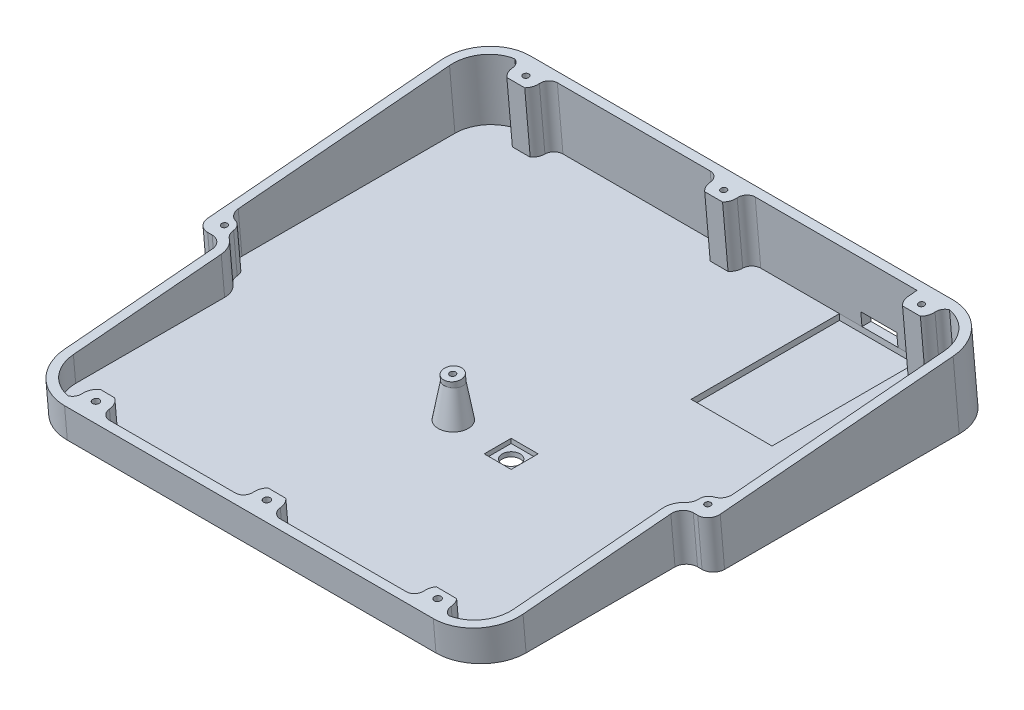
ISO-10303-21;
HEADER;
FILE_DESCRIPTION(('STEP AP214'),'2;1');
FILE_NAME('part.step','',(''),(''),'','','');
FILE_SCHEMA(('AUTOMOTIVE_DESIGN { 1 0 10303 214 1 1 1 1 }'));
ENDSEC;
DATA;
#1=APPLICATION_CONTEXT('core data for automotive mechanical design processes');
#2=APPLICATION_PROTOCOL_DEFINITION('international standard','automotive_design',2000,#1);
#3=PRODUCT_CONTEXT('',#1,'mechanical');
#4=PRODUCT('Part','Part','',(#3));
#5=PRODUCT_RELATED_PRODUCT_CATEGORY('part','',(#4));
#6=PRODUCT_DEFINITION_FORMATION('','',#4);
#7=PRODUCT_DEFINITION_CONTEXT('part definition',#1,'design');
#8=PRODUCT_DEFINITION('design','',#6,#7);
#9=PRODUCT_DEFINITION_SHAPE('','',#8);
#10=(LENGTH_UNIT() NAMED_UNIT(*) SI_UNIT(.MILLI.,.METRE.));
#11=(NAMED_UNIT(*) PLANE_ANGLE_UNIT() SI_UNIT($,.RADIAN.));
#12=(NAMED_UNIT(*) SI_UNIT($,.STERADIAN.) SOLID_ANGLE_UNIT());
#13=UNCERTAINTY_MEASURE_WITH_UNIT(LENGTH_MEASURE(1.E-05),#10,'distance_accuracy_value','');
#14=(GEOMETRIC_REPRESENTATION_CONTEXT(3) GLOBAL_UNCERTAINTY_ASSIGNED_CONTEXT((#13)) GLOBAL_UNIT_ASSIGNED_CONTEXT((#10,
#11,#12)) REPRESENTATION_CONTEXT('',''));
#15=CARTESIAN_POINT('',(0.,0.,0.));
#16=DIRECTION('',(0.,0.,1.));
#17=DIRECTION('',(1.,0.,0.));
#18=AXIS2_PLACEMENT_3D('',#15,#16,#17);
#19=CARTESIAN_POINT('',(87.9999999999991,-153.49650383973,-121.841746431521));
#20=DIRECTION('',(0.,-0.0871557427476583,0.996194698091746));
#21=DIRECTION('',(0.,-0.996194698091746,-0.0871557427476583));
#22=AXIS2_PLACEMENT_3D('',#19,#20,#21);
#23=PLANE('',#22);
#24=DIRECTION('',(-1.,0.,0.));
#25=VECTOR('',#24,1.);
#26=CARTESIAN_POINT('',(63.5000000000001,2.,-108.23756512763));
#27=LINE('',#26,#25);
#28=CARTESIAN_POINT('',(68.5000000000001,2.,-108.23756512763));
#29=VERTEX_POINT('',#28);
#30=CARTESIAN_POINT('',(63.5000000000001,2.,-108.23756512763));
#31=VERTEX_POINT('',#30);
#32=EDGE_CURVE('E649',#29,#31,#27,.T.);
#33=ORIENTED_EDGE('',*,*,#32,.F.);
#34=DIRECTION('',(0.,0.996194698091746,0.0871557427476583));
#35=VECTOR('',#34,1.);
#36=CARTESIAN_POINT('',(68.5000000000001,-153.49650383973,-121.841746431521));
#37=LINE('',#36,#35);
#38=CARTESIAN_POINT('',(68.5000000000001,5.,-107.975099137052));
#39=VERTEX_POINT('',#38);
#40=EDGE_CURVE('E613',#29,#39,#37,.T.);
#41=ORIENTED_EDGE('',*,*,#40,.T.);
#42=DIRECTION('',(1.,0.,0.));
#43=VECTOR('',#42,1.);
#44=CARTESIAN_POINT('',(87.9999999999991,5.,-107.975099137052));
#45=LINE('',#44,#43);
#46=CARTESIAN_POINT('',(76.5000000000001,5.00000000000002,-107.975099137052));
#47=VERTEX_POINT('',#46);
#48=EDGE_CURVE('E617',#39,#47,#45,.T.);
#49=ORIENTED_EDGE('',*,*,#48,.T.);
#50=DIRECTION('',(0.,-0.996194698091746,-0.0871557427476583));
#51=VECTOR('',#50,1.);
#52=CARTESIAN_POINT('',(76.5000000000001,-153.49650383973,-121.841746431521));
#53=LINE('',#52,#51);
#54=CARTESIAN_POINT('',(76.5000000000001,2.,-108.23756512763));
#55=VERTEX_POINT('',#54);
#56=EDGE_CURVE('E606',#47,#55,#53,.T.);
#57=ORIENTED_EDGE('',*,*,#56,.T.);
#58=CARTESIAN_POINT('',(81.5000000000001,2.,-108.23756512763));
#59=VERTEX_POINT('',#58);
#60=EDGE_CURVE('E627',#59,#55,#27,.T.);
#61=ORIENTED_EDGE('',*,*,#60,.F.);
#62=DIRECTION('',(-1.,0.,0.));
#63=VECTOR('',#62,1.);
#64=CARTESIAN_POINT('',(87.9999999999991,2.,-108.23756512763));
#65=LINE('',#64,#63);
#66=CARTESIAN_POINT('',(81.9999999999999,2.,-108.23756512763));
#67=VERTEX_POINT('',#66);
#68=EDGE_CURVE('E1111',#67,#59,#65,.T.);
#69=ORIENTED_EDGE('',*,*,#68,.F.);
#70=DIRECTION('',(0.,0.996194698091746,0.0871557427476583));
#71=VECTOR('',#70,1.);
#72=CARTESIAN_POINT('',(81.9999999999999,-8.65977740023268,-109.17017480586));
#73=LINE('',#72,#71);
#74=CARTESIAN_POINT('',(82.0000000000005,16.3596473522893,-106.981258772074));
#75=VERTEX_POINT('',#74);
#76=EDGE_CURVE('E934',#67,#75,#73,.T.);
#77=ORIENTED_EDGE('',*,*,#76,.T.);
#78=DIRECTION('',(1.,0.,0.));
#79=VECTOR('',#78,1.);
#80=CARTESIAN_POINT('',(82.0000000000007,16.3596473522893,-106.981258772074));
#81=LINE('',#80,#79);
#82=CARTESIAN_POINT('',(46.0000000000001,16.3596473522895,-106.981258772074));
#83=VERTEX_POINT('',#82);
#84=EDGE_CURVE('E1167',#83,#75,#81,.T.);
#85=ORIENTED_EDGE('',*,*,#84,.F.);
#86=DIRECTION('',(0.,0.996194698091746,0.0871557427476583));
#87=VECTOR('',#86,1.);
#88=CARTESIAN_POINT('',(45.9999999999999,-8.65977740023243,-109.17017480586));
#89=LINE('',#88,#87);
#90=CARTESIAN_POINT('',(46.0000000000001,2.,-108.23756512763));
#91=VERTEX_POINT('',#90);
#92=EDGE_CURVE('E1063',#91,#83,#89,.T.);
#93=ORIENTED_EDGE('',*,*,#92,.F.);
#94=EDGE_CURVE('E1116',#31,#91,#65,.T.);
#95=ORIENTED_EDGE('',*,*,#94,.F.);
#96=EDGE_LOOP('',(#33,#41,#49,#57,#61,#69,#77,#85,#93,#95));
#97=FACE_BOUND('',#96,.T.);
#98=ADVANCED_FACE('F41',(#97),#23,.T.);
#99=CARTESIAN_POINT('',(87.9999999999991,-153.322192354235,-123.834135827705));
#100=DIRECTION('',(0.,-0.0871557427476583,0.996194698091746));
#101=DIRECTION('',(0.,-0.996194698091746,-0.0871557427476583));
#102=AXIS2_PLACEMENT_3D('',#99,#100,#101);
#103=PLANE('',#102);
#104=DIRECTION('',(0.,0.996194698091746,0.0871557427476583));
#105=VECTOR('',#104,1.);
#106=CARTESIAN_POINT('',(87.9999999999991,-153.322192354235,-123.834135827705));
#107=LINE('',#106,#105);
#108=CARTESIAN_POINT('',(88.0000000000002,0.,-110.420182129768));
#109=VERTEX_POINT('',#108);
#110=CARTESIAN_POINT('',(88.0000000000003,16.5339588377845,-108.973648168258));
#111=VERTEX_POINT('',#110);
#112=EDGE_CURVE('E1336',#109,#111,#107,.T.);
#113=ORIENTED_EDGE('',*,*,#112,.F.);
#114=DIRECTION('',(-1.,0.,0.));
#115=VECTOR('',#114,1.);
#116=CARTESIAN_POINT('',(87.9999999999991,0.,-110.420182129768));
#117=LINE('',#116,#115);
#118=CARTESIAN_POINT('',(-6.00000000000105,0.,-110.420182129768));
#119=VERTEX_POINT('',#118);
#120=EDGE_CURVE('E1214',#109,#119,#117,.T.);
#121=ORIENTED_EDGE('',*,*,#120,.T.);
#122=DIRECTION('',(0.,0.996194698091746,0.0871557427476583));
#123=VECTOR('',#122,1.);
#124=CARTESIAN_POINT('',(-6.00000000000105,-153.322192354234,-123.834135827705));
#125=LINE('',#124,#123);
#126=CARTESIAN_POINT('',(-5.99999999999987,16.5339588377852,-108.973648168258));
#127=VERTEX_POINT('',#126);
#128=EDGE_CURVE('E1339',#119,#127,#125,.T.);
#129=ORIENTED_EDGE('',*,*,#128,.T.);
#130=DIRECTION('',(1.,0.,0.));
#131=VECTOR('',#130,1.);
#132=CARTESIAN_POINT('',(88.0000000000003,16.5339588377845,-108.973648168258));
#133=LINE('',#132,#131);
#134=EDGE_CURVE('E1290',#127,#111,#133,.T.);
#135=ORIENTED_EDGE('',*,*,#134,.T.);
#136=EDGE_LOOP('',(#113,#121,#129,#135));
#137=FACE_BOUND('',#136,.T.);
#138=DIRECTION('',(0.,0.996194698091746,0.0871557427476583));
#139=VECTOR('',#138,1.);
#140=CARTESIAN_POINT('',(68.5000000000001,-153.322192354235,-123.834135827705));
#141=LINE('',#140,#139);
#142=CARTESIAN_POINT('',(68.5000000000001,2.,-110.245204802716));
#143=VERTEX_POINT('',#142);
#144=CARTESIAN_POINT('',(68.5000000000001,5.,-109.982738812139));
#145=VERTEX_POINT('',#144);
#146=EDGE_CURVE('E610',#143,#145,#141,.T.);
#147=ORIENTED_EDGE('',*,*,#146,.F.);
#148=DIRECTION('',(-1.,0.,0.));
#149=VECTOR('',#148,1.);
#150=CARTESIAN_POINT('',(87.9999999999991,2.,-110.245204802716));
#151=LINE('',#150,#149);
#152=CARTESIAN_POINT('',(76.5000000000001,2.,-110.245204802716));
#153=VERTEX_POINT('',#152);
#154=EDGE_CURVE('E600',#153,#143,#151,.T.);
#155=ORIENTED_EDGE('',*,*,#154,.F.);
#156=DIRECTION('',(0.,-0.996194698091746,-0.0871557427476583));
#157=VECTOR('',#156,1.);
#158=CARTESIAN_POINT('',(76.5000000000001,-153.322192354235,-123.834135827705));
#159=LINE('',#158,#157);
#160=CARTESIAN_POINT('',(76.5000000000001,5.00000000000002,-109.982738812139));
#161=VERTEX_POINT('',#160);
#162=EDGE_CURVE('E603',#161,#153,#159,.T.);
#163=ORIENTED_EDGE('',*,*,#162,.F.);
#164=DIRECTION('',(1.,0.,0.));
#165=VECTOR('',#164,1.);
#166=CARTESIAN_POINT('',(87.9999999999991,5.,-109.982738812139));
#167=LINE('',#166,#165);
#168=EDGE_CURVE('E11',#145,#161,#167,.T.);
#169=ORIENTED_EDGE('',*,*,#168,.F.);
#170=EDGE_LOOP('',(#147,#155,#163,#169));
#171=FACE_BOUND('',#170,.T.);
#172=ADVANCED_FACE('F1574',(#137,#171),#103,.F.);
#173=CARTESIAN_POINT('',(81.999999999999,-162.735012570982,-16.2451084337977));
#174=DIRECTION('',(0.,0.0871557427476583,-0.996194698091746));
#175=DIRECTION('',(0.,0.996194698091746,0.0871557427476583));
#176=AXIS2_PLACEMENT_3D('',#173,#174,#175);
#177=PLANE('',#176);
#178=DIRECTION('',(-1.,0.,0.));
#179=VECTOR('',#178,1.);
#180=CARTESIAN_POINT('',(82.0000000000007,7.12113862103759,-1.38462077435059));
#181=LINE('',#180,#179);
#182=CARTESIAN_POINT('',(74.0000000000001,7.12113862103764,-1.38462077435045));
#183=VERTEX_POINT('',#182);
#184=CARTESIAN_POINT('',(46.0000000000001,7.12113862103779,-1.38462077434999));
#185=VERTEX_POINT('',#184);
#186=EDGE_CURVE('E1186',#183,#185,#181,.T.);
#187=ORIENTED_EDGE('',*,*,#186,.F.);
#188=DIRECTION('',(0.,0.996194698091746,0.0871557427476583));
#189=VECTOR('',#188,1.);
#190=CARTESIAN_POINT('',(73.9999999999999,-17.8982861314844,-3.57353680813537));
#191=LINE('',#190,#189);
#192=CARTESIAN_POINT('',(74.,2.,-1.83266234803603));
#193=VERTEX_POINT('',#192);
#194=EDGE_CURVE('E733',#193,#183,#191,.T.);
#195=ORIENTED_EDGE('',*,*,#194,.F.);
#196=DIRECTION('',(1.,0.,0.));
#197=VECTOR('',#196,1.);
#198=CARTESIAN_POINT('',(81.9999999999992,2.,-1.83266234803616));
#199=LINE('',#198,#197);
#200=CARTESIAN_POINT('',(46.0000000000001,2.,-1.83266234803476));
#201=VERTEX_POINT('',#200);
#202=EDGE_CURVE('E1143',#201,#193,#199,.T.);
#203=ORIENTED_EDGE('',*,*,#202,.F.);
#204=DIRECTION('',(0.,0.996194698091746,0.0871557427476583));
#205=VECTOR('',#204,1.);
#206=CARTESIAN_POINT('',(45.9999999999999,-17.8982861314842,-3.57353680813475));
#207=LINE('',#206,#205);
#208=EDGE_CURVE('E871',#201,#185,#207,.T.);
#209=ORIENTED_EDGE('',*,*,#208,.T.);
#210=EDGE_LOOP('',(#187,#195,#203,#209));
#211=FACE_BOUND('',#210,.T.);
#212=ADVANCED_FACE('F1571',(#211),#177,.T.);
#213=DIRECTION('',(0.,0.996194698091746,0.0871557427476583));
#214=VECTOR('',#213,1.);
#215=CARTESIAN_POINT('',(7.99999999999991,-17.898286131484,-3.57353680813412));
#216=LINE('',#215,#214);
#217=CARTESIAN_POINT('',(8.00000000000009,2.,-1.83266234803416));
#218=VERTEX_POINT('',#217);
#219=CARTESIAN_POINT('',(8.00000000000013,7.121138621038,-1.38462077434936));
#220=VERTEX_POINT('',#219);
#221=EDGE_CURVE('E809',#218,#220,#216,.T.);
#222=ORIENTED_EDGE('',*,*,#221,.T.);
#223=CARTESIAN_POINT('',(36.0000000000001,7.12113862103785,-1.38462077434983));
#224=VERTEX_POINT('',#223);
#225=EDGE_CURVE('E1189',#224,#220,#181,.T.);
#226=ORIENTED_EDGE('',*,*,#225,.F.);
#227=DIRECTION('',(0.,0.996194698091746,0.0871557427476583));
#228=VECTOR('',#227,1.);
#229=CARTESIAN_POINT('',(35.9999999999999,-17.8982861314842,-3.57353680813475));
#230=LINE('',#229,#228);
#231=CARTESIAN_POINT('',(36.,2.,-1.83266234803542));
#232=VERTEX_POINT('',#231);
#233=EDGE_CURVE('E875',#232,#224,#230,.T.);
#234=ORIENTED_EDGE('',*,*,#233,.F.);
#235=EDGE_CURVE('E1144',#218,#232,#199,.T.);
#236=ORIENTED_EDGE('',*,*,#235,.F.);
#237=EDGE_LOOP('',(#222,#226,#234,#236));
#238=FACE_BOUND('',#237,.T.);
#239=ADVANCED_FACE('F1549',(#238),#177,.T.);
#240=CARTESIAN_POINT('',(2.00000000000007,16.3596473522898,-106.981258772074));
#241=VERTEX_POINT('',#240);
#242=CARTESIAN_POINT('',(36.0000000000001,16.3596473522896,-106.981258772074));
#243=VERTEX_POINT('',#242);
#244=EDGE_CURVE('E1164',#241,#243,#81,.T.);
#245=ORIENTED_EDGE('',*,*,#244,.F.);
#246=DIRECTION('',(0.,0.996194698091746,0.0871557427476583));
#247=VECTOR('',#246,1.);
#248=CARTESIAN_POINT('',(1.9999999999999,-8.65977740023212,-109.17017480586));
#249=LINE('',#248,#247);
#250=CARTESIAN_POINT('',(2.00000000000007,2.,-108.23756512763));
#251=VERTEX_POINT('',#250);
#252=EDGE_CURVE('E965',#251,#241,#249,.T.);
#253=ORIENTED_EDGE('',*,*,#252,.F.);
#254=CARTESIAN_POINT('',(36.,2.,-108.23756512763));
#255=VERTEX_POINT('',#254);
#256=EDGE_CURVE('E1110',#255,#251,#65,.T.);
#257=ORIENTED_EDGE('',*,*,#256,.F.);
#258=DIRECTION('',(0.,0.996194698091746,0.0871557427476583));
#259=VECTOR('',#258,1.);
#260=CARTESIAN_POINT('',(35.9999999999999,-8.65977740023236,-109.17017480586));
#261=LINE('',#260,#259);
#262=EDGE_CURVE('E1028',#255,#243,#261,.T.);
#263=ORIENTED_EDGE('',*,*,#262,.T.);
#264=EDGE_LOOP('',(#245,#253,#257,#263));
#265=FACE_BOUND('',#264,.T.);
#266=ADVANCED_FACE('F1545',(#265),#23,.T.);
#267=CARTESIAN_POINT('',(82.0000000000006,7.81838456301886,-9.35417835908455));
#268=DIRECTION('',(0.,0.996194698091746,0.0871557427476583));
#269=DIRECTION('',(0.,-0.0871557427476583,0.996194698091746));
#270=AXIS2_PLACEMENT_3D('',#267,#268,#269);
#271=PLANE('',#270);
#272=CARTESIAN_POINT('',(-12.5000000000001,10.6945240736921,-42.2286033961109));
#273=DIRECTION('',(0.,0.996194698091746,0.0871557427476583));
#274=DIRECTION('',(0.,-0.0871557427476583,0.996194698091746));
#275=AXIS2_PLACEMENT_3D('',#272,#273,#274);
#276=CIRCLE('',#275,4.50000000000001);
#277=CARTESIAN_POINT('',(-8.00000000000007,10.6945240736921,-42.2286033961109));
#278=VERTEX_POINT('',#277);
#279=CARTESIAN_POINT('',(-9.76813599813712,11.0061825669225,-45.7908762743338));
#280=VERTEX_POINT('',#279);
#281=EDGE_CURVE('E1175',#278,#280,#276,.T.);
#282=ORIENTED_EDGE('',*,*,#281,.T.);
#283=CARTESIAN_POINT('',(-8.25043377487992,11.1793261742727,-47.7699167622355));
#284=DIRECTION('',(0.,0.996194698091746,0.0871557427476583));
#285=DIRECTION('',(0.,-0.0871557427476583,0.996194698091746));
#286=AXIS2_PLACEMENT_3D('',#283,#284,#285);
#287=CIRCLE('',#286,2.5);
#288=CARTESIAN_POINT('',(-10.7501927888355,11.1763008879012,-47.7353375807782));
#289=VERTEX_POINT('',#288);
#290=EDGE_CURVE('E1419',#280,#289,#287,.F.);
#291=ORIENTED_EDGE('',*,*,#290,.T.);
#292=CARTESIAN_POINT('',(-12.7499999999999,11.173880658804,-47.7076742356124));
#293=DIRECTION('',(0.,0.996194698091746,0.0871557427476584));
#294=DIRECTION('',(0.,0.0871557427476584,-0.996194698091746));
#295=AXIS2_PLACEMENT_3D('',#292,#293,#294);
#296=CIRCLE('',#295,2.00000000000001);
#297=CARTESIAN_POINT('',(-12.1944444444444,11.3413321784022,-49.6216538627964));
#298=VERTEX_POINT('',#297);
#299=EDGE_CURVE('E673',#289,#298,#296,.T.);
#300=ORIENTED_EDGE('',*,*,#299,.T.);
#301=CARTESIAN_POINT('',(-11.4999999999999,11.5506465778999,-52.0141283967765));
#302=DIRECTION('',(0.,0.996194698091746,0.0871557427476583));
#303=DIRECTION('',(0.,-0.0871557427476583,0.996194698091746));
#304=AXIS2_PLACEMENT_3D('',#301,#302,#303);
#305=CIRCLE('',#304,2.5);
#306=CARTESIAN_POINT('',(-13.9999999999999,11.5506465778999,-52.0141283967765));
#307=VERTEX_POINT('',#306);
#308=EDGE_CURVE('E1416',#298,#307,#305,.F.);
#309=ORIENTED_EDGE('',*,*,#308,.T.);
#310=DIRECTION('',(0.,0.0871557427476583,-0.996194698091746));
#311=VECTOR('',#310,1.);
#312=CARTESIAN_POINT('',(-13.9999999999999,7.81838456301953,-9.35417835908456));
#313=LINE('',#312,#311);
#314=CARTESIAN_POINT('',(-13.9999999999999,15.6624014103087,-99.0117011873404));
#315=VERTEX_POINT('',#314);
#316=EDGE_CURVE('E1172',#307,#315,#313,.T.);
#317=ORIENTED_EDGE('',*,*,#316,.T.);
#318=CARTESIAN_POINT('',(-5.99999999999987,15.6624014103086,-99.0117011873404));
#319=DIRECTION('',(0.,0.996194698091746,0.0871557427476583));
#320=DIRECTION('',(0.,-0.0871557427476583,0.996194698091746));
#321=AXIS2_PLACEMENT_3D('',#318,#319,#320);
#322=CIRCLE('',#321,8.00000000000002);
#323=CARTESIAN_POINT('',(-7.33810499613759,16.3498247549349,-106.868985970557));
#324=VERTEX_POINT('',#323);
#325=EDGE_CURVE('E1168',#315,#324,#322,.F.);
#326=ORIENTED_EDGE('',*,*,#325,.T.);
#327=CARTESIAN_POINT('',(-7.99999999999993,16.1853358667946,-104.988869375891));
#328=DIRECTION('',(0.,-0.996194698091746,-0.0871557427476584));
#329=DIRECTION('',(0.,-0.0871557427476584,0.996194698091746));
#330=AXIS2_PLACEMENT_3D('',#327,#328,#329);
#331=CIRCLE('',#330,2.00000000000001);
#332=CARTESIAN_POINT('',(-5.99999999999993,16.1853358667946,-104.988869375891));
#333=VERTEX_POINT('',#332);
#334=EDGE_CURVE('E976',#324,#333,#331,.T.);
#335=ORIENTED_EDGE('',*,*,#334,.T.);
#336=CARTESIAN_POINT('',(-2.99999999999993,16.1853358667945,-104.988869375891));
#337=DIRECTION('',(0.,0.996194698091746,0.0871557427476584));
#338=DIRECTION('',(0.,-0.0871557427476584,0.996194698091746));
#339=AXIS2_PLACEMENT_3D('',#336,#337,#338);
#340=CIRCLE('',#339,3.);
#341=CARTESIAN_POINT('',(-4.98431348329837,15.9892354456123,-102.747431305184));
#342=VERTEX_POINT('',#341);
#343=EDGE_CURVE('E979',#333,#342,#340,.T.);
#344=ORIENTED_EDGE('',*,*,#343,.T.);
#345=DIRECTION('',(1.,0.,0.));
#346=VECTOR('',#345,1.);
#347=CARTESIAN_POINT('',(-1.01568651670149,15.9892354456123,-102.747431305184));
#348=LINE('',#347,#346);
#349=CARTESIAN_POINT('',(-1.01568651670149,15.9892354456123,-102.747431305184));
#350=VERTEX_POINT('',#349);
#351=EDGE_CURVE('E983',#342,#350,#348,.T.);
#352=ORIENTED_EDGE('',*,*,#351,.T.);
#353=CARTESIAN_POINT('',(-2.99999999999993,16.1853358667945,-104.988869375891));
#354=DIRECTION('',(0.,0.996194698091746,0.0871557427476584));
#355=DIRECTION('',(0.,-0.0871557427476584,0.996194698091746));
#356=AXIS2_PLACEMENT_3D('',#353,#354,#355);
#357=CIRCLE('',#356,3.);
#358=CARTESIAN_POINT('',(0.,16.1853358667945,-104.988869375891));
#359=VERTEX_POINT('',#358);
#360=EDGE_CURVE('E987',#350,#359,#357,.T.);
#361=ORIENTED_EDGE('',*,*,#360,.T.);
#362=CARTESIAN_POINT('',(2.00000000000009,16.1853358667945,-104.988869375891));
#363=DIRECTION('',(0.,-0.996194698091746,-0.0871557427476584));
#364=DIRECTION('',(0.,0.0871557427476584,-0.996194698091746));
#365=AXIS2_PLACEMENT_3D('',#362,#363,#364);
#366=CIRCLE('',#365,2.00000000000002);
#367=EDGE_CURVE('E991',#359,#241,#366,.T.);
#368=ORIENTED_EDGE('',*,*,#367,.T.);
#369=ORIENTED_EDGE('',*,*,#244,.T.);
#370=CARTESIAN_POINT('',(36.0000000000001,16.1853358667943,-104.988869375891));
#371=DIRECTION('',(0.,-0.996194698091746,-0.0871557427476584));
#372=DIRECTION('',(0.,-0.0871557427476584,0.996194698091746));
#373=AXIS2_PLACEMENT_3D('',#370,#371,#372);
#374=CIRCLE('',#373,2.00000000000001);
#375=CARTESIAN_POINT('',(38.0000000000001,16.1853358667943,-104.988869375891));
#376=VERTEX_POINT('',#375);
#377=EDGE_CURVE('E1039',#243,#376,#374,.T.);
#378=ORIENTED_EDGE('',*,*,#377,.T.);
#379=CARTESIAN_POINT('',(41.0000000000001,16.1853358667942,-104.988869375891));
#380=DIRECTION('',(0.,0.996194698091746,0.0871557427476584));
#381=DIRECTION('',(0.,-0.0871557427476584,0.996194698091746));
#382=AXIS2_PLACEMENT_3D('',#379,#380,#381);
#383=CIRCLE('',#382,3.);
#384=CARTESIAN_POINT('',(39.0156865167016,15.989235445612,-102.747431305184));
#385=VERTEX_POINT('',#384);
#386=EDGE_CURVE('E1043',#376,#385,#383,.T.);
#387=ORIENTED_EDGE('',*,*,#386,.T.);
#388=DIRECTION('',(1.,0.,0.));
#389=VECTOR('',#388,1.);
#390=CARTESIAN_POINT('',(42.9843134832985,15.989235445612,-102.747431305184));
#391=LINE('',#390,#389);
#392=CARTESIAN_POINT('',(42.9843134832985,15.989235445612,-102.747431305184));
#393=VERTEX_POINT('',#392);
#394=EDGE_CURVE('E1047',#385,#393,#391,.T.);
#395=ORIENTED_EDGE('',*,*,#394,.T.);
#396=CARTESIAN_POINT('',(41.0000000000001,16.1853358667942,-104.988869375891));
#397=DIRECTION('',(0.,0.996194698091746,0.0871557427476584));
#398=DIRECTION('',(0.,-0.0871557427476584,0.996194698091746));
#399=AXIS2_PLACEMENT_3D('',#396,#397,#398);
#400=CIRCLE('',#399,3.);
#401=CARTESIAN_POINT('',(44.0000000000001,16.1853358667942,-104.988869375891));
#402=VERTEX_POINT('',#401);
#403=EDGE_CURVE('E1051',#393,#402,#400,.T.);
#404=ORIENTED_EDGE('',*,*,#403,.T.);
#405=CARTESIAN_POINT('',(46.0000000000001,16.1853358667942,-104.988869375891));
#406=DIRECTION('',(0.,-0.996194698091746,-0.0871557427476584));
#407=DIRECTION('',(0.,0.0871557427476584,-0.996194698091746));
#408=AXIS2_PLACEMENT_3D('',#405,#406,#407);
#409=CIRCLE('',#408,2.00000000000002);
#410=EDGE_CURVE('E1055',#402,#83,#409,.T.);
#411=ORIENTED_EDGE('',*,*,#410,.T.);
#412=ORIENTED_EDGE('',*,*,#84,.T.);
#413=DIRECTION('',(0.,-0.0871557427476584,0.996194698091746));
#414=VECTOR('',#413,1.);
#415=CARTESIAN_POINT('',(82.0000000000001,16.185335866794,-104.988869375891));
#416=LINE('',#415,#414);
#417=CARTESIAN_POINT('',(82.0000000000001,16.185335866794,-104.988869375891));
#418=VERTEX_POINT('',#417);
#419=EDGE_CURVE('E918',#75,#418,#416,.T.);
#420=ORIENTED_EDGE('',*,*,#419,.T.);
#421=CARTESIAN_POINT('',(85.0000000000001,16.1853358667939,-104.988869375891));
#422=DIRECTION('',(0.,0.996194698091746,0.0871557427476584));
#423=DIRECTION('',(0.,-0.0871557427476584,0.996194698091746));
#424=AXIS2_PLACEMENT_3D('',#421,#422,#423);
#425=CIRCLE('',#424,3.);
#426=CARTESIAN_POINT('',(83.0156865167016,15.9892354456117,-102.747431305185));
#427=VERTEX_POINT('',#426);
#428=EDGE_CURVE('E922',#418,#427,#425,.T.);
#429=ORIENTED_EDGE('',*,*,#428,.T.);
#430=DIRECTION('',(1.,0.,0.));
#431=VECTOR('',#430,1.);
#432=CARTESIAN_POINT('',(86.9843134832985,15.9892354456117,-102.747431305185));
#433=LINE('',#432,#431);
#434=CARTESIAN_POINT('',(86.9843134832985,15.9892354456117,-102.747431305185));
#435=VERTEX_POINT('',#434);
#436=EDGE_CURVE('E926',#427,#435,#433,.T.);
#437=ORIENTED_EDGE('',*,*,#436,.T.);
#438=CARTESIAN_POINT('',(85.0000000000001,16.1853358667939,-104.988869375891));
#439=DIRECTION('',(0.,0.996194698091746,0.0871557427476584));
#440=DIRECTION('',(0.,-0.0871557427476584,0.996194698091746));
#441=AXIS2_PLACEMENT_3D('',#438,#439,#440);
#442=CIRCLE('',#441,3.);
#443=CARTESIAN_POINT('',(88.0000000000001,16.1853358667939,-104.988869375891));
#444=VERTEX_POINT('',#443);
#445=EDGE_CURVE('E930',#435,#444,#442,.T.);
#446=ORIENTED_EDGE('',*,*,#445,.T.);
#447=CARTESIAN_POINT('',(90.0000000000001,16.1853358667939,-104.988869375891));
#448=DIRECTION('',(0.,-0.996194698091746,-0.0871557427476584));
#449=DIRECTION('',(0.,0.0871557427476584,-0.996194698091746));
#450=AXIS2_PLACEMENT_3D('',#447,#448,#449);
#451=CIRCLE('',#450,2.00000000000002);
#452=CARTESIAN_POINT('',(89.3381049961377,16.3498247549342,-106.868985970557));
#453=VERTEX_POINT('',#452);
#454=EDGE_CURVE('E914',#444,#453,#451,.T.);
#455=ORIENTED_EDGE('',*,*,#454,.T.);
#456=CARTESIAN_POINT('',(88.0000000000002,15.6624014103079,-99.0117011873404));
#457=DIRECTION('',(0.,0.996194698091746,0.0871557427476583));
#458=DIRECTION('',(0.,-0.0871557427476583,0.996194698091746));
#459=AXIS2_PLACEMENT_3D('',#456,#457,#458);
#460=CIRCLE('',#459,7.99999999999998);
#461=CARTESIAN_POINT('',(96.0000000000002,15.6624014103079,-99.0117011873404));
#462=VERTEX_POINT('',#461);
#463=EDGE_CURVE('E1161',#453,#462,#460,.F.);
#464=ORIENTED_EDGE('',*,*,#463,.T.);
#465=DIRECTION('',(0.,-0.0871557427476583,0.996194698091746));
#466=VECTOR('',#465,1.);
#467=CARTESIAN_POINT('',(96.0000000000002,7.81838456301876,-9.35417835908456));
#468=LINE('',#467,#466);
#469=CARTESIAN_POINT('',(96.0000000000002,11.5506465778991,-52.0141283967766));
#470=VERTEX_POINT('',#469);
#471=EDGE_CURVE('E1157',#462,#470,#468,.T.);
#472=ORIENTED_EDGE('',*,*,#471,.T.);
#473=CARTESIAN_POINT('',(93.5000000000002,11.5506465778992,-52.0141283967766));
#474=DIRECTION('',(0.,0.996194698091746,0.0871557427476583));
#475=DIRECTION('',(0.,-0.0871557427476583,0.996194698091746));
#476=AXIS2_PLACEMENT_3D('',#473,#474,#475);
#477=CIRCLE('',#476,2.5);
#478=CARTESIAN_POINT('',(94.1944444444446,11.3413321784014,-49.6216538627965));
#479=VERTEX_POINT('',#478);
#480=EDGE_CURVE('E1422',#470,#479,#477,.F.);
#481=ORIENTED_EDGE('',*,*,#480,.T.);
#482=CARTESIAN_POINT('',(94.7500000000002,11.1738806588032,-47.7076742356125));
#483=DIRECTION('',(0.,0.996194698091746,0.0871557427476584));
#484=DIRECTION('',(0.,-0.0871557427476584,0.996194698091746));
#485=AXIS2_PLACEMENT_3D('',#482,#483,#484);
#486=CIRCLE('',#485,2.00000000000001);
#487=CARTESIAN_POINT('',(92.7501927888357,11.1763008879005,-47.7353375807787));
#488=VERTEX_POINT('',#487);
#489=EDGE_CURVE('E752',#479,#488,#486,.T.);
#490=ORIENTED_EDGE('',*,*,#489,.T.);
#491=CARTESIAN_POINT('',(90.2504337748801,11.1793261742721,-47.7699167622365));
#492=DIRECTION('',(0.,0.996194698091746,0.0871557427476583));
#493=DIRECTION('',(0.,-0.0871557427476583,0.996194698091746));
#494=AXIS2_PLACEMENT_3D('',#491,#492,#493);
#495=CIRCLE('',#494,2.5);
#496=CARTESIAN_POINT('',(91.7681359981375,11.0061825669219,-45.7908762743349));
#497=VERTEX_POINT('',#496);
#498=EDGE_CURVE('E1425',#488,#497,#495,.F.);
#499=ORIENTED_EDGE('',*,*,#498,.T.);
#500=CARTESIAN_POINT('',(94.5000000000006,10.6945240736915,-42.2286033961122));
#501=DIRECTION('',(0.,0.996194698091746,0.0871557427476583));
#502=DIRECTION('',(0.,-0.0871557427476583,0.996194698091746));
#503=AXIS2_PLACEMENT_3D('',#500,#501,#502);
#504=CIRCLE('',#503,4.5);
#505=CARTESIAN_POINT('',(90.0000000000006,10.6945240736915,-42.2286033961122));
#506=VERTEX_POINT('',#505);
#507=EDGE_CURVE('E1154',#497,#506,#504,.T.);
#508=ORIENTED_EDGE('',*,*,#507,.T.);
#509=DIRECTION('',(0.,-0.0871557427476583,0.996194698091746));
#510=VECTOR('',#509,1.);
#511=CARTESIAN_POINT('',(90.0000000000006,7.8183845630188,-9.35417835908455));
#512=LINE('',#511,#510);
#513=CARTESIAN_POINT('',(90.0000000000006,7.81838456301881,-9.35417835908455));
#514=VERTEX_POINT('',#513);
#515=EDGE_CURVE('E1086',#506,#514,#512,.T.);
#516=ORIENTED_EDGE('',*,*,#515,.T.);
#517=CARTESIAN_POINT('',(82.0000000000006,7.81838456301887,-9.35417835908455));
#518=DIRECTION('',(0.,0.996194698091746,0.0871557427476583));
#519=DIRECTION('',(0.,-0.0871557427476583,0.996194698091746));
#520=AXIS2_PLACEMENT_3D('',#517,#518,#519);
#521=CIRCLE('',#520,8.);
#522=CARTESIAN_POINT('',(83.3381049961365,7.13096121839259,-1.4968935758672));
#523=VERTEX_POINT('',#522);
#524=EDGE_CURVE('E1081',#514,#523,#521,.F.);
#525=ORIENTED_EDGE('',*,*,#524,.T.);
#526=CARTESIAN_POINT('',(84.0000000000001,7.29545010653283,-3.37701017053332));
#527=DIRECTION('',(0.,-0.996194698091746,-0.0871557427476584));
#528=DIRECTION('',(0.,-0.0871557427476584,0.996194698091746));
#529=AXIS2_PLACEMENT_3D('',#526,#527,#528);
#530=CIRCLE('',#529,2.00000000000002);
#531=CARTESIAN_POINT('',(82.0000000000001,7.29545010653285,-3.37701017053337));
#532=VERTEX_POINT('',#531);
#533=EDGE_CURVE('E712',#523,#532,#530,.T.);
#534=ORIENTED_EDGE('',*,*,#533,.T.);
#535=CARTESIAN_POINT('',(79.0000000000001,7.29545010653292,-3.37701017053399));
#536=DIRECTION('',(0.,0.996194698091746,0.0871557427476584));
#537=DIRECTION('',(0.,0.0871557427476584,-0.996194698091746));
#538=AXIS2_PLACEMENT_3D('',#535,#536,#537);
#539=CIRCLE('',#538,2.9999999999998);
#540=CARTESIAN_POINT('',(81.2963179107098,7.46370638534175,-5.30018823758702));
#541=VERTEX_POINT('',#540);
#542=EDGE_CURVE('E715',#532,#541,#539,.T.);
#543=ORIENTED_EDGE('',*,*,#542,.T.);
#544=DIRECTION('',(-0.999968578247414,0.000690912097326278,-0.00789716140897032));
#545=VECTOR('',#544,1.);
#546=CARTESIAN_POINT('',(76.7345775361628,7.46685824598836,-5.33621416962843));
#547=LINE('',#546,#545);
#548=CARTESIAN_POINT('',(76.7345775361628,7.46685824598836,-5.33621416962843));
#549=VERTEX_POINT('',#548);
#550=EDGE_CURVE('E719',#541,#549,#547,.T.);
#551=ORIENTED_EDGE('',*,*,#550,.T.);
#552=CARTESIAN_POINT('',(79.0000000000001,7.29545010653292,-3.37701017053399));
#553=DIRECTION('',(0.,0.996194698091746,0.0871557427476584));
#554=DIRECTION('',(0.,0.0871557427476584,-0.996194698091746));
#555=AXIS2_PLACEMENT_3D('',#552,#553,#554);
#556=CIRCLE('',#555,2.99999999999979);
#557=CARTESIAN_POINT('',(76.0000000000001,7.29545010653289,-3.37701017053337));
#558=VERTEX_POINT('',#557);
#559=EDGE_CURVE('E704',#549,#558,#556,.T.);
#560=ORIENTED_EDGE('',*,*,#559,.T.);
#561=CARTESIAN_POINT('',(74.0000000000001,7.2954501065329,-3.3770101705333));
#562=DIRECTION('',(0.,-0.996194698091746,-0.0871557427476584));
#563=DIRECTION('',(0.,0.0871557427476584,-0.996194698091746));
#564=AXIS2_PLACEMENT_3D('',#561,#562,#563);
#565=CIRCLE('',#564,2.00000000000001);
#566=EDGE_CURVE('E708',#558,#183,#565,.T.);
#567=ORIENTED_EDGE('',*,*,#566,.T.);
#568=ORIENTED_EDGE('',*,*,#186,.T.);
#569=CARTESIAN_POINT('',(46.0000000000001,7.29545010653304,-3.37701017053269));
#570=DIRECTION('',(0.,-0.996194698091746,-0.0871557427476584));
#571=DIRECTION('',(0.,-0.0871557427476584,0.996194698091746));
#572=AXIS2_PLACEMENT_3D('',#569,#570,#571);
#573=CIRCLE('',#572,2.00000000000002);
#574=CARTESIAN_POINT('',(44.0000000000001,7.29545010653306,-3.37701017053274));
#575=VERTEX_POINT('',#574);
#576=EDGE_CURVE('E850',#185,#575,#573,.T.);
#577=ORIENTED_EDGE('',*,*,#576,.T.);
#578=CARTESIAN_POINT('',(41.0000000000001,7.29545010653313,-3.37701017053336));
#579=DIRECTION('',(0.,0.996194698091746,0.0871557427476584));
#580=DIRECTION('',(0.,0.0871557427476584,-0.996194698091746));
#581=AXIS2_PLACEMENT_3D('',#578,#579,#580);
#582=CIRCLE('',#581,2.99999999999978);
#583=CARTESIAN_POINT('',(43.0021937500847,7.49016509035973,-5.60261261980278));
#584=VERTEX_POINT('',#583);
#585=EDGE_CURVE('E854',#575,#584,#582,.T.);
#586=ORIENTED_EDGE('',*,*,#585,.T.);
#587=DIRECTION('',(-0.999968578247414,0.000690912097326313,-0.00789716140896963));
#588=VECTOR('',#587,1.);
#589=CARTESIAN_POINT('',(39.0334777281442,7.49290721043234,-5.6339551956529));
#590=LINE('',#589,#588);
#591=CARTESIAN_POINT('',(39.0334777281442,7.49290721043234,-5.6339551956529));
#592=VERTEX_POINT('',#591);
#593=EDGE_CURVE('E858',#584,#592,#590,.T.);
#594=ORIENTED_EDGE('',*,*,#593,.T.);
#595=CARTESIAN_POINT('',(41.0000000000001,7.29545010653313,-3.37701017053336));
#596=DIRECTION('',(0.,0.996194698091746,0.0871557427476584));
#597=DIRECTION('',(0.,0.0871557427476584,-0.996194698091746));
#598=AXIS2_PLACEMENT_3D('',#595,#596,#597);
#599=CIRCLE('',#598,2.99999999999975);
#600=CARTESIAN_POINT('',(38.0000000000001,7.2954501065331,-3.37701017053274));
#601=VERTEX_POINT('',#600);
#602=EDGE_CURVE('E842',#592,#601,#599,.T.);
#603=ORIENTED_EDGE('',*,*,#602,.T.);
#604=CARTESIAN_POINT('',(36.0000000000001,7.29545010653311,-3.37701017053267));
#605=DIRECTION('',(0.,-0.996194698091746,-0.0871557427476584));
#606=DIRECTION('',(0.,0.0871557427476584,-0.996194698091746));
#607=AXIS2_PLACEMENT_3D('',#604,#605,#606);
#608=CIRCLE('',#607,2.);
#609=EDGE_CURVE('E846',#601,#224,#608,.T.);
#610=ORIENTED_EDGE('',*,*,#609,.T.);
#611=ORIENTED_EDGE('',*,*,#225,.T.);
#612=CARTESIAN_POINT('',(8.0000000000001,7.29545010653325,-3.37701017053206));
#613=DIRECTION('',(0.,-0.996194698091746,-0.0871557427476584));
#614=DIRECTION('',(0.,-0.0871557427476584,0.996194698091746));
#615=AXIS2_PLACEMENT_3D('',#612,#613,#614);
#616=CIRCLE('',#615,2.00000000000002);
#617=CARTESIAN_POINT('',(6.00000000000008,7.29545010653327,-3.37701017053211));
#618=VERTEX_POINT('',#617);
#619=EDGE_CURVE('E788',#220,#618,#616,.T.);
#620=ORIENTED_EDGE('',*,*,#619,.T.);
#621=CARTESIAN_POINT('',(3.00000000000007,7.29545010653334,-3.37701017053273));
#622=DIRECTION('',(0.,0.996194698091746,0.0871557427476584));
#623=DIRECTION('',(0.,0.0871557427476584,-0.996194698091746));
#624=AXIS2_PLACEMENT_3D('',#621,#622,#623);
#625=CIRCLE('',#624,3.);
#626=CARTESIAN_POINT('',(4.59867452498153,7.51669938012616,-5.90590093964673));
#627=VERTEX_POINT('',#626);
#628=EDGE_CURVE('E792',#618,#627,#625,.T.);
#629=ORIENTED_EDGE('',*,*,#628,.T.);
#630=DIRECTION('',(-0.999968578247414,0.000690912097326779,-0.00789716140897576));
#631=VECTOR('',#630,1.);
#632=CARTESIAN_POINT('',(1.44177298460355,7.51888059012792,-5.93083228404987));
#633=LINE('',#632,#631);
#634=CARTESIAN_POINT('',(1.44177298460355,7.51888059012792,-5.93083228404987));
#635=VERTEX_POINT('',#634);
#636=EDGE_CURVE('E796',#627,#635,#633,.T.);
#637=ORIENTED_EDGE('',*,*,#636,.T.);
#638=CARTESIAN_POINT('',(3.00000000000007,7.29545010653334,-3.37701017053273));
#639=DIRECTION('',(0.,0.996194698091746,0.0871557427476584));
#640=DIRECTION('',(0.,0.0871557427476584,-0.996194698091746));
#641=AXIS2_PLACEMENT_3D('',#638,#639,#640);
#642=CIRCLE('',#641,2.99999999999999);
#643=CARTESIAN_POINT('',(0.,7.29545010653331,-3.37701017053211));
#644=VERTEX_POINT('',#643);
#645=EDGE_CURVE('E780',#635,#644,#642,.T.);
#646=ORIENTED_EDGE('',*,*,#645,.T.);
#647=CARTESIAN_POINT('',(-1.99999999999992,7.29545010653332,-3.37701017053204));
#648=DIRECTION('',(0.,-0.996194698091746,-0.0871557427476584));
#649=DIRECTION('',(0.,0.0871557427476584,-0.996194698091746));
#650=AXIS2_PLACEMENT_3D('',#647,#648,#649);
#651=CIRCLE('',#650,2.);
#652=CARTESIAN_POINT('',(-1.33810499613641,7.13096121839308,-1.49689357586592));
#653=VERTEX_POINT('',#652);
#654=EDGE_CURVE('E784',#644,#653,#651,.T.);
#655=ORIENTED_EDGE('',*,*,#654,.T.);
#656=CARTESIAN_POINT('',(0.,7.81838456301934,-9.35417835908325));
#657=DIRECTION('',(0.,0.996194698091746,0.0871557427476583));
#658=DIRECTION('',(0.,-0.0871557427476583,0.996194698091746));
#659=AXIS2_PLACEMENT_3D('',#656,#657,#658);
#660=CIRCLE('',#659,8.00000000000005);
#661=CARTESIAN_POINT('',(-8.00000000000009,7.81838456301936,-9.35417835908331));
#662=VERTEX_POINT('',#661);
#663=EDGE_CURVE('E1183',#653,#662,#660,.F.);
#664=ORIENTED_EDGE('',*,*,#663,.T.);
#665=DIRECTION('',(0.,0.0871557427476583,-0.996194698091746));
#666=VECTOR('',#665,1.);
#667=CARTESIAN_POINT('',(-8.0000000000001,7.81838456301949,-9.35417835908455));
#668=LINE('',#667,#666);
#669=EDGE_CURVE('E1179',#662,#278,#668,.T.);
#670=ORIENTED_EDGE('',*,*,#669,.T.);
#671=EDGE_LOOP('',(#282,#291,#300,#309,#317,#326,#335,#344,#352,#361,#368,#369,#378,#387,#395,
#404,#411,#412,#420,#429,#437,#446,#455,#464,#472,#481,#490,#499,#508,#516,#525,#534,#543,#551,
#560,#567,#568,#577,#586,#594,#603,#610,#611,#620,#629,#637,#646,#655,#664,#670));
#672=FACE_BOUND('',#671,.T.);
#673=CARTESIAN_POINT('',(79.0000000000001,7.29545010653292,-3.37701017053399));
#674=DIRECTION('',(0.,0.996194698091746,0.0871557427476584));
#675=DIRECTION('',(0.,0.0871557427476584,-0.996194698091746));
#676=AXIS2_PLACEMENT_3D('',#673,#674,#675);
#677=CIRCLE('',#676,0.750000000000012);
#678=CARTESIAN_POINT('',(79.0000000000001,7.36081691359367,-4.12415619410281));
#679=VERTEX_POINT('',#678);
#680=EDGE_CURVE('E683',#679,#679,#677,.T.);
#681=ORIENTED_EDGE('',*,*,#680,.F.);
#682=EDGE_LOOP('',(#681));
#683=FACE_BOUND('',#682,.T.);
#684=CARTESIAN_POINT('',(94.7500000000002,11.1738806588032,-47.7076742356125));
#685=DIRECTION('',(0.,0.996194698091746,0.0871557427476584));
#686=DIRECTION('',(0.,-0.0871557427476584,0.996194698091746));
#687=AXIS2_PLACEMENT_3D('',#684,#685,#686);
#688=CIRCLE('',#687,0.650000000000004);
#689=CARTESIAN_POINT('',(94.7500000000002,11.1172294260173,-47.0601476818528));
#690=VERTEX_POINT('',#689);
#691=EDGE_CURVE('E746',#690,#690,#688,.T.);
#692=ORIENTED_EDGE('',*,*,#691,.F.);
#693=EDGE_LOOP('',(#692));
#694=FACE_BOUND('',#693,.T.);
#695=CARTESIAN_POINT('',(85.0000000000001,16.1853358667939,-104.988869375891));
#696=DIRECTION('',(0.,0.996194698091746,0.0871557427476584));
#697=DIRECTION('',(0.,-0.0871557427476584,0.996194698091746));
#698=AXIS2_PLACEMENT_3D('',#695,#696,#697);
#699=CIRCLE('',#698,0.650000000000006);
#700=CARTESIAN_POINT('',(85.0000000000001,16.128684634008,-104.341342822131));
#701=VERTEX_POINT('',#700);
#702=EDGE_CURVE('E896',#701,#701,#699,.T.);
#703=ORIENTED_EDGE('',*,*,#702,.F.);
#704=EDGE_LOOP('',(#703));
#705=FACE_BOUND('',#704,.T.);
#706=CARTESIAN_POINT('',(82.0000000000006,7.81838456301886,-9.35417835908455));
#707=DIRECTION('',(0.,-0.996194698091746,-0.0871557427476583));
#708=DIRECTION('',(0.,-0.0871557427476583,0.996194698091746));
#709=AXIS2_PLACEMENT_3D('',#706,#707,#708);
#710=CIRCLE('',#709,10.);
#711=CARTESIAN_POINT('',(92.0000000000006,7.81838456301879,-9.35417835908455));
#712=VERTEX_POINT('',#711);
#713=CARTESIAN_POINT('',(82.0000000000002,6.94682713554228,0.607768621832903));
#714=VERTEX_POINT('',#713);
#715=EDGE_CURVE('E1150',#712,#714,#710,.T.);
#716=ORIENTED_EDGE('',*,*,#715,.F.);
#717=DIRECTION('',(0.,-0.0871557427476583,0.996194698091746));
#718=VECTOR('',#717,1.);
#719=CARTESIAN_POINT('',(92.0000000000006,7.81838456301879,-9.35417835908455));
#720=LINE('',#719,#718);
#721=CARTESIAN_POINT('',(92.0000000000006,10.6945240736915,-42.2286033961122));
#722=VERTEX_POINT('',#721);
#723=EDGE_CURVE('E1314',#722,#712,#720,.T.);
#724=ORIENTED_EDGE('',*,*,#723,.F.);
#725=CARTESIAN_POINT('',(94.5000000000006,10.6945240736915,-42.2286033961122));
#726=DIRECTION('',(0.,0.996194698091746,0.0871557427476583));
#727=DIRECTION('',(0.,0.0871557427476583,-0.996194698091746));
#728=AXIS2_PLACEMENT_3D('',#725,#726,#727);
#729=CIRCLE('',#728,2.5);
#730=CARTESIAN_POINT('',(94.5000000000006,10.9124134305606,-44.7190901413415));
#731=VERTEX_POINT('',#730);
#732=EDGE_CURVE('E1310',#731,#722,#729,.T.);
#733=ORIENTED_EDGE('',*,*,#732,.F.);
#734=DIRECTION('',(-1.,0.,0.));
#735=VECTOR('',#734,1.);
#736=CARTESIAN_POINT('',(94.5000000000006,10.9124134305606,-44.7190901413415));
#737=LINE('',#736,#735);
#738=CARTESIAN_POINT('',(95.5000000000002,10.9124134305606,-44.7190901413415));
#739=VERTEX_POINT('',#738);
#740=EDGE_CURVE('E1306',#739,#731,#737,.T.);
#741=ORIENTED_EDGE('',*,*,#740,.F.);
#742=CARTESIAN_POINT('',(95.5000000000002,11.1303027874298,-47.2095768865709));
#743=DIRECTION('',(0.,-0.996194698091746,-0.0871557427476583));
#744=DIRECTION('',(0.,0.0871557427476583,-0.996194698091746));
#745=AXIS2_PLACEMENT_3D('',#742,#743,#744);
#746=CIRCLE('',#745,2.5);
#747=CARTESIAN_POINT('',(98.0000000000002,11.1303027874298,-47.2095768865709));
#748=VERTEX_POINT('',#747);
#749=EDGE_CURVE('E1302',#748,#739,#746,.T.);
#750=ORIENTED_EDGE('',*,*,#749,.F.);
#751=DIRECTION('',(0.,-0.0871557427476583,0.996194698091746));
#752=VECTOR('',#751,1.);
#753=CARTESIAN_POINT('',(98.0000000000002,15.6624014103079,-99.0117011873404));
#754=LINE('',#753,#752);
#755=CARTESIAN_POINT('',(98.0000000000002,15.6624014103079,-99.0117011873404));
#756=VERTEX_POINT('',#755);
#757=EDGE_CURVE('E1298',#756,#748,#754,.T.);
#758=ORIENTED_EDGE('',*,*,#757,.F.);
#759=CARTESIAN_POINT('',(88.0000000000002,15.662401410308,-99.0117011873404));
#760=DIRECTION('',(0.,-0.996194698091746,-0.0871557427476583));
#761=DIRECTION('',(0.,-0.0871557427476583,0.996194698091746));
#762=AXIS2_PLACEMENT_3D('',#759,#760,#761);
#763=CIRCLE('',#762,9.99999999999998);
#764=EDGE_CURVE('E1294',#111,#756,#763,.T.);
#765=ORIENTED_EDGE('',*,*,#764,.F.);
#766=ORIENTED_EDGE('',*,*,#134,.F.);
#767=CARTESIAN_POINT('',(-5.99999999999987,15.6624014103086,-99.0117011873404));
#768=DIRECTION('',(0.,-0.996194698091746,-0.0871557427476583));
#769=DIRECTION('',(0.,0.0871557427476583,-0.996194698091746));
#770=AXIS2_PLACEMENT_3D('',#767,#768,#769);
#771=CIRCLE('',#770,10.);
#772=CARTESIAN_POINT('',(-15.9999999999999,15.6624014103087,-99.0117011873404));
#773=VERTEX_POINT('',#772);
#774=EDGE_CURVE('E1286',#773,#127,#771,.T.);
#775=ORIENTED_EDGE('',*,*,#774,.F.);
#776=DIRECTION('',(0.,0.0871557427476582,-0.996194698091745));
#777=VECTOR('',#776,1.);
#778=CARTESIAN_POINT('',(-15.9999999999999,15.6624014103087,-99.0117011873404));
#779=LINE('',#778,#777);
#780=CARTESIAN_POINT('',(-15.9999999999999,11.1303027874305,-47.2095768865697));
#781=VERTEX_POINT('',#780);
#782=EDGE_CURVE('E1282',#781,#773,#779,.T.);
#783=ORIENTED_EDGE('',*,*,#782,.F.);
#784=CARTESIAN_POINT('',(-13.4999999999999,11.1303027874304,-47.2095768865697));
#785=DIRECTION('',(0.,-0.996194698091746,-0.0871557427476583));
#786=DIRECTION('',(0.,-0.0871557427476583,0.996194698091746));
#787=AXIS2_PLACEMENT_3D('',#784,#785,#786);
#788=CIRCLE('',#787,2.50000000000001);
#789=CARTESIAN_POINT('',(-13.4999999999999,10.9124134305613,-44.7190901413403));
#790=VERTEX_POINT('',#789);
#791=EDGE_CURVE('E1278',#790,#781,#788,.T.);
#792=ORIENTED_EDGE('',*,*,#791,.F.);
#793=DIRECTION('',(-1.,0.,0.));
#794=VECTOR('',#793,1.);
#795=CARTESIAN_POINT('',(-12.5000000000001,10.9124134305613,-44.7190901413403));
#796=LINE('',#795,#794);
#797=CARTESIAN_POINT('',(-12.5000000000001,10.9124134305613,-44.7190901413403));
#798=VERTEX_POINT('',#797);
#799=EDGE_CURVE('E1274',#798,#790,#796,.T.);
#800=ORIENTED_EDGE('',*,*,#799,.F.);
#801=CARTESIAN_POINT('',(-12.5000000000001,10.6945240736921,-42.2286033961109));
#802=DIRECTION('',(0.,0.996194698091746,0.0871557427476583));
#803=DIRECTION('',(0.,-0.0871557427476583,0.996194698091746));
#804=AXIS2_PLACEMENT_3D('',#801,#802,#803);
#805=CIRCLE('',#804,2.50000000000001);
#806=CARTESIAN_POINT('',(-10.0000000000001,10.6945240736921,-42.2286033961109));
#807=VERTEX_POINT('',#806);
#808=EDGE_CURVE('E1270',#807,#798,#805,.T.);
#809=ORIENTED_EDGE('',*,*,#808,.F.);
#810=DIRECTION('',(0.,0.0871557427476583,-0.996194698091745));
#811=VECTOR('',#810,1.);
#812=CARTESIAN_POINT('',(-10.0000000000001,7.81838456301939,-9.35417835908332));
#813=LINE('',#812,#811);
#814=CARTESIAN_POINT('',(-10.0000000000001,7.81838456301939,-9.35417835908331));
#815=VERTEX_POINT('',#814);
#816=EDGE_CURVE('E1266',#815,#807,#813,.T.);
#817=ORIENTED_EDGE('',*,*,#816,.F.);
#818=CARTESIAN_POINT('',(0.,7.81838456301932,-9.35417835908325));
#819=DIRECTION('',(0.,-0.996194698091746,-0.0871557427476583));
#820=DIRECTION('',(0.,0.0871557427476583,-0.996194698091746));
#821=AXIS2_PLACEMENT_3D('',#818,#819,#820);
#822=CIRCLE('',#821,10.);
#823=CARTESIAN_POINT('',(0.,6.94682713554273,0.607768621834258));
#824=VERTEX_POINT('',#823);
#825=EDGE_CURVE('E1262',#824,#815,#822,.T.);
#826=ORIENTED_EDGE('',*,*,#825,.F.);
#827=DIRECTION('',(-1.,0.,0.));
#828=VECTOR('',#827,1.);
#829=CARTESIAN_POINT('',(82.0000000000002,6.94682713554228,0.607768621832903));
#830=LINE('',#829,#828);
#831=EDGE_CURVE('E1258',#714,#824,#830,.T.);
#832=ORIENTED_EDGE('',*,*,#831,.F.);
#833=EDGE_LOOP('',(#716,#724,#733,#741,#750,#758,#765,#766,#775,#783,#792,#800,#809,#817,#826,#832));
#834=FACE_BOUND('',#833,.T.);
#835=CARTESIAN_POINT('',(41.0000000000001,16.1853358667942,-104.988869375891));
#836=DIRECTION('',(0.,0.996194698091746,0.0871557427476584));
#837=DIRECTION('',(0.,-0.0871557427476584,0.996194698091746));
#838=AXIS2_PLACEMENT_3D('',#835,#836,#837);
#839=CIRCLE('',#838,0.649999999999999);
#840=CARTESIAN_POINT('',(41.0000000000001,16.1286846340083,-104.341342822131));
#841=VERTEX_POINT('',#840);
#842=EDGE_CURVE('E1018',#841,#841,#839,.T.);
#843=ORIENTED_EDGE('',*,*,#842,.F.);
#844=EDGE_LOOP('',(#843));
#845=FACE_BOUND('',#844,.T.);
#846=CARTESIAN_POINT('',(-2.99999999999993,16.1853358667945,-104.988869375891));
#847=DIRECTION('',(0.,0.996194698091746,0.0871557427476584));
#848=DIRECTION('',(0.,-0.0871557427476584,0.996194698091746));
#849=AXIS2_PLACEMENT_3D('',#846,#847,#848);
#850=CIRCLE('',#849,0.650000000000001);
#851=CARTESIAN_POINT('',(-2.99999999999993,16.1286846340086,-104.341342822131));
#852=VERTEX_POINT('',#851);
#853=EDGE_CURVE('E955',#852,#852,#850,.T.);
#854=ORIENTED_EDGE('',*,*,#853,.F.);
#855=EDGE_LOOP('',(#854));
#856=FACE_BOUND('',#855,.T.);
#857=CARTESIAN_POINT('',(41.0000000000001,7.29545010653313,-3.37701017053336));
#858=DIRECTION('',(0.,0.996194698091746,0.0871557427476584));
#859=DIRECTION('',(0.,0.0871557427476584,-0.996194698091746));
#860=AXIS2_PLACEMENT_3D('',#857,#858,#859);
#861=CIRCLE('',#860,0.749999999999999);
#862=CARTESIAN_POINT('',(41.0000000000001,7.36081691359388,-4.12415619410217));
#863=VERTEX_POINT('',#862);
#864=EDGE_CURVE('E821',#863,#863,#861,.T.);
#865=ORIENTED_EDGE('',*,*,#864,.F.);
#866=EDGE_LOOP('',(#865));
#867=FACE_BOUND('',#866,.T.);
#868=CARTESIAN_POINT('',(3.00000000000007,7.29545010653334,-3.37701017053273));
#869=DIRECTION('',(0.,0.996194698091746,0.0871557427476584));
#870=DIRECTION('',(0.,0.0871557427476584,-0.996194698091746));
#871=AXIS2_PLACEMENT_3D('',#868,#869,#870);
#872=CIRCLE('',#871,0.749999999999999);
#873=CARTESIAN_POINT('',(3.00000000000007,7.36081691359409,-4.12415619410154));
#874=VERTEX_POINT('',#873);
#875=EDGE_CURVE('E762',#874,#874,#872,.T.);
#876=ORIENTED_EDGE('',*,*,#875,.F.);
#877=EDGE_LOOP('',(#876));
#878=FACE_BOUND('',#877,.T.);
#879=CARTESIAN_POINT('',(-12.7499999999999,11.173880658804,-47.7076742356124));
#880=DIRECTION('',(0.,0.996194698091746,0.0871557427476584));
#881=DIRECTION('',(0.,0.0871557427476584,-0.996194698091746));
#882=AXIS2_PLACEMENT_3D('',#879,#880,#881);
#883=CIRCLE('',#882,0.649999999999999);
#884=CARTESIAN_POINT('',(-12.7499999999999,11.23053189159,-48.355200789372));
#885=VERTEX_POINT('',#884);
#886=EDGE_CURVE('E657',#885,#885,#883,.T.);
#887=ORIENTED_EDGE('',*,*,#886,.F.);
#888=EDGE_LOOP('',(#887));
#889=FACE_BOUND('',#888,.T.);
#890=ADVANCED_FACE('F1548',(#672,#683,#694,#705,#834,#845,#856,#867,#878,#889),#271,.T.);
#891=CARTESIAN_POINT('',(91.9999999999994,-162.037766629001,-24.2146660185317));
#892=DIRECTION('',(-1.,0.,0.));
#893=DIRECTION('',(0.,-1.,0.));
#894=AXIS2_PLACEMENT_3D('',#891,#892,#893);
#895=PLANE('',#894);
#896=DIRECTION('',(0.,0.996194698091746,0.0871557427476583));
#897=VECTOR('',#896,1.);
#898=CARTESIAN_POINT('',(91.9999999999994,-162.037766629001,-24.2146660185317));
#899=LINE('',#898,#897);
#900=CARTESIAN_POINT('',(92.0000000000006,0.,-10.0381983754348));
#901=VERTEX_POINT('',#900);
#902=EDGE_CURVE('E1318',#901,#712,#899,.T.);
#903=ORIENTED_EDGE('',*,*,#902,.F.);
#904=DIRECTION('',(0.,0.,-1.));
#905=VECTOR('',#904,1.);
#906=CARTESIAN_POINT('',(92.0000000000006,0.,-24.2146660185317));
#907=LINE('',#906,#905);
#908=CARTESIAN_POINT('',(92.0000000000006,0.,-43.1642530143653));
#909=VERTEX_POINT('',#908);
#910=EDGE_CURVE('E1198',#901,#909,#907,.T.);
#911=ORIENTED_EDGE('',*,*,#910,.T.);
#912=DIRECTION('',(0.,0.996194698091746,0.0871557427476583));
#913=VECTOR('',#912,1.);
#914=CARTESIAN_POINT('',(91.9999999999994,-159.161627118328,-57.0890910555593));
#915=LINE('',#914,#913);
#916=EDGE_CURVE('E1321',#909,#722,#915,.T.);
#917=ORIENTED_EDGE('',*,*,#916,.T.);
#918=ORIENTED_EDGE('',*,*,#723,.T.);
#919=EDGE_LOOP('',(#903,#911,#917,#918));
#920=FACE_BOUND('',#919,.T.);
#921=ADVANCED_FACE('F2204',(#920),#895,.F.);
#922=CARTESIAN_POINT('',(94.4999999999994,-159.161627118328,-57.0890910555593));
#923=DIRECTION('',(0.,0.996194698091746,0.0871557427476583));
#924=DIRECTION('',(0.,-0.0871557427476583,0.996194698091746));
#925=AXIS2_PLACEMENT_3D('',#922,#923,#924);
#926=CYLINDRICAL_SURFACE('',#925,2.5);
#927=ORIENTED_EDGE('',*,*,#916,.F.);
#928=CARTESIAN_POINT('',(94.5000000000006,0.,-43.1642530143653));
#929=DIRECTION('',(0.,1.,0.));
#930=DIRECTION('',(0.,0.,1.));
#931=AXIS2_PLACEMENT_3D('',#928,#929,#930);
#932=ELLIPSE('',#931,2.50954959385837,2.5);
#933=CARTESIAN_POINT('',(94.5000000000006,0.,-45.6738026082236));
#934=VERTEX_POINT('',#933);
#935=EDGE_CURVE('E1193',#909,#934,#932,.F.);
#936=ORIENTED_EDGE('',*,*,#935,.T.);
#937=DIRECTION('',(0.,0.996194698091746,0.0871557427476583));
#938=VECTOR('',#937,1.);
#939=CARTESIAN_POINT('',(94.4999999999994,-158.943737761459,-59.5795778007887));
#940=LINE('',#939,#938);
#941=EDGE_CURVE('E1324',#934,#731,#940,.T.);
#942=ORIENTED_EDGE('',*,*,#941,.T.);
#943=ORIENTED_EDGE('',*,*,#732,.T.);
#944=EDGE_LOOP('',(#927,#936,#942,#943));
#945=FACE_BOUND('',#944,.T.);
#946=ADVANCED_FACE('F2196',(#945),#926,.F.);
#947=CARTESIAN_POINT('',(94.4999999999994,-158.943737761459,-59.5795778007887));
#948=DIRECTION('',(0.,0.0871557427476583,-0.996194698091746));
#949=DIRECTION('',(0.,0.996194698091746,0.0871557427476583));
#950=AXIS2_PLACEMENT_3D('',#947,#948,#949);
#951=PLANE('',#950);
#952=ORIENTED_EDGE('',*,*,#941,.F.);
#953=DIRECTION('',(1.,0.,0.));
#954=VECTOR('',#953,1.);
#955=CARTESIAN_POINT('',(94.4999999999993,0.,-45.6738026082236));
#956=LINE('',#955,#954);
#957=CARTESIAN_POINT('',(95.5000000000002,0.,-45.6738026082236));
#958=VERTEX_POINT('',#957);
#959=EDGE_CURVE('E1197',#934,#958,#956,.T.);
#960=ORIENTED_EDGE('',*,*,#959,.T.);
#961=DIRECTION('',(0.,0.996194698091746,0.0871557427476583));
#962=VECTOR('',#961,1.);
#963=CARTESIAN_POINT('',(95.499999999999,-158.943737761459,-59.5795778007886));
#964=LINE('',#963,#962);
#965=EDGE_CURVE('E1327',#958,#739,#964,.T.);
#966=ORIENTED_EDGE('',*,*,#965,.T.);
#967=ORIENTED_EDGE('',*,*,#740,.T.);
#968=EDGE_LOOP('',(#952,#960,#966,#967));
#969=FACE_BOUND('',#968,.T.);
#970=ADVANCED_FACE('F2188',(#969),#951,.F.);
#971=CARTESIAN_POINT('',(95.499999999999,-158.72584840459,-62.070064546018));
#972=DIRECTION('',(0.,0.996194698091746,0.0871557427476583));
#973=DIRECTION('',(0.,-0.0871557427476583,0.996194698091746));
#974=AXIS2_PLACEMENT_3D('',#971,#972,#973);
#975=CYLINDRICAL_SURFACE('',#974,2.5);
#976=ORIENTED_EDGE('',*,*,#965,.F.);
#977=CARTESIAN_POINT('',(95.5000000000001,0.,-48.183352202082));
#978=DIRECTION('',(0.,1.,0.));
#979=DIRECTION('',(0.,0.,1.));
#980=AXIS2_PLACEMENT_3D('',#977,#978,#979);
#981=ELLIPSE('',#980,2.50954959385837,2.5);
#982=CARTESIAN_POINT('',(98.0000000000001,0.,-48.183352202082));
#983=VERTEX_POINT('',#982);
#984=EDGE_CURVE('E1202',#958,#983,#981,.T.);
#985=ORIENTED_EDGE('',*,*,#984,.T.);
#986=DIRECTION('',(0.,0.996194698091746,0.0871557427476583));
#987=VECTOR('',#986,1.);
#988=CARTESIAN_POINT('',(97.999999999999,-158.72584840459,-62.070064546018));
#989=LINE('',#988,#987);
#990=EDGE_CURVE('E1330',#983,#748,#989,.T.);
#991=ORIENTED_EDGE('',*,*,#990,.T.);
#992=ORIENTED_EDGE('',*,*,#749,.T.);
#993=EDGE_LOOP('',(#976,#985,#991,#992));
#994=FACE_BOUND('',#993,.T.);
#995=ADVANCED_FACE('F2181',(#994),#975,.T.);
#996=CARTESIAN_POINT('',(97.999999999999,-154.193749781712,-113.872188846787));
#997=DIRECTION('',(-1.,0.,0.));
#998=DIRECTION('',(0.,-1.,0.));
#999=AXIS2_PLACEMENT_3D('',#996,#997,#998);
#1000=PLANE('',#999);
#1001=ORIENTED_EDGE('',*,*,#990,.F.);
#1002=DIRECTION('',(0.,0.,-1.));
#1003=VECTOR('',#1002,1.);
#1004=CARTESIAN_POINT('',(98.0000000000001,0.,-113.872188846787));
#1005=LINE('',#1004,#1003);
#1006=CARTESIAN_POINT('',(98.0000000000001,0.,-100.381983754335));
#1007=VERTEX_POINT('',#1006);
#1008=EDGE_CURVE('E1206',#983,#1007,#1005,.T.);
#1009=ORIENTED_EDGE('',*,*,#1008,.T.);
#1010=DIRECTION('',(0.,0.996194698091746,0.0871557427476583));
#1011=VECTOR('',#1010,1.);
#1012=CARTESIAN_POINT('',(97.999999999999,-154.193749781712,-113.872188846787));
#1013=LINE('',#1012,#1011);
#1014=EDGE_CURVE('E1333',#1007,#756,#1013,.T.);
#1015=ORIENTED_EDGE('',*,*,#1014,.T.);
#1016=ORIENTED_EDGE('',*,*,#757,.T.);
#1017=EDGE_LOOP('',(#1001,#1009,#1015,#1016));
#1018=FACE_BOUND('',#1017,.T.);
#1019=ADVANCED_FACE('F2174',(#1018),#1000,.F.);
#1020=CARTESIAN_POINT('',(87.999999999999,-154.193749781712,-113.872188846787));
#1021=DIRECTION('',(0.,0.996194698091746,0.0871557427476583));
#1022=DIRECTION('',(0.,-0.0871557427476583,0.996194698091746));
#1023=AXIS2_PLACEMENT_3D('',#1020,#1021,#1022);
#1024=CYLINDRICAL_SURFACE('',#1023,9.99999999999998);
#1025=ORIENTED_EDGE('',*,*,#1014,.F.);
#1026=CARTESIAN_POINT('',(88.0000000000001,0.,-100.381983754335));
#1027=DIRECTION('',(0.,1.,0.));
#1028=DIRECTION('',(0.,0.,1.));
#1029=AXIS2_PLACEMENT_3D('',#1026,#1027,#1028);
#1030=ELLIPSE('',#1029,10.0381983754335,9.99999999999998);
#1031=EDGE_CURVE('E1210',#1007,#109,#1030,.T.);
#1032=ORIENTED_EDGE('',*,*,#1031,.T.);
#1033=ORIENTED_EDGE('',*,*,#112,.T.);
#1034=ORIENTED_EDGE('',*,*,#764,.T.);
#1035=EDGE_LOOP('',(#1025,#1032,#1033,#1034));
#1036=FACE_BOUND('',#1035,.T.);
#1037=ADVANCED_FACE('F1849',(#1036),#1024,.T.);
#1038=CARTESIAN_POINT('',(-6.00000000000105,-154.193749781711,-113.872188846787));
#1039=DIRECTION('',(0.,0.996194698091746,0.0871557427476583));
#1040=DIRECTION('',(0.,-0.0871557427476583,0.996194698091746));
#1041=AXIS2_PLACEMENT_3D('',#1038,#1039,#1040);
#1042=CYLINDRICAL_SURFACE('',#1041,10.);
#1043=ORIENTED_EDGE('',*,*,#128,.F.);
#1044=CARTESIAN_POINT('',(-5.99999999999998,0.,-100.381983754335));
#1045=DIRECTION('',(0.,1.,0.));
#1046=DIRECTION('',(0.,0.,1.));
#1047=AXIS2_PLACEMENT_3D('',#1044,#1045,#1046);
#1048=ELLIPSE('',#1047,10.0381983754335,10.);
#1049=CARTESIAN_POINT('',(-16.,0.,-100.381983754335));
#1050=VERTEX_POINT('',#1049);
#1051=EDGE_CURVE('E1218',#119,#1050,#1048,.T.);
#1052=ORIENTED_EDGE('',*,*,#1051,.T.);
#1053=DIRECTION('',(0.,0.996194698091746,0.0871557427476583));
#1054=VECTOR('',#1053,1.);
#1055=CARTESIAN_POINT('',(-16.0000000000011,-154.193749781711,-113.872188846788));
#1056=LINE('',#1055,#1054);
#1057=EDGE_CURVE('E1342',#1050,#773,#1056,.T.);
#1058=ORIENTED_EDGE('',*,*,#1057,.T.);
#1059=ORIENTED_EDGE('',*,*,#774,.T.);
#1060=EDGE_LOOP('',(#1043,#1052,#1058,#1059));
#1061=FACE_BOUND('',#1060,.T.);
#1062=ADVANCED_FACE('F1851',(#1061),#1042,.T.);
#1063=CARTESIAN_POINT('',(-16.0000000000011,-154.193749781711,-113.872188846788));
#1064=DIRECTION('',(1.,0.,0.));
#1065=DIRECTION('',(0.,1.,0.));
#1066=AXIS2_PLACEMENT_3D('',#1063,#1064,#1065);
#1067=PLANE('',#1066);
#1068=ORIENTED_EDGE('',*,*,#1057,.F.);
#1069=DIRECTION('',(0.,0.,1.));
#1070=VECTOR('',#1069,1.);
#1071=CARTESIAN_POINT('',(-16.,0.,-113.872188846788));
#1072=LINE('',#1071,#1070);
#1073=CARTESIAN_POINT('',(-16.,0.,-48.1833522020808));
#1074=VERTEX_POINT('',#1073);
#1075=EDGE_CURVE('E1222',#1050,#1074,#1072,.T.);
#1076=ORIENTED_EDGE('',*,*,#1075,.T.);
#1077=DIRECTION('',(0.,0.996194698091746,0.0871557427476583));
#1078=VECTOR('',#1077,1.);
#1079=CARTESIAN_POINT('',(-16.0000000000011,-158.725848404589,-62.0700645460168));
#1080=LINE('',#1079,#1078);
#1081=EDGE_CURVE('E1345',#1074,#781,#1080,.T.);
#1082=ORIENTED_EDGE('',*,*,#1081,.T.);
#1083=ORIENTED_EDGE('',*,*,#782,.T.);
#1084=EDGE_LOOP('',(#1068,#1076,#1082,#1083));
#1085=FACE_BOUND('',#1084,.T.);
#1086=ADVANCED_FACE('F1854',(#1085),#1067,.F.);
#1087=CARTESIAN_POINT('',(-13.5000000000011,-158.725848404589,-62.0700645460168));
#1088=DIRECTION('',(0.,0.996194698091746,0.0871557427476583));
#1089=DIRECTION('',(0.,-0.0871557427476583,0.996194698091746));
#1090=AXIS2_PLACEMENT_3D('',#1087,#1088,#1089);
#1091=CYLINDRICAL_SURFACE('',#1090,2.50000000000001);
#1092=ORIENTED_EDGE('',*,*,#1081,.F.);
#1093=CARTESIAN_POINT('',(-13.5,0.,-48.1833522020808));
#1094=DIRECTION('',(0.,1.,0.));
#1095=DIRECTION('',(0.,0.,1.));
#1096=AXIS2_PLACEMENT_3D('',#1093,#1094,#1095);
#1097=ELLIPSE('',#1096,2.50954959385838,2.50000000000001);
#1098=CARTESIAN_POINT('',(-13.5,0.,-45.6738026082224));
#1099=VERTEX_POINT('',#1098);
#1100=EDGE_CURVE('E1226',#1074,#1099,#1097,.T.);
#1101=ORIENTED_EDGE('',*,*,#1100,.T.);
#1102=DIRECTION('',(0.,0.996194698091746,0.0871557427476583));
#1103=VECTOR('',#1102,1.);
#1104=CARTESIAN_POINT('',(-13.5000000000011,-158.943737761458,-59.5795778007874));
#1105=LINE('',#1104,#1103);
#1106=EDGE_CURVE('E1348',#1099,#790,#1105,.T.);
#1107=ORIENTED_EDGE('',*,*,#1106,.T.);
#1108=ORIENTED_EDGE('',*,*,#791,.T.);
#1109=EDGE_LOOP('',(#1092,#1101,#1107,#1108));
#1110=FACE_BOUND('',#1109,.T.);
#1111=ADVANCED_FACE('F1858',(#1110),#1091,.T.);
#1112=CARTESIAN_POINT('',(-12.5000000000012,-158.943737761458,-59.5795778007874));
#1113=DIRECTION('',(0.,0.0871557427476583,-0.996194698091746));
#1114=DIRECTION('',(0.,0.996194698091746,0.0871557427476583));
#1115=AXIS2_PLACEMENT_3D('',#1112,#1113,#1114);
#1116=PLANE('',#1115);
#1117=ORIENTED_EDGE('',*,*,#1106,.F.);
#1118=DIRECTION('',(1.,0.,0.));
#1119=VECTOR('',#1118,1.);
#1120=CARTESIAN_POINT('',(-12.5000000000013,0.,-45.6738026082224));
#1121=LINE('',#1120,#1119);
#1122=CARTESIAN_POINT('',(-12.5000000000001,0.,-45.6738026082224));
#1123=VERTEX_POINT('',#1122);
#1124=EDGE_CURVE('E1230',#1099,#1123,#1121,.T.);
#1125=ORIENTED_EDGE('',*,*,#1124,.T.);
#1126=DIRECTION('',(0.,0.996194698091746,0.0871557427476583));
#1127=VECTOR('',#1126,1.);
#1128=CARTESIAN_POINT('',(-12.5000000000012,-158.943737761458,-59.5795778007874));
#1129=LINE('',#1128,#1127);
#1130=EDGE_CURVE('E1351',#1123,#798,#1129,.T.);
#1131=ORIENTED_EDGE('',*,*,#1130,.T.);
#1132=ORIENTED_EDGE('',*,*,#799,.T.);
#1133=EDGE_LOOP('',(#1117,#1125,#1131,#1132));
#1134=FACE_BOUND('',#1133,.T.);
#1135=ADVANCED_FACE('F1862',(#1134),#1116,.F.);
#1136=CARTESIAN_POINT('',(-12.5000000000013,-159.161627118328,-57.089091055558));
#1137=DIRECTION('',(0.,0.996194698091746,0.0871557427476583));
#1138=DIRECTION('',(0.,-0.0871557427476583,0.996194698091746));
#1139=AXIS2_PLACEMENT_3D('',#1136,#1137,#1138);
#1140=CYLINDRICAL_SURFACE('',#1139,2.50000000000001);
#1141=ORIENTED_EDGE('',*,*,#1130,.F.);
#1142=CARTESIAN_POINT('',(-12.5000000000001,0.,-43.164253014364));
#1143=DIRECTION('',(0.,1.,0.));
#1144=DIRECTION('',(0.,0.,1.));
#1145=AXIS2_PLACEMENT_3D('',#1142,#1143,#1144);
#1146=ELLIPSE('',#1145,2.50954959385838,2.50000000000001);
#1147=CARTESIAN_POINT('',(-10.0000000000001,0.,-43.164253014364));
#1148=VERTEX_POINT('',#1147);
#1149=EDGE_CURVE('E1234',#1123,#1148,#1146,.F.);
#1150=ORIENTED_EDGE('',*,*,#1149,.T.);
#1151=DIRECTION('',(0.,0.996194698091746,0.0871557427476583));
#1152=VECTOR('',#1151,1.);
#1153=CARTESIAN_POINT('',(-10.0000000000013,-159.161627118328,-57.089091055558));
#1154=LINE('',#1153,#1152);
#1155=EDGE_CURVE('E1354',#1148,#807,#1154,.T.);
#1156=ORIENTED_EDGE('',*,*,#1155,.T.);
#1157=ORIENTED_EDGE('',*,*,#808,.T.);
#1158=EDGE_LOOP('',(#1141,#1150,#1156,#1157));
#1159=FACE_BOUND('',#1158,.T.);
#1160=ADVANCED_FACE('F1866',(#1159),#1140,.F.);
#1161=CARTESIAN_POINT('',(-10.0000000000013,-162.037766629,-24.2146660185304));
#1162=DIRECTION('',(1.,0.,0.));
#1163=DIRECTION('',(0.,1.,0.));
#1164=AXIS2_PLACEMENT_3D('',#1161,#1162,#1163);
#1165=PLANE('',#1164);
#1166=ORIENTED_EDGE('',*,*,#1155,.F.);
#1167=DIRECTION('',(0.,0.,1.));
#1168=VECTOR('',#1167,1.);
#1169=CARTESIAN_POINT('',(-10.0000000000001,0.,-24.2146660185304));
#1170=LINE('',#1169,#1168);
#1171=CARTESIAN_POINT('',(-10.0000000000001,0.,-10.0381983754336));
#1172=VERTEX_POINT('',#1171);
#1173=EDGE_CURVE('E1238',#1148,#1172,#1170,.T.);
#1174=ORIENTED_EDGE('',*,*,#1173,.T.);
#1175=DIRECTION('',(0.,0.996194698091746,0.0871557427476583));
#1176=VECTOR('',#1175,1.);
#1177=CARTESIAN_POINT('',(-10.0000000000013,-162.037766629,-24.2146660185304));
#1178=LINE('',#1177,#1176);
#1179=EDGE_CURVE('E1357',#1172,#815,#1178,.T.);
#1180=ORIENTED_EDGE('',*,*,#1179,.T.);
#1181=ORIENTED_EDGE('',*,*,#816,.T.);
#1182=EDGE_LOOP('',(#1166,#1174,#1180,#1181));
#1183=FACE_BOUND('',#1182,.T.);
#1184=ADVANCED_FACE('F1870',(#1183),#1165,.F.);
#1185=CARTESIAN_POINT('',(-1.22857801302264E-12,-162.037766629,-24.2146660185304));
#1186=DIRECTION('',(0.,0.996194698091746,0.0871557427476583));
#1187=DIRECTION('',(0.,-0.0871557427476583,0.996194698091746));
#1188=AXIS2_PLACEMENT_3D('',#1185,#1186,#1187);
#1189=CYLINDRICAL_SURFACE('',#1188,10.);
#1190=ORIENTED_EDGE('',*,*,#1179,.F.);
#1191=CARTESIAN_POINT('',(0.,0.,-10.0381983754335));
#1192=DIRECTION('',(0.,1.,0.));
#1193=DIRECTION('',(0.,0.,1.));
#1194=AXIS2_PLACEMENT_3D('',#1191,#1192,#1193);
#1195=ELLIPSE('',#1194,10.0381983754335,10.);
#1196=CARTESIAN_POINT('',(0.,0.,0.));
#1197=VERTEX_POINT('',#1196);
#1198=EDGE_CURVE('E1242',#1172,#1197,#1195,.T.);
#1199=ORIENTED_EDGE('',*,*,#1198,.T.);
#1200=DIRECTION('',(0.,0.996194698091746,0.0871557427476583));
#1201=VECTOR('',#1200,1.);
#1202=CARTESIAN_POINT('',(-1.1375191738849E-12,-162.909324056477,-14.2527190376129));
#1203=LINE('',#1202,#1201);
#1204=EDGE_CURVE('E1360',#1197,#824,#1203,.T.);
#1205=ORIENTED_EDGE('',*,*,#1204,.T.);
#1206=ORIENTED_EDGE('',*,*,#825,.T.);
#1207=EDGE_LOOP('',(#1190,#1199,#1205,#1206));
#1208=FACE_BOUND('',#1207,.T.);
#1209=ADVANCED_FACE('F1874',(#1208),#1189,.T.);
#1210=CARTESIAN_POINT('',(81.999999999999,-162.909324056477,-14.2527190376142));
#1211=DIRECTION('',(0.,0.0871557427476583,-0.996194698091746));
#1212=DIRECTION('',(0.,0.996194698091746,0.0871557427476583));
#1213=AXIS2_PLACEMENT_3D('',#1210,#1211,#1212);
#1214=PLANE('',#1213);
#1215=ORIENTED_EDGE('',*,*,#1204,.F.);
#1216=DIRECTION('',(1.,0.,0.));
#1217=VECTOR('',#1216,1.);
#1218=CARTESIAN_POINT('',(81.9999999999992,0.,-1.3166551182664E-12));
#1219=LINE('',#1218,#1217);
#1220=CARTESIAN_POINT('',(82.0000000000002,0.,-1.31665511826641E-12));
#1221=VERTEX_POINT('',#1220);
#1222=EDGE_CURVE('E1246',#1197,#1221,#1219,.T.);
#1223=ORIENTED_EDGE('',*,*,#1222,.T.);
#1224=DIRECTION('',(0.,0.996194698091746,0.0871557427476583));
#1225=VECTOR('',#1224,1.);
#1226=CARTESIAN_POINT('',(81.999999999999,-162.909324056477,-14.2527190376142));
#1227=LINE('',#1226,#1225);
#1228=EDGE_CURVE('E1363',#1221,#714,#1227,.T.);
#1229=ORIENTED_EDGE('',*,*,#1228,.T.);
#1230=ORIENTED_EDGE('',*,*,#831,.T.);
#1231=EDGE_LOOP('',(#1215,#1223,#1229,#1230));
#1232=FACE_BOUND('',#1231,.T.);
#1233=ADVANCED_FACE('F1878',(#1232),#1214,.F.);
#1234=CARTESIAN_POINT('',(81.9999999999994,-162.037766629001,-24.2146660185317));
#1235=DIRECTION('',(0.,0.996194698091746,0.0871557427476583));
#1236=DIRECTION('',(0.,-0.0871557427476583,0.996194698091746));
#1237=AXIS2_PLACEMENT_3D('',#1234,#1235,#1236);
#1238=CYLINDRICAL_SURFACE('',#1237,10.);
#1239=ORIENTED_EDGE('',*,*,#1228,.F.);
#1240=CARTESIAN_POINT('',(82.0000000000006,0.,-10.0381983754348));
#1241=DIRECTION('',(0.,1.,0.));
#1242=DIRECTION('',(0.,0.,1.));
#1243=AXIS2_PLACEMENT_3D('',#1240,#1241,#1242);
#1244=ELLIPSE('',#1243,10.0381983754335,10.);
#1245=EDGE_CURVE('E1250',#1221,#901,#1244,.T.);
#1246=ORIENTED_EDGE('',*,*,#1245,.T.);
#1247=ORIENTED_EDGE('',*,*,#902,.T.);
#1248=ORIENTED_EDGE('',*,*,#715,.T.);
#1249=EDGE_LOOP('',(#1239,#1246,#1247,#1248));
#1250=FACE_BOUND('',#1249,.T.);
#1251=ADVANCED_FACE('F1882',(#1250),#1238,.T.);
#1252=CARTESIAN_POINT('',(0.,0.,0.));
#1253=DIRECTION('',(0.,1.,0.));
#1254=DIRECTION('',(0.,0.,1.));
#1255=AXIS2_PLACEMENT_3D('',#1252,#1253,#1254);
#1256=PLANE('',#1255);
#1257=CARTESIAN_POINT('',(54.0000000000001,0.,-44.7190901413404));
#1258=DIRECTION('',(0.,1.,0.));
#1259=DIRECTION('',(0.,0.,1.));
#1260=AXIS2_PLACEMENT_3D('',#1257,#1258,#1259);
#1261=CIRCLE('',#1260,2.);
#1262=CARTESIAN_POINT('',(54.0000000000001,0.,-42.7190901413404));
#1263=VERTEX_POINT('',#1262);
#1264=EDGE_CURVE('E570',#1263,#1263,#1261,.T.);
#1265=ORIENTED_EDGE('',*,*,#1264,.T.);
#1266=EDGE_LOOP('',(#1265));
#1267=FACE_BOUND('',#1266,.T.);
#1268=ORIENTED_EDGE('',*,*,#1222,.F.);
#1269=ORIENTED_EDGE('',*,*,#1198,.F.);
#1270=ORIENTED_EDGE('',*,*,#1173,.F.);
#1271=ORIENTED_EDGE('',*,*,#1149,.F.);
#1272=ORIENTED_EDGE('',*,*,#1124,.F.);
#1273=ORIENTED_EDGE('',*,*,#1100,.F.);
#1274=ORIENTED_EDGE('',*,*,#1075,.F.);
#1275=ORIENTED_EDGE('',*,*,#1051,.F.);
#1276=ORIENTED_EDGE('',*,*,#120,.F.);
#1277=ORIENTED_EDGE('',*,*,#1031,.F.);
#1278=ORIENTED_EDGE('',*,*,#1008,.F.);
#1279=ORIENTED_EDGE('',*,*,#984,.F.);
#1280=ORIENTED_EDGE('',*,*,#959,.F.);
#1281=ORIENTED_EDGE('',*,*,#935,.F.);
#1282=ORIENTED_EDGE('',*,*,#910,.F.);
#1283=ORIENTED_EDGE('',*,*,#1245,.F.);
#1284=EDGE_LOOP('',(#1268,#1269,#1270,#1271,#1272,#1273,#1274,#1275,#1276,#1277,#1278,#1279,
#1280,#1281,#1282,#1283));
#1285=FACE_BOUND('',#1284,.T.);
#1286=ADVANCED_FACE('F1531',(#1267,#1285),#1256,.F.);
#1287=CARTESIAN_POINT('',(89.9999999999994,-162.037766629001,-24.2146660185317));
#1288=DIRECTION('',(-1.,0.,0.));
#1289=DIRECTION('',(0.,-1.,0.));
#1290=AXIS2_PLACEMENT_3D('',#1287,#1288,#1289);
#1291=PLANE('',#1290);
#1292=DIRECTION('',(0.,0.996194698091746,0.0871557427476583));
#1293=VECTOR('',#1292,1.);
#1294=CARTESIAN_POINT('',(89.9999999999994,-162.037766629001,-24.2146660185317));
#1295=LINE('',#1294,#1293);
#1296=CARTESIAN_POINT('',(90.0000000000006,2.,-9.86322104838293));
#1297=VERTEX_POINT('',#1296);
#1298=EDGE_CURVE('E1082',#1297,#514,#1295,.T.);
#1299=ORIENTED_EDGE('',*,*,#1298,.T.);
#1300=ORIENTED_EDGE('',*,*,#515,.F.);
#1301=DIRECTION('',(0.,0.996194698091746,0.0871557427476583));
#1302=VECTOR('',#1301,1.);
#1303=CARTESIAN_POINT('',(89.9999999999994,-159.161627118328,-57.0890910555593));
#1304=LINE('',#1303,#1302);
#1305=CARTESIAN_POINT('',(90.0000000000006,2.,-42.9892756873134));
#1306=VERTEX_POINT('',#1305);
#1307=EDGE_CURVE('E1085',#1306,#506,#1304,.T.);
#1308=ORIENTED_EDGE('',*,*,#1307,.F.);
#1309=DIRECTION('',(0.,0.,-1.));
#1310=VECTOR('',#1309,1.);
#1311=CARTESIAN_POINT('',(90.0000000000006,2.,-24.2146660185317));
#1312=LINE('',#1311,#1310);
#1313=EDGE_CURVE('E1087',#1297,#1306,#1312,.T.);
#1314=ORIENTED_EDGE('',*,*,#1313,.F.);
#1315=EDGE_LOOP('',(#1299,#1300,#1308,#1314));
#1316=FACE_BOUND('',#1315,.T.);
#1317=ADVANCED_FACE('F1527',(#1316),#1291,.T.);
#1318=CARTESIAN_POINT('',(94.4999999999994,-159.161627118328,-57.0890910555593));
#1319=DIRECTION('',(0.,0.996194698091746,0.0871557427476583));
#1320=DIRECTION('',(0.,-0.0871557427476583,0.996194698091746));
#1321=AXIS2_PLACEMENT_3D('',#1318,#1319,#1320);
#1322=CYLINDRICAL_SURFACE('',#1321,4.5);
#1323=ORIENTED_EDGE('',*,*,#507,.F.);
#1324=DIRECTION('',(0.,0.996194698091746,0.0871557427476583));
#1325=VECTOR('',#1324,1.);
#1326=CARTESIAN_POINT('',(91.7681359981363,-158.849968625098,-60.6513639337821));
#1327=LINE('',#1326,#1325);
#1328=CARTESIAN_POINT('',(91.7681359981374,2.,-46.5788151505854));
#1329=VERTEX_POINT('',#1328);
#1330=EDGE_CURVE('E1413',#497,#1329,#1327,.F.);
#1331=ORIENTED_EDGE('',*,*,#1330,.T.);
#1332=CARTESIAN_POINT('',(94.5000000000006,2.,-42.9892756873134));
#1333=DIRECTION('',(0.,1.,0.));
#1334=DIRECTION('',(0.,0.,1.));
#1335=AXIS2_PLACEMENT_3D('',#1332,#1333,#1334);
#1336=ELLIPSE('',#1335,4.51718926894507,4.5);
#1337=EDGE_CURVE('E1091',#1306,#1329,#1336,.F.);
#1338=ORIENTED_EDGE('',*,*,#1337,.F.);
#1339=ORIENTED_EDGE('',*,*,#1307,.T.);
#1340=EDGE_LOOP('',(#1323,#1331,#1338,#1339));
#1341=FACE_BOUND('',#1340,.T.);
#1342=ADVANCED_FACE('F1530',(#1341),#1322,.T.);
#1343=CARTESIAN_POINT('',(95.999999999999,-154.193749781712,-113.872188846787));
#1344=DIRECTION('',(-1.,0.,0.));
#1345=DIRECTION('',(0.,-1.,0.));
#1346=AXIS2_PLACEMENT_3D('',#1343,#1344,#1345);
#1347=PLANE('',#1346);
#1348=DIRECTION('',(0.,0.,-1.));
#1349=VECTOR('',#1348,1.);
#1350=CARTESIAN_POINT('',(96.0000000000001,2.,-113.872188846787));
#1351=LINE('',#1350,#1349);
#1352=CARTESIAN_POINT('',(96.0000000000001,2.,-52.8497017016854));
#1353=VERTEX_POINT('',#1352);
#1354=CARTESIAN_POINT('',(96.0000000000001,2.,-100.207006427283));
#1355=VERTEX_POINT('',#1354);
#1356=EDGE_CURVE('E1100',#1353,#1355,#1351,.T.);
#1357=ORIENTED_EDGE('',*,*,#1356,.F.);
#1358=DIRECTION('',(0.,-0.996194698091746,-0.0871557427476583));
#1359=VECTOR('',#1358,1.);
#1360=CARTESIAN_POINT('',(96.0000000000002,11.5506465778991,-52.0141283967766));
#1361=LINE('',#1360,#1359);
#1362=EDGE_CURVE('E1402',#1353,#470,#1361,.F.);
#1363=ORIENTED_EDGE('',*,*,#1362,.T.);
#1364=ORIENTED_EDGE('',*,*,#471,.F.);
#1365=DIRECTION('',(0.,0.996194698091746,0.0871557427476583));
#1366=VECTOR('',#1365,1.);
#1367=CARTESIAN_POINT('',(95.999999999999,-154.193749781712,-113.872188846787));
#1368=LINE('',#1367,#1366);
#1369=EDGE_CURVE('E1096',#1355,#462,#1368,.T.);
#1370=ORIENTED_EDGE('',*,*,#1369,.F.);
#1371=EDGE_LOOP('',(#1357,#1363,#1364,#1370));
#1372=FACE_BOUND('',#1371,.T.);
#1373=ADVANCED_FACE('F1535',(#1372),#1347,.T.);
#1374=CARTESIAN_POINT('',(87.999999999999,-154.193749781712,-113.872188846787));
#1375=DIRECTION('',(0.,0.996194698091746,0.0871557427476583));
#1376=DIRECTION('',(0.,-0.0871557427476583,0.996194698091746));
#1377=AXIS2_PLACEMENT_3D('',#1374,#1375,#1376);
#1378=CYLINDRICAL_SURFACE('',#1377,7.99999999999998);
#1379=DIRECTION('',(0.,0.996194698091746,0.0871557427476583));
#1380=VECTOR('',#1379,1.);
#1381=CARTESIAN_POINT('',(89.3381049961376,9.12692213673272,-107.500908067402));
#1382=LINE('',#1381,#1380);
#1383=CARTESIAN_POINT('',(89.3381049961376,2.,-108.124432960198));
#1384=VERTEX_POINT('',#1383);
#1385=EDGE_CURVE('E951',#1384,#453,#1382,.T.);
#1386=ORIENTED_EDGE('',*,*,#1385,.F.);
#1387=CARTESIAN_POINT('',(88.0000000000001,2.,-100.207006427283));
#1388=DIRECTION('',(0.,1.,0.));
#1389=DIRECTION('',(0.,0.,1.));
#1390=AXIS2_PLACEMENT_3D('',#1387,#1388,#1389);
#1391=ELLIPSE('',#1390,8.03055870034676,7.99999999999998);
#1392=EDGE_CURVE('E1103',#1355,#1384,#1391,.T.);
#1393=ORIENTED_EDGE('',*,*,#1392,.F.);
#1394=ORIENTED_EDGE('',*,*,#1369,.T.);
#1395=ORIENTED_EDGE('',*,*,#463,.F.);
#1396=EDGE_LOOP('',(#1386,#1393,#1394,#1395));
#1397=FACE_BOUND('',#1396,.T.);
#1398=ADVANCED_FACE('F1539',(#1397),#1378,.F.);
#1399=CARTESIAN_POINT('',(-6.00000000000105,-154.193749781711,-113.872188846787));
#1400=DIRECTION('',(0.,0.996194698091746,0.0871557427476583));
#1401=DIRECTION('',(0.,-0.0871557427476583,0.996194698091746));
#1402=AXIS2_PLACEMENT_3D('',#1399,#1400,#1401);
#1403=CYLINDRICAL_SURFACE('',#1402,8.00000000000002);
#1404=DIRECTION('',(0.,0.996194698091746,0.0871557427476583));
#1405=VECTOR('',#1404,1.);
#1406=CARTESIAN_POINT('',(-7.33810499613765,9.12692213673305,-107.500908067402));
#1407=LINE('',#1406,#1405);
#1408=CARTESIAN_POINT('',(-7.3381049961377,2.,-108.124432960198));
#1409=VERTEX_POINT('',#1408);
#1410=EDGE_CURVE('E1014',#324,#1409,#1407,.F.);
#1411=ORIENTED_EDGE('',*,*,#1410,.F.);
#1412=ORIENTED_EDGE('',*,*,#325,.F.);
#1413=DIRECTION('',(0.,0.996194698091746,0.0871557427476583));
#1414=VECTOR('',#1413,1.);
#1415=CARTESIAN_POINT('',(-14.0000000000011,-154.193749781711,-113.872188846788));
#1416=LINE('',#1415,#1414);
#1417=CARTESIAN_POINT('',(-14.,2.,-100.207006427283));
#1418=VERTEX_POINT('',#1417);
#1419=EDGE_CURVE('E1107',#1418,#315,#1416,.T.);
#1420=ORIENTED_EDGE('',*,*,#1419,.F.);
#1421=CARTESIAN_POINT('',(-5.99999999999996,2.,-100.207006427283));
#1422=DIRECTION('',(0.,1.,0.));
#1423=DIRECTION('',(0.,0.,1.));
#1424=AXIS2_PLACEMENT_3D('',#1421,#1422,#1423);
#1425=ELLIPSE('',#1424,8.0305587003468,8.00000000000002);
#1426=EDGE_CURVE('E1115',#1409,#1418,#1425,.T.);
#1427=ORIENTED_EDGE('',*,*,#1426,.F.);
#1428=EDGE_LOOP('',(#1411,#1412,#1420,#1427));
#1429=FACE_BOUND('',#1428,.T.);
#1430=ADVANCED_FACE('F1543',(#1429),#1403,.F.);
#1431=CARTESIAN_POINT('',(-14.0000000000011,-154.193749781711,-113.872188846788));
#1432=DIRECTION('',(1.,0.,0.));
#1433=DIRECTION('',(0.,1.,0.));
#1434=AXIS2_PLACEMENT_3D('',#1431,#1432,#1433);
#1435=PLANE('',#1434);
#1436=ORIENTED_EDGE('',*,*,#316,.F.);
#1437=DIRECTION('',(0.,-0.996194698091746,-0.0871557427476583));
#1438=VECTOR('',#1437,1.);
#1439=CARTESIAN_POINT('',(-14.,2.20245443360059,-52.8319892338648));
#1440=LINE('',#1439,#1438);
#1441=CARTESIAN_POINT('',(-14.,2.,-52.8497017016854));
#1442=VERTEX_POINT('',#1441);
#1443=EDGE_CURVE('E1383',#307,#1442,#1440,.T.);
#1444=ORIENTED_EDGE('',*,*,#1443,.T.);
#1445=DIRECTION('',(0.,0.,1.));
#1446=VECTOR('',#1445,1.);
#1447=CARTESIAN_POINT('',(-14.,2.,-113.872188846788));
#1448=LINE('',#1447,#1446);
#1449=EDGE_CURVE('E1119',#1418,#1442,#1448,.T.);
#1450=ORIENTED_EDGE('',*,*,#1449,.F.);
#1451=ORIENTED_EDGE('',*,*,#1419,.T.);
#1452=EDGE_LOOP('',(#1436,#1444,#1450,#1451));
#1453=FACE_BOUND('',#1452,.T.);
#1454=ADVANCED_FACE('F1553',(#1453),#1435,.T.);
#1455=CARTESIAN_POINT('',(-12.5000000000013,-159.161627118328,-57.089091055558));
#1456=DIRECTION('',(0.,0.996194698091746,0.0871557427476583));
#1457=DIRECTION('',(0.,-0.0871557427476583,0.996194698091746));
#1458=AXIS2_PLACEMENT_3D('',#1455,#1456,#1457);
#1459=CYLINDRICAL_SURFACE('',#1458,4.50000000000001);
#1460=CARTESIAN_POINT('',(-12.5000000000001,2.,-42.9892756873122));
#1461=DIRECTION('',(0.,1.,0.));
#1462=DIRECTION('',(0.,0.,1.));
#1463=AXIS2_PLACEMENT_3D('',#1460,#1461,#1462);
#1464=ELLIPSE('',#1463,4.51718926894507,4.50000000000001);
#1465=CARTESIAN_POINT('',(-9.76813599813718,2.,-46.5788151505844));
#1466=VERTEX_POINT('',#1465);
#1467=CARTESIAN_POINT('',(-8.00000000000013,2.,-42.9892756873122));
#1468=VERTEX_POINT('',#1467);
#1469=EDGE_CURVE('E1127',#1466,#1468,#1464,.F.);
#1470=ORIENTED_EDGE('',*,*,#1469,.F.);
#1471=DIRECTION('',(0.,0.996194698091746,0.0871557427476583));
#1472=VECTOR('',#1471,1.);
#1473=CARTESIAN_POINT('',(-9.7681359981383,-158.849968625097,-60.651363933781));
#1474=LINE('',#1473,#1472);
#1475=EDGE_CURVE('E1398',#1466,#280,#1474,.T.);
#1476=ORIENTED_EDGE('',*,*,#1475,.T.);
#1477=ORIENTED_EDGE('',*,*,#281,.F.);
#1478=DIRECTION('',(0.,0.996194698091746,0.0871557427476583));
#1479=VECTOR('',#1478,1.);
#1480=CARTESIAN_POINT('',(-8.00000000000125,-159.161627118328,-57.089091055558));
#1481=LINE('',#1480,#1479);
#1482=EDGE_CURVE('E1123',#1468,#278,#1481,.T.);
#1483=ORIENTED_EDGE('',*,*,#1482,.F.);
#1484=EDGE_LOOP('',(#1470,#1476,#1477,#1483));
#1485=FACE_BOUND('',#1484,.T.);
#1486=ADVANCED_FACE('F1557',(#1485),#1459,.T.);
#1487=CARTESIAN_POINT('',(-8.00000000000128,-162.037766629,-24.2146660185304));
#1488=DIRECTION('',(1.,0.,0.));
#1489=DIRECTION('',(0.,1.,0.));
#1490=AXIS2_PLACEMENT_3D('',#1487,#1488,#1489);
#1491=PLANE('',#1490);
#1492=ORIENTED_EDGE('',*,*,#1482,.T.);
#1493=ORIENTED_EDGE('',*,*,#669,.F.);
#1494=DIRECTION('',(0.,0.996194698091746,0.0871557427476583));
#1495=VECTOR('',#1494,1.);
#1496=CARTESIAN_POINT('',(-8.00000000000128,-162.037766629,-24.2146660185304));
#1497=LINE('',#1496,#1495);
#1498=CARTESIAN_POINT('',(-8.00000000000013,2.,-9.86322104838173));
#1499=VERTEX_POINT('',#1498);
#1500=EDGE_CURVE('E1092',#1499,#662,#1497,.T.);
#1501=ORIENTED_EDGE('',*,*,#1500,.F.);
#1502=DIRECTION('',(0.,0.,1.));
#1503=VECTOR('',#1502,1.);
#1504=CARTESIAN_POINT('',(-8.00000000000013,2.,-24.2146660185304));
#1505=LINE('',#1504,#1503);
#1506=EDGE_CURVE('E1130',#1468,#1499,#1505,.T.);
#1507=ORIENTED_EDGE('',*,*,#1506,.F.);
#1508=EDGE_LOOP('',(#1492,#1493,#1501,#1507));
#1509=FACE_BOUND('',#1508,.T.);
#1510=ADVANCED_FACE('F1561',(#1509),#1491,.T.);
#1511=CARTESIAN_POINT('',(-1.22857801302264E-12,-162.037766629,-24.2146660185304));
#1512=DIRECTION('',(0.,0.996194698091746,0.0871557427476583));
#1513=DIRECTION('',(0.,-0.0871557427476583,0.996194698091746));
#1514=AXIS2_PLACEMENT_3D('',#1511,#1512,#1513);
#1515=CYLINDRICAL_SURFACE('',#1514,8.00000000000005);
#1516=DIRECTION('',(0.,0.996194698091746,0.0871557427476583));
#1517=VECTOR('',#1516,1.);
#1518=CARTESIAN_POINT('',(-1.33810499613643,4.56972986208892,-1.72097228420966));
#1519=LINE('',#1518,#1517);
#1520=CARTESIAN_POINT('',(-1.33810499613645,2.,-1.94579451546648));
#1521=VERTEX_POINT('',#1520);
#1522=EDGE_CURVE('E817',#1521,#653,#1519,.T.);
#1523=ORIENTED_EDGE('',*,*,#1522,.F.);
#1524=CARTESIAN_POINT('',(0.,2.,-9.86322104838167));
#1525=DIRECTION('',(0.,1.,0.));
#1526=DIRECTION('',(0.,0.,1.));
#1527=AXIS2_PLACEMENT_3D('',#1524,#1525,#1526);
#1528=ELLIPSE('',#1527,8.03055870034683,8.00000000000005);
#1529=EDGE_CURVE('E1136',#1499,#1521,#1528,.T.);
#1530=ORIENTED_EDGE('',*,*,#1529,.F.);
#1531=ORIENTED_EDGE('',*,*,#1500,.T.);
#1532=ORIENTED_EDGE('',*,*,#663,.F.);
#1533=EDGE_LOOP('',(#1523,#1530,#1531,#1532));
#1534=FACE_BOUND('',#1533,.T.);
#1535=ADVANCED_FACE('F1565',(#1534),#1515,.F.);
#1536=CARTESIAN_POINT('',(81.9999999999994,-162.037766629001,-24.2146660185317));
#1537=DIRECTION('',(0.,0.996194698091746,0.0871557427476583));
#1538=DIRECTION('',(0.,-0.0871557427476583,0.996194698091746));
#1539=AXIS2_PLACEMENT_3D('',#1536,#1537,#1538);
#1540=CYLINDRICAL_SURFACE('',#1539,8.);
#1541=DIRECTION('',(0.,0.996194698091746,0.0871557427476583));
#1542=VECTOR('',#1541,1.);
#1543=CARTESIAN_POINT('',(83.3381049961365,4.56972986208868,-1.72097228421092));
#1544=LINE('',#1543,#1542);
#1545=CARTESIAN_POINT('',(83.3381049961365,2.,-1.94579451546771));
#1546=VERTEX_POINT('',#1545);
#1547=EDGE_CURVE('E742',#523,#1546,#1544,.F.);
#1548=ORIENTED_EDGE('',*,*,#1547,.F.);
#1549=ORIENTED_EDGE('',*,*,#524,.F.);
#1550=ORIENTED_EDGE('',*,*,#1298,.F.);
#1551=CARTESIAN_POINT('',(82.0000000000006,2.,-9.86322104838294));
#1552=DIRECTION('',(0.,1.,0.));
#1553=DIRECTION('',(0.,0.,1.));
#1554=AXIS2_PLACEMENT_3D('',#1551,#1552,#1553);
#1555=ELLIPSE('',#1554,8.03055870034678,8.);
#1556=EDGE_CURVE('E1147',#1546,#1297,#1555,.T.);
#1557=ORIENTED_EDGE('',*,*,#1556,.F.);
#1558=EDGE_LOOP('',(#1548,#1549,#1550,#1557));
#1559=FACE_BOUND('',#1558,.T.);
#1560=ADVANCED_FACE('F1569',(#1559),#1540,.F.);
#1561=CARTESIAN_POINT('',(0.,2.,0.));
#1562=DIRECTION('',(0.,1.,0.));
#1563=DIRECTION('',(0.,0.,1.));
#1564=AXIS2_PLACEMENT_3D('',#1561,#1562,#1563);
#1565=PLANE('',#1564);
#1566=DIRECTION('',(0.,0.,1.));
#1567=VECTOR('',#1566,1.);
#1568=CARTESIAN_POINT('',(51.0000000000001,2.,-47.7190901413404));
#1569=LINE('',#1568,#1567);
#1570=CARTESIAN_POINT('',(51.0000000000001,2.,-47.7190901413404));
#1571=VERTEX_POINT('',#1570);
#1572=CARTESIAN_POINT('',(51.0000000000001,2.,-41.7190901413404));
#1573=VERTEX_POINT('',#1572);
#1574=EDGE_CURVE('E61',#1571,#1573,#1569,.T.);
#1575=ORIENTED_EDGE('',*,*,#1574,.F.);
#1576=DIRECTION('',(-1.,0.,0.));
#1577=VECTOR('',#1576,1.);
#1578=CARTESIAN_POINT('',(51.0000000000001,2.,-47.7190901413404));
#1579=LINE('',#1578,#1577);
#1580=CARTESIAN_POINT('',(57.0000000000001,2.,-47.7190901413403));
#1581=VERTEX_POINT('',#1580);
#1582=EDGE_CURVE('E553',#1581,#1571,#1579,.T.);
#1583=ORIENTED_EDGE('',*,*,#1582,.F.);
#1584=DIRECTION('',(0.,0.,-1.));
#1585=VECTOR('',#1584,1.);
#1586=CARTESIAN_POINT('',(57.0000000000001,2.,-47.7190901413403));
#1587=LINE('',#1586,#1585);
#1588=CARTESIAN_POINT('',(57.0000000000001,2.,-41.7190901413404));
#1589=VERTEX_POINT('',#1588);
#1590=EDGE_CURVE('E557',#1589,#1581,#1587,.T.);
#1591=ORIENTED_EDGE('',*,*,#1590,.F.);
#1592=DIRECTION('',(1.,0.,0.));
#1593=VECTOR('',#1592,1.);
#1594=CARTESIAN_POINT('',(51.0000000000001,2.,-41.7190901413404));
#1595=LINE('',#1594,#1593);
#1596=EDGE_CURVE('E569',#1573,#1589,#1595,.T.);
#1597=ORIENTED_EDGE('',*,*,#1596,.F.);
#1598=EDGE_LOOP('',(#1575,#1583,#1591,#1597));
#1599=FACE_BOUND('',#1598,.T.);
#1600=DIRECTION('',(0.,0.,1.));
#1601=VECTOR('',#1600,1.);
#1602=CARTESIAN_POINT('',(63.5000000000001,2.,-75.2375651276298));
#1603=LINE('',#1602,#1601);
#1604=CARTESIAN_POINT('',(63.5000000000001,2.,-75.2375651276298));
#1605=VERTEX_POINT('',#1604);
#1606=EDGE_CURVE('E621',#31,#1605,#1603,.T.);
#1607=ORIENTED_EDGE('',*,*,#1606,.F.);
#1608=ORIENTED_EDGE('',*,*,#94,.T.);
#1609=CARTESIAN_POINT('',(46.,2.,-106.229925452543));
#1610=DIRECTION('',(0.,1.,0.));
#1611=DIRECTION('',(0.,0.,1.));
#1612=AXIS2_PLACEMENT_3D('',#1609,#1610,#1611);
#1613=ELLIPSE('',#1612,2.00763967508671,2.00000000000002);
#1614=CARTESIAN_POINT('',(44.,2.,-106.229925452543));
#1615=VERTEX_POINT('',#1614);
#1616=EDGE_CURVE('E1031',#91,#1615,#1613,.T.);
#1617=ORIENTED_EDGE('',*,*,#1616,.T.);
#1618=CARTESIAN_POINT('',(41.,2.,-106.229925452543));
#1619=DIRECTION('',(0.,1.,0.));
#1620=DIRECTION('',(0.,0.,1.));
#1621=AXIS2_PLACEMENT_3D('',#1618,#1619,#1620);
#1622=ELLIPSE('',#1621,3.01145951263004,3.);
#1623=CARTESIAN_POINT('',(42.9843134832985,2.,-103.971330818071));
#1624=VERTEX_POINT('',#1623);
#1625=EDGE_CURVE('E1027',#1615,#1624,#1622,.F.);
#1626=ORIENTED_EDGE('',*,*,#1625,.T.);
#1627=DIRECTION('',(-1.,0.,0.));
#1628=VECTOR('',#1627,1.);
#1629=CARTESIAN_POINT('',(42.9843134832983,2.,-103.971330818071));
#1630=LINE('',#1629,#1628);
#1631=CARTESIAN_POINT('',(39.0156865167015,2.,-103.971330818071));
#1632=VERTEX_POINT('',#1631);
#1633=EDGE_CURVE('E1024',#1624,#1632,#1630,.T.);
#1634=ORIENTED_EDGE('',*,*,#1633,.T.);
#1635=CARTESIAN_POINT('',(41.,2.,-106.229925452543));
#1636=DIRECTION('',(0.,1.,0.));
#1637=DIRECTION('',(0.,0.,1.));
#1638=AXIS2_PLACEMENT_3D('',#1635,#1636,#1637);
#1639=ELLIPSE('',#1638,3.01145951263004,3.);
#1640=CARTESIAN_POINT('',(38.,2.,-106.229925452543));
#1641=VERTEX_POINT('',#1640);
#1642=EDGE_CURVE('E1019',#1632,#1641,#1639,.F.);
#1643=ORIENTED_EDGE('',*,*,#1642,.T.);
#1644=CARTESIAN_POINT('',(36.,2.,-106.229925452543));
#1645=DIRECTION('',(0.,1.,0.));
#1646=DIRECTION('',(0.,0.,1.));
#1647=AXIS2_PLACEMENT_3D('',#1644,#1645,#1646);
#1648=ELLIPSE('',#1647,2.0076396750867,2.00000000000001);
#1649=EDGE_CURVE('E1023',#1641,#255,#1648,.T.);
#1650=ORIENTED_EDGE('',*,*,#1649,.T.);
#1651=ORIENTED_EDGE('',*,*,#256,.T.);
#1652=CARTESIAN_POINT('',(1.99999999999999,2.,-106.229925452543));
#1653=DIRECTION('',(0.,1.,0.));
#1654=DIRECTION('',(0.,0.,1.));
#1655=AXIS2_PLACEMENT_3D('',#1652,#1653,#1654);
#1656=ELLIPSE('',#1655,2.00763967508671,2.00000000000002);
#1657=CARTESIAN_POINT('',(0.,2.,-106.229925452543));
#1658=VERTEX_POINT('',#1657);
#1659=EDGE_CURVE('E968',#251,#1658,#1656,.T.);
#1660=ORIENTED_EDGE('',*,*,#1659,.T.);
#1661=CARTESIAN_POINT('',(-3.00000000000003,2.,-106.229925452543));
#1662=DIRECTION('',(0.,1.,0.));
#1663=DIRECTION('',(0.,0.,1.));
#1664=AXIS2_PLACEMENT_3D('',#1661,#1662,#1663);
#1665=ELLIPSE('',#1664,3.01145951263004,3.);
#1666=CARTESIAN_POINT('',(-1.01568651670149,2.,-103.971330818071));
#1667=VERTEX_POINT('',#1666);
#1668=EDGE_CURVE('E964',#1658,#1667,#1665,.F.);
#1669=ORIENTED_EDGE('',*,*,#1668,.T.);
#1670=DIRECTION('',(-1.,0.,0.));
#1671=VECTOR('',#1670,1.);
#1672=CARTESIAN_POINT('',(-1.01568651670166,2.,-103.971330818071));
#1673=LINE('',#1672,#1671);
#1674=CARTESIAN_POINT('',(-4.98431348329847,2.,-103.971330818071));
#1675=VERTEX_POINT('',#1674);
#1676=EDGE_CURVE('E961',#1667,#1675,#1673,.T.);
#1677=ORIENTED_EDGE('',*,*,#1676,.T.);
#1678=CARTESIAN_POINT('',(-3.00000000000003,2.,-106.229925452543));
#1679=DIRECTION('',(0.,1.,0.));
#1680=DIRECTION('',(0.,0.,1.));
#1681=AXIS2_PLACEMENT_3D('',#1678,#1679,#1680);
#1682=ELLIPSE('',#1681,3.01145951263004,3.);
#1683=CARTESIAN_POINT('',(-6.00000000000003,2.,-106.229925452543));
#1684=VERTEX_POINT('',#1683);
#1685=EDGE_CURVE('E956',#1675,#1684,#1682,.F.);
#1686=ORIENTED_EDGE('',*,*,#1685,.T.);
#1687=CARTESIAN_POINT('',(-8.00000000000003,2.,-106.229925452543));
#1688=DIRECTION('',(0.,1.,0.));
#1689=DIRECTION('',(0.,0.,1.));
#1690=AXIS2_PLACEMENT_3D('',#1687,#1688,#1689);
#1691=ELLIPSE('',#1690,2.0076396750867,2.00000000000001);
#1692=EDGE_CURVE('E960',#1684,#1409,#1691,.T.);
#1693=ORIENTED_EDGE('',*,*,#1692,.T.);
#1694=ORIENTED_EDGE('',*,*,#1426,.T.);
#1695=ORIENTED_EDGE('',*,*,#1449,.T.);
#1696=CARTESIAN_POINT('',(-11.5,2.,-52.8497017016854));
#1697=DIRECTION('',(0.,1.,0.));
#1698=DIRECTION('',(0.,0.,1.));
#1699=AXIS2_PLACEMENT_3D('',#1696,#1697,#1698);
#1700=ELLIPSE('',#1699,2.50954959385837,2.5);
#1701=CARTESIAN_POINT('',(-12.1944444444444,2.,-50.4389145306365));
#1702=VERTEX_POINT('',#1701);
#1703=EDGE_CURVE('E1395',#1442,#1702,#1700,.T.);
#1704=ORIENTED_EDGE('',*,*,#1703,.T.);
#1705=CARTESIAN_POINT('',(-12.75,2.,-48.5102847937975));
#1706=DIRECTION('',(0.,1.,0.));
#1707=DIRECTION('',(0.,0.,1.));
#1708=AXIS2_PLACEMENT_3D('',#1705,#1706,#1707);
#1709=ELLIPSE('',#1708,2.0076396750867,2.00000000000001);
#1710=CARTESIAN_POINT('',(-10.7501927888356,2.,-48.5381598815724));
#1711=VERTEX_POINT('',#1710);
#1712=EDGE_CURVE('E668',#1702,#1711,#1709,.F.);
#1713=ORIENTED_EDGE('',*,*,#1712,.T.);
#1714=CARTESIAN_POINT('',(-8.25043377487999,2.,-48.5730037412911));
#1715=DIRECTION('',(0.,1.,0.));
#1716=DIRECTION('',(0.,0.,-1.));
#1717=AXIS2_PLACEMENT_3D('',#1714,#1715,#1716);
#1718=ELLIPSE('',#1717,2.50954959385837,2.5);
#1719=EDGE_CURVE('E1392',#1711,#1466,#1718,.T.);
#1720=ORIENTED_EDGE('',*,*,#1719,.T.);
#1721=ORIENTED_EDGE('',*,*,#1469,.T.);
#1722=ORIENTED_EDGE('',*,*,#1506,.T.);
#1723=ORIENTED_EDGE('',*,*,#1529,.T.);
#1724=CARTESIAN_POINT('',(-1.99999999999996,2.,-3.84030202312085));
#1725=DIRECTION('',(0.,1.,0.));
#1726=DIRECTION('',(0.,0.,1.));
#1727=AXIS2_PLACEMENT_3D('',#1724,#1725,#1726);
#1728=ELLIPSE('',#1727,2.0076396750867,2.);
#1729=CARTESIAN_POINT('',(0.,2.,-3.84030202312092));
#1730=VERTEX_POINT('',#1729);
#1731=EDGE_CURVE('E1372',#1730,#1521,#1728,.F.);
#1732=ORIENTED_EDGE('',*,*,#1731,.F.);
#1733=CARTESIAN_POINT('',(3.00000000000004,2.,-3.84030202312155));
#1734=DIRECTION('',(0.,1.,0.));
#1735=DIRECTION('',(0.,0.,1.));
#1736=AXIS2_PLACEMENT_3D('',#1733,#1734,#1735);
#1737=ELLIPSE('',#1736,3.01145951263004,2.99999999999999);
#1738=CARTESIAN_POINT('',(1.44177298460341,2.,-6.41367177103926));
#1739=VERTEX_POINT('',#1738);
#1740=EDGE_CURVE('E773',#1730,#1739,#1737,.F.);
#1741=ORIENTED_EDGE('',*,*,#1740,.T.);
#1742=DIRECTION('',(0.999968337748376,0.,0.00795760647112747));
#1743=VECTOR('',#1742,1.);
#1744=CARTESIAN_POINT('',(1.42819712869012,2.,-6.41377980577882));
#1745=LINE('',#1744,#1743);
#1746=CARTESIAN_POINT('',(4.59867452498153,2.,-6.38854959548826));
#1747=VERTEX_POINT('',#1746);
#1748=EDGE_CURVE('E770',#1739,#1747,#1745,.T.);
#1749=ORIENTED_EDGE('',*,*,#1748,.T.);
#1750=CARTESIAN_POINT('',(3.00000000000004,2.,-3.84030202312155));
#1751=DIRECTION('',(0.,1.,0.));
#1752=DIRECTION('',(0.,0.,1.));
#1753=AXIS2_PLACEMENT_3D('',#1750,#1751,#1752);
#1754=ELLIPSE('',#1753,3.01145951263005,3.);
#1755=CARTESIAN_POINT('',(6.00000000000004,2.,-3.84030202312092));
#1756=VERTEX_POINT('',#1755);
#1757=EDGE_CURVE('E766',#1747,#1756,#1754,.F.);
#1758=ORIENTED_EDGE('',*,*,#1757,.T.);
#1759=CARTESIAN_POINT('',(8.00000000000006,2.,-3.84030202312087));
#1760=DIRECTION('',(0.,1.,0.));
#1761=DIRECTION('',(0.,0.,1.));
#1762=AXIS2_PLACEMENT_3D('',#1759,#1760,#1761);
#1763=ELLIPSE('',#1762,2.00763967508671,2.00000000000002);
#1764=EDGE_CURVE('E763',#1756,#218,#1763,.T.);
#1765=ORIENTED_EDGE('',*,*,#1764,.T.);
#1766=ORIENTED_EDGE('',*,*,#235,.T.);
#1767=CARTESIAN_POINT('',(36.,2.,-3.84030202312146));
#1768=DIRECTION('',(0.,1.,0.));
#1769=DIRECTION('',(0.,0.,1.));
#1770=AXIS2_PLACEMENT_3D('',#1767,#1768,#1769);
#1771=ELLIPSE('',#1770,2.0076396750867,2.);
#1772=CARTESIAN_POINT('',(38.,2.,-3.84030202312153));
#1773=VERTEX_POINT('',#1772);
#1774=EDGE_CURVE('E822',#232,#1773,#1771,.T.);
#1775=ORIENTED_EDGE('',*,*,#1774,.T.);
#1776=CARTESIAN_POINT('',(41.,2.,-3.84030202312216));
#1777=DIRECTION('',(0.,1.,0.));
#1778=DIRECTION('',(0.,0.,1.));
#1779=AXIS2_PLACEMENT_3D('',#1776,#1777,#1778);
#1780=ELLIPSE('',#1779,3.01145951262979,2.99999999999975);
#1781=CARTESIAN_POINT('',(39.033477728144,2.,-6.11452230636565));
#1782=VERTEX_POINT('',#1781);
#1783=EDGE_CURVE('E826',#1773,#1782,#1780,.F.);
#1784=ORIENTED_EDGE('',*,*,#1783,.T.);
#1785=DIRECTION('',(0.999968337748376,0.,0.00795760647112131));
#1786=VECTOR('',#1785,1.);
#1787=CARTESIAN_POINT('',(39.0198837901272,2.,-6.11463048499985));
#1788=LINE('',#1787,#1786);
#1789=CARTESIAN_POINT('',(43.0021937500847,2.,-6.08293982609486));
#1790=VERTEX_POINT('',#1789);
#1791=EDGE_CURVE('E834',#1782,#1790,#1788,.T.);
#1792=ORIENTED_EDGE('',*,*,#1791,.T.);
#1793=CARTESIAN_POINT('',(41.,2.,-3.84030202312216));
#1794=DIRECTION('',(0.,1.,0.));
#1795=DIRECTION('',(0.,0.,1.));
#1796=AXIS2_PLACEMENT_3D('',#1793,#1794,#1795);
#1797=ELLIPSE('',#1796,3.01145951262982,2.99999999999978);
#1798=CARTESIAN_POINT('',(43.9999999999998,2.,-3.84030202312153));
#1799=VERTEX_POINT('',#1798);
#1800=EDGE_CURVE('E830',#1790,#1799,#1797,.F.);
#1801=ORIENTED_EDGE('',*,*,#1800,.T.);
#1802=CARTESIAN_POINT('',(46.0000000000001,2.,-3.84030202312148));
#1803=DIRECTION('',(0.,1.,0.));
#1804=DIRECTION('',(0.,0.,1.));
#1805=AXIS2_PLACEMENT_3D('',#1802,#1803,#1804);
#1806=ELLIPSE('',#1805,2.00763967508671,2.00000000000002);
#1807=EDGE_CURVE('E827',#1799,#201,#1806,.T.);
#1808=ORIENTED_EDGE('',*,*,#1807,.T.);
#1809=ORIENTED_EDGE('',*,*,#202,.T.);
#1810=CARTESIAN_POINT('',(74.,2.,-3.84030202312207));
#1811=DIRECTION('',(0.,1.,0.));
#1812=DIRECTION('',(0.,0.,1.));
#1813=AXIS2_PLACEMENT_3D('',#1810,#1811,#1812);
#1814=ELLIPSE('',#1813,2.0076396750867,2.00000000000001);
#1815=CARTESIAN_POINT('',(76.,2.,-3.84030202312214));
#1816=VERTEX_POINT('',#1815);
#1817=EDGE_CURVE('E684',#193,#1816,#1814,.T.);
#1818=ORIENTED_EDGE('',*,*,#1817,.T.);
#1819=CARTESIAN_POINT('',(79.,2.,-3.84030202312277));
#1820=DIRECTION('',(0.,1.,0.));
#1821=DIRECTION('',(0.,0.,1.));
#1822=AXIS2_PLACEMENT_3D('',#1819,#1820,#1821);
#1823=ELLIPSE('',#1822,3.01145951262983,2.99999999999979);
#1824=CARTESIAN_POINT('',(76.7345775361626,2.,-5.81450229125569));
#1825=VERTEX_POINT('',#1824);
#1826=EDGE_CURVE('E688',#1816,#1825,#1823,.F.);
#1827=ORIENTED_EDGE('',*,*,#1826,.T.);
#1828=DIRECTION('',(0.999968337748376,0.,0.007957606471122));
#1829=VECTOR('',#1828,1.);
#1830=CARTESIAN_POINT('',(76.7209654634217,2.,-5.81461061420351));
#1831=LINE('',#1830,#1829);
#1832=CARTESIAN_POINT('',(81.2963179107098,2.,-5.7782006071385));
#1833=VERTEX_POINT('',#1832);
#1834=EDGE_CURVE('E696',#1825,#1833,#1831,.T.);
#1835=ORIENTED_EDGE('',*,*,#1834,.T.);
#1836=CARTESIAN_POINT('',(79.,2.,-3.84030202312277));
#1837=DIRECTION('',(0.,1.,0.));
#1838=DIRECTION('',(0.,0.,1.));
#1839=AXIS2_PLACEMENT_3D('',#1836,#1837,#1838);
#1840=ELLIPSE('',#1839,3.01145951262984,2.9999999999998);
#1841=CARTESIAN_POINT('',(81.9999999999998,2.,-3.84030202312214));
#1842=VERTEX_POINT('',#1841);
#1843=EDGE_CURVE('E692',#1833,#1842,#1840,.F.);
#1844=ORIENTED_EDGE('',*,*,#1843,.T.);
#1845=CARTESIAN_POINT('',(84.,2.,-3.84030202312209));
#1846=DIRECTION('',(0.,1.,0.));
#1847=DIRECTION('',(0.,0.,1.));
#1848=AXIS2_PLACEMENT_3D('',#1845,#1846,#1847);
#1849=ELLIPSE('',#1848,2.00763967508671,2.00000000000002);
#1850=EDGE_CURVE('E689',#1842,#1546,#1849,.T.);
#1851=ORIENTED_EDGE('',*,*,#1850,.T.);
#1852=ORIENTED_EDGE('',*,*,#1556,.T.);
#1853=ORIENTED_EDGE('',*,*,#1313,.T.);
#1854=ORIENTED_EDGE('',*,*,#1337,.T.);
#1855=CARTESIAN_POINT('',(90.2504337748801,2.,-48.5730037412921));
#1856=DIRECTION('',(0.,1.,0.));
#1857=DIRECTION('',(0.,0.,-1.));
#1858=AXIS2_PLACEMENT_3D('',#1855,#1856,#1857);
#1859=ELLIPSE('',#1858,2.50954959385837,2.5);
#1860=CARTESIAN_POINT('',(92.7501927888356,2.,-48.5381598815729));
#1861=VERTEX_POINT('',#1860);
#1862=EDGE_CURVE('E1386',#1329,#1861,#1859,.T.);
#1863=ORIENTED_EDGE('',*,*,#1862,.T.);
#1864=CARTESIAN_POINT('',(94.7500000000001,2.,-48.5102847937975));
#1865=DIRECTION('',(0.,1.,0.));
#1866=DIRECTION('',(0.,0.,1.));
#1867=AXIS2_PLACEMENT_3D('',#1864,#1865,#1866);
#1868=ELLIPSE('',#1867,2.0076396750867,2.00000000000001);
#1869=CARTESIAN_POINT('',(94.1944444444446,2.,-50.4389145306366));
#1870=VERTEX_POINT('',#1869);
#1871=EDGE_CURVE('E747',#1861,#1870,#1868,.F.);
#1872=ORIENTED_EDGE('',*,*,#1871,.T.);
#1873=CARTESIAN_POINT('',(93.5000000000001,2.,-52.8497017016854));
#1874=DIRECTION('',(0.,1.,0.));
#1875=DIRECTION('',(0.,0.,1.));
#1876=AXIS2_PLACEMENT_3D('',#1873,#1874,#1875);
#1877=ELLIPSE('',#1876,2.50954959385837,2.5);
#1878=EDGE_CURVE('E1389',#1870,#1353,#1877,.T.);
#1879=ORIENTED_EDGE('',*,*,#1878,.T.);
#1880=ORIENTED_EDGE('',*,*,#1356,.T.);
#1881=ORIENTED_EDGE('',*,*,#1392,.T.);
#1882=CARTESIAN_POINT('',(90.,2.,-106.229925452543));
#1883=DIRECTION('',(0.,1.,0.));
#1884=DIRECTION('',(0.,0.,1.));
#1885=AXIS2_PLACEMENT_3D('',#1882,#1883,#1884);
#1886=ELLIPSE('',#1885,2.00763967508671,2.00000000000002);
#1887=CARTESIAN_POINT('',(88.,2.,-106.229925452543));
#1888=VERTEX_POINT('',#1887);
#1889=EDGE_CURVE('E1254',#1888,#1384,#1886,.F.);
#1890=ORIENTED_EDGE('',*,*,#1889,.F.);
#1891=CARTESIAN_POINT('',(85.,2.,-106.229925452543));
#1892=DIRECTION('',(0.,1.,0.));
#1893=DIRECTION('',(0.,0.,1.));
#1894=AXIS2_PLACEMENT_3D('',#1891,#1892,#1893);
#1895=ELLIPSE('',#1894,3.01145951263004,3.);
#1896=CARTESIAN_POINT('',(86.9843134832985,2.,-103.971330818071));
#1897=VERTEX_POINT('',#1896);
#1898=EDGE_CURVE('E907',#1888,#1897,#1895,.F.);
#1899=ORIENTED_EDGE('',*,*,#1898,.T.);
#1900=DIRECTION('',(-1.,0.,0.));
#1901=VECTOR('',#1900,1.);
#1902=CARTESIAN_POINT('',(86.9843134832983,2.,-103.971330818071));
#1903=LINE('',#1902,#1901);
#1904=CARTESIAN_POINT('',(83.0156865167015,2.,-103.971330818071));
#1905=VERTEX_POINT('',#1904);
#1906=EDGE_CURVE('E904',#1897,#1905,#1903,.T.);
#1907=ORIENTED_EDGE('',*,*,#1906,.T.);
#1908=CARTESIAN_POINT('',(85.,2.,-106.229925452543));
#1909=DIRECTION('',(0.,1.,0.));
#1910=DIRECTION('',(0.,0.,1.));
#1911=AXIS2_PLACEMENT_3D('',#1908,#1909,#1910);
#1912=ELLIPSE('',#1911,3.01145951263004,3.);
#1913=CARTESIAN_POINT('',(81.9999999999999,2.,-106.229925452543));
#1914=VERTEX_POINT('',#1913);
#1915=EDGE_CURVE('E900',#1905,#1914,#1912,.F.);
#1916=ORIENTED_EDGE('',*,*,#1915,.T.);
#1917=DIRECTION('',(0.,0.,-1.));
#1918=VECTOR('',#1917,1.);
#1919=CARTESIAN_POINT('',(81.9999999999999,2.,-107.177785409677));
#1920=LINE('',#1919,#1918);
#1921=EDGE_CURVE('E897',#1914,#67,#1920,.T.);
#1922=ORIENTED_EDGE('',*,*,#1921,.T.);
#1923=ORIENTED_EDGE('',*,*,#68,.T.);
#1924=DIRECTION('',(0.,0.,-1.));
#1925=VECTOR('',#1924,1.);
#1926=CARTESIAN_POINT('',(81.5000000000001,2.,-75.2375651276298));
#1927=LINE('',#1926,#1925);
#1928=CARTESIAN_POINT('',(81.5000000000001,2.,-75.2375651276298));
#1929=VERTEX_POINT('',#1928);
#1930=EDGE_CURVE('E645',#1929,#59,#1927,.T.);
#1931=ORIENTED_EDGE('',*,*,#1930,.F.);
#1932=DIRECTION('',(1.,0.,0.));
#1933=VECTOR('',#1932,1.);
#1934=CARTESIAN_POINT('',(63.5000000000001,2.,-75.2375651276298));
#1935=LINE('',#1934,#1933);
#1936=EDGE_CURVE('E642',#1605,#1929,#1935,.T.);
#1937=ORIENTED_EDGE('',*,*,#1936,.F.);
#1938=EDGE_LOOP('',(#1607,#1608,#1617,#1626,#1634,#1643,#1650,#1651,#1660,#1669,#1677,#1686,
#1693,#1694,#1695,#1704,#1713,#1720,#1721,#1722,#1723,#1732,#1741,#1749,#1758,#1765,#1766,#1775,
#1784,#1792,#1801,#1808,#1809,#1818,#1827,#1835,#1844,#1851,#1852,#1853,#1854,#1863,#1872,#1879,
#1880,#1881,#1890,#1899,#1907,#1916,#1922,#1923,#1931,#1937));
#1939=FACE_BOUND('',#1938,.T.);
#1940=CARTESIAN_POINT('',(41.0000000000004,2.,-41.4911856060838));
#1941=CARTESIAN_POINT('',(41.2187247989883,2.,-41.4911856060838));
#1942=CARTESIAN_POINT('',(41.4374405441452,2.,-41.5128095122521));
#1943=CARTESIAN_POINT('',(41.8664846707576,2.,-41.5984776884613));
#1944=CARTESIAN_POINT('',(42.0767952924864,2.,-41.6625184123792));
#1945=CARTESIAN_POINT('',(42.4809460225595,2.,-41.8305625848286));
#1946=CARTESIAN_POINT('',(42.6747694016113,2.,-41.9345590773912));
#1947=CARTESIAN_POINT('',(43.0384954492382,2.,-42.1785214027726));
#1948=CARTESIAN_POINT('',(43.2083830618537,2.,-42.3184771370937));
#1949=CARTESIAN_POINT('',(43.5177066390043,2.,-42.6289822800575));
#1950=CARTESIAN_POINT('',(43.6571297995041,2.,-42.7995188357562));
#1951=CARTESIAN_POINT('',(43.90016377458,2.,-43.1646342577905));
#1952=CARTESIAN_POINT('',(44.0037645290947,2.,-43.3591980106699));
#1953=CARTESIAN_POINT('',(44.1711692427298,2.,-43.7648925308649));
#1954=CARTESIAN_POINT('',(44.2349662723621,2.,-43.9760065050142));
#1955=CARTESIAN_POINT('',(44.3203084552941,2.,-44.4066895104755));
#1956=CARTESIAN_POINT('',(44.3418500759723,2.,-44.6262407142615));
#1957=CARTESIAN_POINT('',(44.3418500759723,2.,-45.0653612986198));
#1958=CARTESIAN_POINT('',(44.3203084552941,2.,-45.2849125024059));
#1959=CARTESIAN_POINT('',(44.2349662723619,2.,-45.7155955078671));
#1960=CARTESIAN_POINT('',(44.1711692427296,2.,-45.9267094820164));
#1961=CARTESIAN_POINT('',(44.0037645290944,2.,-46.3324040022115));
#1962=CARTESIAN_POINT('',(43.9001637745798,2.,-46.5269677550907));
#1963=CARTESIAN_POINT('',(43.6571297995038,2.,-46.8920831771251));
#1964=CARTESIAN_POINT('',(43.517706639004,2.,-47.0626197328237));
#1965=CARTESIAN_POINT('',(43.2083830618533,2.,-47.3731248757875));
#1966=CARTESIAN_POINT('',(43.0384954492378,2.,-47.5130806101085));
#1967=CARTESIAN_POINT('',(42.6747694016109,2.,-47.7570429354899));
#1968=CARTESIAN_POINT('',(42.480946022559,2.,-47.8610394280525));
#1969=CARTESIAN_POINT('',(42.0767952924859,2.,-48.0290836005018));
#1970=CARTESIAN_POINT('',(41.8664846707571,2.,-48.0931243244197));
#1971=CARTESIAN_POINT('',(41.4374405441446,2.,-48.1787925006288));
#1972=CARTESIAN_POINT('',(41.2187247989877,2.,-48.2004164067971));
#1973=CARTESIAN_POINT('',(40.7812752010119,2.,-48.200416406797));
#1974=CARTESIAN_POINT('',(40.562559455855,2.,-48.1787925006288));
#1975=CARTESIAN_POINT('',(40.1335153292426,2.,-48.0931243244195));
#1976=CARTESIAN_POINT('',(39.9232047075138,2.,-48.0290836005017));
#1977=CARTESIAN_POINT('',(39.5190539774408,2.,-47.8610394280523));
#1978=CARTESIAN_POINT('',(39.3252305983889,2.,-47.7570429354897));
#1979=CARTESIAN_POINT('',(38.961504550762,2.,-47.5130806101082));
#1980=CARTESIAN_POINT('',(38.7916169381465,2.,-47.3731248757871));
#1981=CARTESIAN_POINT('',(38.4822933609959,2.,-47.0626197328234));
#1982=CARTESIAN_POINT('',(38.3428702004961,2.,-46.8920831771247));
#1983=CARTESIAN_POINT('',(38.0998362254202,2.,-46.5269677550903));
#1984=CARTESIAN_POINT('',(37.9962354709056,2.,-46.332404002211));
#1985=CARTESIAN_POINT('',(37.8288307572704,2.,-45.9267094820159));
#1986=CARTESIAN_POINT('',(37.7650337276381,2.,-45.7155955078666));
#1987=CARTESIAN_POINT('',(37.6796915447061,2.,-45.2849125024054));
#1988=CARTESIAN_POINT('',(37.6581499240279,2.,-45.0653612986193));
#1989=CARTESIAN_POINT('',(37.6581499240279,2.,-44.626240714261));
#1990=CARTESIAN_POINT('',(37.6796915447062,2.,-44.4066895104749));
#1991=CARTESIAN_POINT('',(37.7650337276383,2.,-43.9760065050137));
#1992=CARTESIAN_POINT('',(37.8288307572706,2.,-43.7648925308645));
#1993=CARTESIAN_POINT('',(37.9962354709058,2.,-43.3591980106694));
#1994=CARTESIAN_POINT('',(38.0998362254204,2.,-43.1646342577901));
#1995=CARTESIAN_POINT('',(38.3428702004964,2.,-42.7995188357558));
#1996=CARTESIAN_POINT('',(38.4822933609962,2.,-42.6289822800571));
#1997=CARTESIAN_POINT('',(38.7916169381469,2.,-42.3184771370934));
#1998=CARTESIAN_POINT('',(38.9615045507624,2.,-42.1785214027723));
#1999=CARTESIAN_POINT('',(39.3252305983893,2.,-41.9345590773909));
#2000=CARTESIAN_POINT('',(39.5190539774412,2.,-41.8305625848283));
#2001=CARTESIAN_POINT('',(39.9232047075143,2.,-41.662518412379));
#2002=CARTESIAN_POINT('',(40.1335153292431,2.,-41.5984776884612));
#2003=CARTESIAN_POINT('',(40.5625594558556,2.,-41.512809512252));
#2004=CARTESIAN_POINT('',(40.7812752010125,2.,-41.4911856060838));
#2005=CARTESIAN_POINT('',(41.0000000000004,2.,-41.4911856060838));
#2006=B_SPLINE_CURVE_WITH_KNOTS('',3,(#1940,#1941,#1942,#1943,#1944,#1945,#1946,#1947,#1948,
#1949,#1950,#1951,#1952,#1953,#1954,#1955,#1956,#1957,#1958,#1959,#1960,#1961,#1962,#1963,#1964,
#1965,#1966,#1967,#1968,#1969,#1970,#1971,#1972,#1973,#1974,#1975,#1976,#1977,#1978,#1979,#1980,
#1981,#1982,#1983,#1984,#1985,#1986,#1987,#1988,#1989,#1990,#1991,#1992,#1993,#1994,#1995,#1996,
#1997,#1998,#1999,#2000,#2001,#2002,#2003,#2004,#2005),.UNSPECIFIED.,.T.,.F.,(4,2,2,2,2,2,2,2,2,
2,2,2,2,2,2,2,2,2,2,2,2,2,2,2,2,2,2,2,2,2,2,2,4),(6.28318530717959,6.47953484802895,
6.67588438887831,6.87223392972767,7.06858347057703,7.2649330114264,7.46128255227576,
7.65763209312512,7.85398163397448,8.05033117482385,8.24668071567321,8.44303025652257,
8.63937979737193,8.83572933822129,9.03207887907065,9.22842841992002,9.42477796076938,
9.62112750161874,9.8174770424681,10.0138265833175,10.2101761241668,10.4065256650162,
10.6028752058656,10.7992247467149,10.9955742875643,11.1919238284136,11.388273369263,
11.5846229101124,11.7809724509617,11.9773219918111,12.1736715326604,12.3700210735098,
12.5663706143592),.UNSPECIFIED.);
#2007=CARTESIAN_POINT('',(41.0000000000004,2.,-41.4911856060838));
#2008=VERTEX_POINT('',#2007);
#2009=EDGE_CURVE('E54',#2008,#2008,#2006,.F.);
#2010=ORIENTED_EDGE('',*,*,#2009,.T.);
#2011=EDGE_LOOP('',(#2010));
#2012=FACE_BOUND('',#2011,.T.);
#2013=ADVANCED_FACE('F1522',(#1599,#1939,#2012),#1565,.T.);
#2014=CARTESIAN_POINT('',(40.9999999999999,-8.83408888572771,-107.177785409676));
#2015=DIRECTION('',(0.,0.996194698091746,0.0871557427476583));
#2016=DIRECTION('',(0.,-0.0871557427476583,0.996194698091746));
#2017=AXIS2_PLACEMENT_3D('',#2014,#2015,#2016);
#2018=CYLINDRICAL_SURFACE('',#2017,3.);
#2019=ORIENTED_EDGE('',*,*,#1642,.F.);
#2020=DIRECTION('',(0.,0.996194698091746,0.0871557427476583));
#2021=VECTOR('',#2020,1.);
#2022=CARTESIAN_POINT('',(39.0156865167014,-9.03018930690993,-104.93634733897));
#2023=LINE('',#2022,#2021);
#2024=EDGE_CURVE('E1073',#1632,#385,#2023,.T.);
#2025=ORIENTED_EDGE('',*,*,#2024,.T.);
#2026=ORIENTED_EDGE('',*,*,#386,.F.);
#2027=DIRECTION('',(0.,0.996194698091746,0.0871557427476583));
#2028=VECTOR('',#2027,1.);
#2029=CARTESIAN_POINT('',(37.9999999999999,-8.83408888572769,-107.177785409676));
#2030=LINE('',#2029,#2028);
#2031=EDGE_CURVE('E1059',#1641,#376,#2030,.T.);
#2032=ORIENTED_EDGE('',*,*,#2031,.F.);
#2033=EDGE_LOOP('',(#2019,#2025,#2026,#2032));
#2034=FACE_BOUND('',#2033,.T.);
#2035=ADVANCED_FACE('F1518',(#2034),#2018,.T.);
#2036=CARTESIAN_POINT('',(42.9843134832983,-9.03018930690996,-104.93634733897));
#2037=DIRECTION('',(0.,-0.0871557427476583,0.996194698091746));
#2038=DIRECTION('',(0.,-0.996194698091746,-0.0871557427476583));
#2039=AXIS2_PLACEMENT_3D('',#2036,#2037,#2038);
#2040=PLANE('',#2039);
#2041=ORIENTED_EDGE('',*,*,#1633,.F.);
#2042=DIRECTION('',(0.,0.996194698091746,0.0871557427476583));
#2043=VECTOR('',#2042,1.);
#2044=CARTESIAN_POINT('',(42.9843134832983,-9.03018930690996,-104.93634733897));
#2045=LINE('',#2044,#2043);
#2046=EDGE_CURVE('E1070',#1624,#393,#2045,.T.);
#2047=ORIENTED_EDGE('',*,*,#2046,.T.);
#2048=ORIENTED_EDGE('',*,*,#394,.F.);
#2049=ORIENTED_EDGE('',*,*,#2024,.F.);
#2050=EDGE_LOOP('',(#2041,#2047,#2048,#2049));
#2051=FACE_BOUND('',#2050,.T.);
#2052=ADVANCED_FACE('F1514',(#2051),#2040,.T.);
#2053=CARTESIAN_POINT('',(40.9999999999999,-8.83408888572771,-107.177785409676));
#2054=DIRECTION('',(0.,0.996194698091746,0.0871557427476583));
#2055=DIRECTION('',(0.,-0.0871557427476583,0.996194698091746));
#2056=AXIS2_PLACEMENT_3D('',#2053,#2054,#2055);
#2057=CYLINDRICAL_SURFACE('',#2056,3.);
#2058=ORIENTED_EDGE('',*,*,#1625,.F.);
#2059=DIRECTION('',(0.,0.996194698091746,0.0871557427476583));
#2060=VECTOR('',#2059,1.);
#2061=CARTESIAN_POINT('',(43.9999999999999,-8.83408888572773,-107.177785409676));
#2062=LINE('',#2061,#2060);
#2063=EDGE_CURVE('E1067',#1615,#402,#2062,.T.);
#2064=ORIENTED_EDGE('',*,*,#2063,.T.);
#2065=ORIENTED_EDGE('',*,*,#403,.F.);
#2066=ORIENTED_EDGE('',*,*,#2046,.F.);
#2067=EDGE_LOOP('',(#2058,#2064,#2065,#2066));
#2068=FACE_BOUND('',#2067,.T.);
#2069=ADVANCED_FACE('F1510',(#2068),#2057,.T.);
#2070=CARTESIAN_POINT('',(45.9999999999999,-8.83408888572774,-107.177785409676));
#2071=DIRECTION('',(0.,0.996194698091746,0.0871557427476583));
#2072=DIRECTION('',(0.,-0.0871557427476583,0.996194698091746));
#2073=AXIS2_PLACEMENT_3D('',#2070,#2071,#2072);
#2074=CYLINDRICAL_SURFACE('',#2073,2.00000000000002);
#2075=ORIENTED_EDGE('',*,*,#1616,.F.);
#2076=ORIENTED_EDGE('',*,*,#92,.T.);
#2077=ORIENTED_EDGE('',*,*,#410,.F.);
#2078=ORIENTED_EDGE('',*,*,#2063,.F.);
#2079=EDGE_LOOP('',(#2075,#2076,#2077,#2078));
#2080=FACE_BOUND('',#2079,.T.);
#2081=ADVANCED_FACE('F1507',(#2080),#2074,.F.);
#2082=CARTESIAN_POINT('',(35.9999999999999,-8.83408888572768,-107.177785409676));
#2083=DIRECTION('',(0.,0.996194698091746,0.0871557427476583));
#2084=DIRECTION('',(0.,-0.0871557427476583,0.996194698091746));
#2085=AXIS2_PLACEMENT_3D('',#2082,#2083,#2084);
#2086=CYLINDRICAL_SURFACE('',#2085,2.00000000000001);
#2087=ORIENTED_EDGE('',*,*,#1649,.F.);
#2088=ORIENTED_EDGE('',*,*,#2031,.T.);
#2089=ORIENTED_EDGE('',*,*,#377,.F.);
#2090=ORIENTED_EDGE('',*,*,#262,.F.);
#2091=EDGE_LOOP('',(#2087,#2088,#2089,#2090));
#2092=FACE_BOUND('',#2091,.T.);
#2093=ADVANCED_FACE('F1505',(#2092),#2086,.F.);
#2094=CARTESIAN_POINT('',(40.9999999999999,-8.83408888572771,-107.177785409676));
#2095=DIRECTION('',(0.,0.996194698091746,0.0871557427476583));
#2096=DIRECTION('',(0.,-0.0871557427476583,0.996194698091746));
#2097=AXIS2_PLACEMENT_3D('',#2094,#2095,#2096);
#2098=CYLINDRICAL_SURFACE('',#2097,0.649999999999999);
#2099=CARTESIAN_POINT('',(41.,2.,-106.229925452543));
#2100=DIRECTION('',(0.,1.,0.));
#2101=DIRECTION('',(0.,0.,1.));
#2102=AXIS2_PLACEMENT_3D('',#2099,#2100,#2101);
#2103=ELLIPSE('',#2102,0.652482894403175,0.649999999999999);
#2104=CARTESIAN_POINT('',(41.,2.,-105.57744255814));
#2105=VERTEX_POINT('',#2104);
#2106=EDGE_CURVE('E1022',#2105,#2105,#2103,.F.);
#2107=ORIENTED_EDGE('',*,*,#2106,.T.);
#2108=EDGE_LOOP('',(#2107));
#2109=FACE_BOUND('',#2108,.T.);
#2110=ORIENTED_EDGE('',*,*,#842,.T.);
#2111=EDGE_LOOP('',(#2110));
#2112=FACE_BOUND('',#2111,.T.);
#2113=ADVANCED_FACE('F1502',(#2109,#2112),#2098,.F.);
#2114=ORIENTED_EDGE('',*,*,#2106,.F.);
#2115=EDGE_LOOP('',(#2114));
#2116=FACE_BOUND('',#2115,.T.);
#2117=ADVANCED_FACE('F1497',(#2116),#1565,.T.);
#2118=CARTESIAN_POINT('',(-3.0000000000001,-8.83408888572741,-107.177785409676));
#2119=DIRECTION('',(0.,0.996194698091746,0.0871557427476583));
#2120=DIRECTION('',(0.,-0.0871557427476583,0.996194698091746));
#2121=AXIS2_PLACEMENT_3D('',#2118,#2119,#2120);
#2122=CYLINDRICAL_SURFACE('',#2121,3.);
#2123=ORIENTED_EDGE('',*,*,#1685,.F.);
#2124=DIRECTION('',(0.,0.996194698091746,0.0871557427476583));
#2125=VECTOR('',#2124,1.);
#2126=CARTESIAN_POINT('',(-4.98431348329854,-9.03018930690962,-104.93634733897));
#2127=LINE('',#2126,#2125);
#2128=EDGE_CURVE('E1005',#1675,#342,#2127,.T.);
#2129=ORIENTED_EDGE('',*,*,#2128,.T.);
#2130=ORIENTED_EDGE('',*,*,#343,.F.);
#2131=DIRECTION('',(0.,0.996194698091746,0.0871557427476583));
#2132=VECTOR('',#2131,1.);
#2133=CARTESIAN_POINT('',(-6.0000000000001,-8.83408888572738,-107.177785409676));
#2134=LINE('',#2133,#2132);
#2135=EDGE_CURVE('E995',#1684,#333,#2134,.T.);
#2136=ORIENTED_EDGE('',*,*,#2135,.F.);
#2137=EDGE_LOOP('',(#2123,#2129,#2130,#2136));
#2138=FACE_BOUND('',#2137,.T.);
#2139=ADVANCED_FACE('F1493',(#2138),#2122,.T.);
#2140=CARTESIAN_POINT('',(-1.01568651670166,-9.03018930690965,-104.93634733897));
#2141=DIRECTION('',(0.,-0.0871557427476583,0.996194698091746));
#2142=DIRECTION('',(0.,-0.996194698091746,-0.0871557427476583));
#2143=AXIS2_PLACEMENT_3D('',#2140,#2141,#2142);
#2144=PLANE('',#2143);
#2145=ORIENTED_EDGE('',*,*,#1676,.F.);
#2146=DIRECTION('',(0.,0.996194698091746,0.0871557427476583));
#2147=VECTOR('',#2146,1.);
#2148=CARTESIAN_POINT('',(-1.01568651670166,-9.03018930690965,-104.93634733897));
#2149=LINE('',#2148,#2147);
#2150=EDGE_CURVE('E1002',#1667,#350,#2149,.T.);
#2151=ORIENTED_EDGE('',*,*,#2150,.T.);
#2152=ORIENTED_EDGE('',*,*,#351,.F.);
#2153=ORIENTED_EDGE('',*,*,#2128,.F.);
#2154=EDGE_LOOP('',(#2145,#2151,#2152,#2153));
#2155=FACE_BOUND('',#2154,.T.);
#2156=ADVANCED_FACE('F1489',(#2155),#2144,.T.);
#2157=CARTESIAN_POINT('',(-3.0000000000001,-8.83408888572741,-107.177785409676));
#2158=DIRECTION('',(0.,0.996194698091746,0.0871557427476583));
#2159=DIRECTION('',(0.,-0.0871557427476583,0.996194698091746));
#2160=AXIS2_PLACEMENT_3D('',#2157,#2158,#2159);
#2161=CYLINDRICAL_SURFACE('',#2160,3.);
#2162=ORIENTED_EDGE('',*,*,#1668,.F.);
#2163=DIRECTION('',(0.,0.996194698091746,0.0871557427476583));
#2164=VECTOR('',#2163,1.);
#2165=CARTESIAN_POINT('',(-1.06610976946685E-13,-8.83408888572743,-107.177785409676));
#2166=LINE('',#2165,#2164);
#2167=EDGE_CURVE('E999',#1658,#359,#2166,.T.);
#2168=ORIENTED_EDGE('',*,*,#2167,.T.);
#2169=ORIENTED_EDGE('',*,*,#360,.F.);
#2170=ORIENTED_EDGE('',*,*,#2150,.F.);
#2171=EDGE_LOOP('',(#2162,#2168,#2169,#2170));
#2172=FACE_BOUND('',#2171,.T.);
#2173=ADVANCED_FACE('F1485',(#2172),#2161,.T.);
#2174=CARTESIAN_POINT('',(1.99999999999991,-8.83408888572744,-107.177785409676));
#2175=DIRECTION('',(0.,0.996194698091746,0.0871557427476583));
#2176=DIRECTION('',(0.,-0.0871557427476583,0.996194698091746));
#2177=AXIS2_PLACEMENT_3D('',#2174,#2175,#2176);
#2178=CYLINDRICAL_SURFACE('',#2177,2.00000000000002);
#2179=ORIENTED_EDGE('',*,*,#1659,.F.);
#2180=ORIENTED_EDGE('',*,*,#252,.T.);
#2181=ORIENTED_EDGE('',*,*,#367,.F.);
#2182=ORIENTED_EDGE('',*,*,#2167,.F.);
#2183=EDGE_LOOP('',(#2179,#2180,#2181,#2182));
#2184=FACE_BOUND('',#2183,.T.);
#2185=ADVANCED_FACE('F1482',(#2184),#2178,.F.);
#2186=CARTESIAN_POINT('',(-8.00000000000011,-8.83408888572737,-107.177785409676));
#2187=DIRECTION('',(0.,0.996194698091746,0.0871557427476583));
#2188=DIRECTION('',(0.,-0.0871557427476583,0.996194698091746));
#2189=AXIS2_PLACEMENT_3D('',#2186,#2187,#2188);
#2190=CYLINDRICAL_SURFACE('',#2189,2.00000000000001);
#2191=ORIENTED_EDGE('',*,*,#334,.F.);
#2192=ORIENTED_EDGE('',*,*,#1410,.T.);
#2193=ORIENTED_EDGE('',*,*,#1692,.F.);
#2194=ORIENTED_EDGE('',*,*,#2135,.T.);
#2195=EDGE_LOOP('',(#2191,#2192,#2193,#2194));
#2196=FACE_BOUND('',#2195,.T.);
#2197=ADVANCED_FACE('F1480',(#2196),#2190,.F.);
#2198=CARTESIAN_POINT('',(-3.0000000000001,-8.83408888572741,-107.177785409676));
#2199=DIRECTION('',(0.,0.996194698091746,0.0871557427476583));
#2200=DIRECTION('',(0.,-0.0871557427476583,0.996194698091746));
#2201=AXIS2_PLACEMENT_3D('',#2198,#2199,#2200);
#2202=CYLINDRICAL_SURFACE('',#2201,0.650000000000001);
#2203=CARTESIAN_POINT('',(-3.00000000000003,2.,-106.229925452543));
#2204=DIRECTION('',(0.,1.,0.));
#2205=DIRECTION('',(0.,0.,1.));
#2206=AXIS2_PLACEMENT_3D('',#2203,#2204,#2205);
#2207=ELLIPSE('',#2206,0.652482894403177,0.650000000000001);
#2208=CARTESIAN_POINT('',(-2.99999999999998,2.,-105.57744255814));
#2209=VERTEX_POINT('',#2208);
#2210=EDGE_CURVE('E959',#2209,#2209,#2207,.F.);
#2211=ORIENTED_EDGE('',*,*,#2210,.T.);
#2212=EDGE_LOOP('',(#2211));
#2213=FACE_BOUND('',#2212,.T.);
#2214=ORIENTED_EDGE('',*,*,#853,.T.);
#2215=EDGE_LOOP('',(#2214));
#2216=FACE_BOUND('',#2215,.T.);
#2217=ADVANCED_FACE('F1477',(#2213,#2216),#2202,.F.);
#2218=ORIENTED_EDGE('',*,*,#2210,.F.);
#2219=EDGE_LOOP('',(#2218));
#2220=FACE_BOUND('',#2219,.T.);
#2221=ADVANCED_FACE('F1472',(#2220),#1565,.T.);
#2222=CARTESIAN_POINT('',(81.9999999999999,-8.834088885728,-107.177785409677));
#2223=DIRECTION('',(-1.,0.,0.));
#2224=DIRECTION('',(0.,-1.,0.));
#2225=AXIS2_PLACEMENT_3D('',#2222,#2223,#2224);
#2226=PLANE('',#2225);
#2227=ORIENTED_EDGE('',*,*,#1921,.F.);
#2228=DIRECTION('',(0.,0.996194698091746,0.0871557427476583));
#2229=VECTOR('',#2228,1.);
#2230=CARTESIAN_POINT('',(81.9999999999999,-8.834088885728,-107.177785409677));
#2231=LINE('',#2230,#2229);
#2232=EDGE_CURVE('E943',#1914,#418,#2231,.T.);
#2233=ORIENTED_EDGE('',*,*,#2232,.T.);
#2234=ORIENTED_EDGE('',*,*,#419,.F.);
#2235=ORIENTED_EDGE('',*,*,#76,.F.);
#2236=EDGE_LOOP('',(#2227,#2233,#2234,#2235));
#2237=FACE_BOUND('',#2236,.T.);
#2238=ADVANCED_FACE('F1468',(#2237),#2226,.T.);
#2239=CARTESIAN_POINT('',(84.9999999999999,-8.83408888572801,-107.177785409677));
#2240=DIRECTION('',(0.,0.996194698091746,0.0871557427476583));
#2241=DIRECTION('',(0.,-0.0871557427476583,0.996194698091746));
#2242=AXIS2_PLACEMENT_3D('',#2239,#2240,#2241);
#2243=CYLINDRICAL_SURFACE('',#2242,3.);
#2244=ORIENTED_EDGE('',*,*,#1915,.F.);
#2245=DIRECTION('',(0.,0.996194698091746,0.0871557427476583));
#2246=VECTOR('',#2245,1.);
#2247=CARTESIAN_POINT('',(83.0156865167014,-9.03018930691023,-104.93634733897));
#2248=LINE('',#2247,#2246);
#2249=EDGE_CURVE('E940',#1905,#427,#2248,.T.);
#2250=ORIENTED_EDGE('',*,*,#2249,.T.);
#2251=ORIENTED_EDGE('',*,*,#428,.F.);
#2252=ORIENTED_EDGE('',*,*,#2232,.F.);
#2253=EDGE_LOOP('',(#2244,#2250,#2251,#2252));
#2254=FACE_BOUND('',#2253,.T.);
#2255=ADVANCED_FACE('F1464',(#2254),#2243,.T.);
#2256=CARTESIAN_POINT('',(86.9843134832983,-9.03018930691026,-104.93634733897));
#2257=DIRECTION('',(0.,-0.0871557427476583,0.996194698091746));
#2258=DIRECTION('',(0.,-0.996194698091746,-0.0871557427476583));
#2259=AXIS2_PLACEMENT_3D('',#2256,#2257,#2258);
#2260=PLANE('',#2259);
#2261=ORIENTED_EDGE('',*,*,#1906,.F.);
#2262=DIRECTION('',(0.,0.996194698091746,0.0871557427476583));
#2263=VECTOR('',#2262,1.);
#2264=CARTESIAN_POINT('',(86.9843134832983,-9.03018930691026,-104.93634733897));
#2265=LINE('',#2264,#2263);
#2266=EDGE_CURVE('E937',#1897,#435,#2265,.T.);
#2267=ORIENTED_EDGE('',*,*,#2266,.T.);
#2268=ORIENTED_EDGE('',*,*,#436,.F.);
#2269=ORIENTED_EDGE('',*,*,#2249,.F.);
#2270=EDGE_LOOP('',(#2261,#2267,#2268,#2269));
#2271=FACE_BOUND('',#2270,.T.);
#2272=ADVANCED_FACE('F1460',(#2271),#2260,.T.);
#2273=CARTESIAN_POINT('',(84.9999999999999,-8.83408888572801,-107.177785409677));
#2274=DIRECTION('',(0.,0.996194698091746,0.0871557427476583));
#2275=DIRECTION('',(0.,-0.0871557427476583,0.996194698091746));
#2276=AXIS2_PLACEMENT_3D('',#2273,#2274,#2275);
#2277=CYLINDRICAL_SURFACE('',#2276,3.);
#2278=ORIENTED_EDGE('',*,*,#1898,.F.);
#2279=DIRECTION('',(0.,0.996194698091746,0.0871557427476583));
#2280=VECTOR('',#2279,1.);
#2281=CARTESIAN_POINT('',(87.9999999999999,-8.83408888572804,-107.177785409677));
#2282=LINE('',#2281,#2280);
#2283=EDGE_CURVE('E901',#1888,#444,#2282,.T.);
#2284=ORIENTED_EDGE('',*,*,#2283,.T.);
#2285=ORIENTED_EDGE('',*,*,#445,.F.);
#2286=ORIENTED_EDGE('',*,*,#2266,.F.);
#2287=EDGE_LOOP('',(#2278,#2284,#2285,#2286));
#2288=FACE_BOUND('',#2287,.T.);
#2289=ADVANCED_FACE('F1457',(#2288),#2277,.T.);
#2290=CARTESIAN_POINT('',(89.9999999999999,-8.83408888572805,-107.177785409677));
#2291=DIRECTION('',(0.,0.996194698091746,0.0871557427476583));
#2292=DIRECTION('',(0.,-0.0871557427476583,0.996194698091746));
#2293=AXIS2_PLACEMENT_3D('',#2290,#2291,#2292);
#2294=CYLINDRICAL_SURFACE('',#2293,2.00000000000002);
#2295=ORIENTED_EDGE('',*,*,#1889,.T.);
#2296=ORIENTED_EDGE('',*,*,#1385,.T.);
#2297=ORIENTED_EDGE('',*,*,#454,.F.);
#2298=ORIENTED_EDGE('',*,*,#2283,.F.);
#2299=EDGE_LOOP('',(#2295,#2296,#2297,#2298));
#2300=FACE_BOUND('',#2299,.T.);
#2301=ADVANCED_FACE('F1455',(#2300),#2294,.F.);
#2302=CARTESIAN_POINT('',(84.9999999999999,-8.83408888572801,-107.177785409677));
#2303=DIRECTION('',(0.,0.996194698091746,0.0871557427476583));
#2304=DIRECTION('',(0.,-0.0871557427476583,0.996194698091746));
#2305=AXIS2_PLACEMENT_3D('',#2302,#2303,#2304);
#2306=CYLINDRICAL_SURFACE('',#2305,0.650000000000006);
#2307=CARTESIAN_POINT('',(85.,2.,-106.229925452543));
#2308=DIRECTION('',(0.,1.,0.));
#2309=DIRECTION('',(0.,0.,1.));
#2310=AXIS2_PLACEMENT_3D('',#2307,#2308,#2309);
#2311=ELLIPSE('',#2310,0.652482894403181,0.650000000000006);
#2312=CARTESIAN_POINT('',(85.,2.,-105.57744255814));
#2313=VERTEX_POINT('',#2312);
#2314=EDGE_CURVE('E910',#2313,#2313,#2311,.F.);
#2315=ORIENTED_EDGE('',*,*,#2314,.T.);
#2316=EDGE_LOOP('',(#2315));
#2317=FACE_BOUND('',#2316,.T.);
#2318=ORIENTED_EDGE('',*,*,#702,.T.);
#2319=EDGE_LOOP('',(#2318));
#2320=FACE_BOUND('',#2319,.T.);
#2321=ADVANCED_FACE('F1452',(#2317,#2320),#2306,.F.);
#2322=ORIENTED_EDGE('',*,*,#2314,.F.);
#2323=EDGE_LOOP('',(#2322));
#2324=FACE_BOUND('',#2323,.T.);
#2325=ADVANCED_FACE('F1450',(#2324),#1565,.T.);
#2326=CARTESIAN_POINT('',(40.9999999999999,-14.107011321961,-46.9080061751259));
#2327=DIRECTION('',(0.,0.996194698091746,0.0871557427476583));
#2328=DIRECTION('',(0.,-0.0871557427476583,0.996194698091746));
#2329=AXIS2_PLACEMENT_3D('',#2326,#2327,#2328);
#2330=CYLINDRICAL_SURFACE('',#2329,2.);
#2331=CARTESIAN_POINT('',(41.0000000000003,9.58105155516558,-42.8279295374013));
#2332=CARTESIAN_POINT('',(40.8690995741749,9.58105155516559,-42.8279295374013));
#2333=CARTESIAN_POINT('',(40.7382045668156,9.5802976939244,-42.8409367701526));
#2334=CARTESIAN_POINT('',(40.4814341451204,9.57731109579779,-42.8924679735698));
#2335=CARTESIAN_POINT('',(40.3555693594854,9.57507848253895,-42.9309898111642));
#2336=CARTESIAN_POINT('',(40.1136969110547,9.56922005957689,-43.0320719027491));
#2337=CARTESIAN_POINT('',(39.997699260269,9.56559449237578,-43.0946279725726));
#2338=CARTESIAN_POINT('',(39.780019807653,9.55708938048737,-43.2413764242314));
#2339=CARTESIAN_POINT('',(39.678347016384,9.55221018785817,-43.3255627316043));
#2340=CARTESIAN_POINT('',(39.4932258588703,9.54138523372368,-43.5123380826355));
#2341=CARTESIAN_POINT('',(39.4097851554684,9.53543992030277,-43.6149193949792));
#2342=CARTESIAN_POINT('',(39.2643363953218,9.52271112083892,-43.8345439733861));
#2343=CARTESIAN_POINT('',(39.2023343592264,9.51592816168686,-43.9515781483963));
#2344=CARTESIAN_POINT('',(39.1021475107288,9.5017846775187,-44.1956119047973));
#2345=CARTESIAN_POINT('',(39.0639668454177,9.49442473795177,-44.3226013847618));
#2346=CARTESIAN_POINT('',(39.0128920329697,9.47941009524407,-44.5816662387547));
#2347=CARTESIAN_POINT('',(39.0000000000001,9.47175601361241,-44.7137308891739));
#2348=CARTESIAN_POINT('',(39.0000000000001,9.45644721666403,-44.9778711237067));
#2349=CARTESIAN_POINT('',(39.0128920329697,9.44879313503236,-45.1099357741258));
#2350=CARTESIAN_POINT('',(39.0639668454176,9.43377849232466,-45.3690006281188));
#2351=CARTESIAN_POINT('',(39.1021475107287,9.42641855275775,-45.4959901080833));
#2352=CARTESIAN_POINT('',(39.2023343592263,9.41227506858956,-45.7400238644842));
#2353=CARTESIAN_POINT('',(39.2643363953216,9.40549210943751,-45.8570580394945));
#2354=CARTESIAN_POINT('',(39.4097851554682,9.39276330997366,-46.0766826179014));
#2355=CARTESIAN_POINT('',(39.4932258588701,9.38681799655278,-46.1792639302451));
#2356=CARTESIAN_POINT('',(39.6783470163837,9.37599304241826,-46.3660392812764));
#2357=CARTESIAN_POINT('',(39.7800198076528,9.37111384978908,-46.4502255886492));
#2358=CARTESIAN_POINT('',(39.9976992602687,9.36260873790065,-46.5969740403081));
#2359=CARTESIAN_POINT('',(40.1136969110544,9.35898317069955,-46.6595301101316));
#2360=CARTESIAN_POINT('',(40.3555693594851,9.35312474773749,-46.7606122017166));
#2361=CARTESIAN_POINT('',(40.4814341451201,9.35089213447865,-46.799134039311));
#2362=CARTESIAN_POINT('',(40.7382045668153,9.34790553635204,-46.8506652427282));
#2363=CARTESIAN_POINT('',(40.8690995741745,9.34715167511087,-46.8636724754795));
#2364=CARTESIAN_POINT('',(41.1309004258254,9.34715167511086,-46.8636724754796));
#2365=CARTESIAN_POINT('',(41.2617954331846,9.34790553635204,-46.8506652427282));
#2366=CARTESIAN_POINT('',(41.5185658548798,9.35089213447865,-46.7991340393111));
#2367=CARTESIAN_POINT('',(41.6444306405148,9.35312474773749,-46.7606122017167));
#2368=CARTESIAN_POINT('',(41.8863030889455,9.35898317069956,-46.6595301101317));
#2369=CARTESIAN_POINT('',(42.0023007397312,9.36260873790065,-46.5969740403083));
#2370=CARTESIAN_POINT('',(42.2199801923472,9.37111384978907,-46.4502255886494));
#2371=CARTESIAN_POINT('',(42.3216529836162,9.37599304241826,-46.3660392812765));
#2372=CARTESIAN_POINT('',(42.5067741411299,9.38681799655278,-46.1792639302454));
#2373=CARTESIAN_POINT('',(42.5902148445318,9.39276330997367,-46.0766826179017));
#2374=CARTESIAN_POINT('',(42.7356636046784,9.40549210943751,-45.8570580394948));
#2375=CARTESIAN_POINT('',(42.7976656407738,9.41227506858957,-45.7400238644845));
#2376=CARTESIAN_POINT('',(42.8978524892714,9.42641855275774,-45.4959901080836));
#2377=CARTESIAN_POINT('',(42.9360331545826,9.43377849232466,-45.3690006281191));
#2378=CARTESIAN_POINT('',(42.9871079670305,9.44879313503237,-45.1099357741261));
#2379=CARTESIAN_POINT('',(43.0000000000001,9.45644721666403,-44.977871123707));
#2380=CARTESIAN_POINT('',(43.0000000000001,9.4717560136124,-44.7137308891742));
#2381=CARTESIAN_POINT('',(42.9871079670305,9.47941009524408,-44.5816662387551));
#2382=CARTESIAN_POINT('',(42.9360331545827,9.49442473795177,-44.3226013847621));
#2383=CARTESIAN_POINT('',(42.8978524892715,9.5017846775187,-44.1956119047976));
#2384=CARTESIAN_POINT('',(42.797665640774,9.51592816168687,-43.9515781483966));
#2385=CARTESIAN_POINT('',(42.7356636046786,9.52271112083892,-43.8345439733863));
#2386=CARTESIAN_POINT('',(42.590214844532,9.53543992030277,-43.6149193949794));
#2387=CARTESIAN_POINT('',(42.5067741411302,9.54138523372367,-43.5123380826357));
#2388=CARTESIAN_POINT('',(42.3216529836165,9.55221018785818,-43.3255627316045));
#2389=CARTESIAN_POINT('',(42.2199801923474,9.55708938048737,-43.2413764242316));
#2390=CARTESIAN_POINT('',(42.0023007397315,9.56559449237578,-43.0946279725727));
#2391=CARTESIAN_POINT('',(41.8863030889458,9.5692200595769,-43.0320719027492));
#2392=CARTESIAN_POINT('',(41.6444306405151,9.57507848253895,-42.9309898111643));
#2393=CARTESIAN_POINT('',(41.5185658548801,9.57731109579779,-42.8924679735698));
#2394=CARTESIAN_POINT('',(41.2617954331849,9.5802976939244,-42.8409367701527));
#2395=CARTESIAN_POINT('',(41.1309004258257,9.58105155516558,-42.8279295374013));
#2396=CARTESIAN_POINT('',(41.0000000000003,9.58105155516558,-42.8279295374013));
#2397=B_SPLINE_CURVE_WITH_KNOTS('',3,(#2331,#2332,#2333,#2334,#2335,#2336,#2337,#2338,#2339,
#2340,#2341,#2342,#2343,#2344,#2345,#2346,#2347,#2348,#2349,#2350,#2351,#2352,#2353,#2354,#2355,
#2356,#2357,#2358,#2359,#2360,#2361,#2362,#2363,#2364,#2365,#2366,#2367,#2368,#2369,#2370,#2371,
#2372,#2373,#2374,#2375,#2376,#2377,#2378,#2379,#2380,#2381,#2382,#2383,#2384,#2385,#2386,#2387,
#2388,#2389,#2390,#2391,#2392,#2393,#2394,#2395,#2396),.UNSPECIFIED.,.T.,.F.,(4,2,2,2,2,2,2,2,2,
2,2,2,2,2,2,2,2,2,2,2,2,2,2,2,2,2,2,2,2,2,2,2,4),(6.28318530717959,6.47953484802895,
6.67588438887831,6.87223392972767,7.06858347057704,7.2649330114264,7.46128255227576,
7.65763209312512,7.85398163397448,8.05033117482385,8.24668071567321,8.44303025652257,
8.63937979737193,8.83572933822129,9.03207887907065,9.22842841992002,9.42477796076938,
9.62112750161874,9.8174770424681,10.0138265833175,10.2101761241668,10.4065256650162,
10.6028752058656,10.7992247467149,10.9955742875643,11.1919238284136,11.388273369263,
11.5846229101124,11.7809724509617,11.9773219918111,12.1736715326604,12.3700210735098,
12.5663706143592),.UNSPECIFIED.);
#2398=CARTESIAN_POINT('',(41.0000000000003,9.58105155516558,-42.8279295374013));
#2399=VERTEX_POINT('',#2398);
#2400=EDGE_CURVE('E1428',#2399,#2399,#2397,.F.);
#2401=ORIENTED_EDGE('',*,*,#2400,.T.);
#2402=EDGE_LOOP('',(#2401));
#2403=FACE_BOUND('',#2402,.T.);
#2404=CARTESIAN_POINT('',(41.0000000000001,10.9124134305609,-44.7190901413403));
#2405=DIRECTION('',(0.,0.996194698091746,0.0871557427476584));
#2406=DIRECTION('',(0.,-0.0871557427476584,0.996194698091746));
#2407=AXIS2_PLACEMENT_3D('',#2404,#2405,#2406);
#2408=CIRCLE('',#2407,2.);
#2409=CARTESIAN_POINT('',(41.0000000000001,10.7381019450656,-42.7267007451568));
#2410=VERTEX_POINT('',#2409);
#2411=EDGE_CURVE('E888',#2410,#2410,#2408,.T.);
#2412=ORIENTED_EDGE('',*,*,#2411,.F.);
#2413=EDGE_LOOP('',(#2412));
#2414=FACE_BOUND('',#2413,.T.);
#2415=ADVANCED_FACE('F1439',(#2403,#2414),#2330,.T.);
#2416=CARTESIAN_POINT('',(41.0000000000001,10.9124134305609,-44.7190901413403));
#2417=DIRECTION('',(0.,0.996194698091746,0.0871557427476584));
#2418=DIRECTION('',(0.,-0.0871557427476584,0.996194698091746));
#2419=AXIS2_PLACEMENT_3D('',#2416,#2417,#2418);
#2420=PLANE('',#2419);
#2421=CARTESIAN_POINT('',(41.0000000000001,10.9124134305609,-44.7190901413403));
#2422=DIRECTION('',(0.,0.996194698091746,0.0871557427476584));
#2423=DIRECTION('',(0.,-0.0871557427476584,0.996194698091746));
#2424=AXIS2_PLACEMENT_3D('',#2421,#2422,#2423);
#2425=CIRCLE('',#2424,0.649999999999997);
#2426=CARTESIAN_POINT('',(41.0000000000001,10.8557621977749,-44.0715635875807));
#2427=VERTEX_POINT('',#2426);
#2428=EDGE_CURVE('E884',#2427,#2427,#2425,.T.);
#2429=ORIENTED_EDGE('',*,*,#2428,.F.);
#2430=EDGE_LOOP('',(#2429));
#2431=FACE_BOUND('',#2430,.T.);
#2432=ORIENTED_EDGE('',*,*,#2411,.T.);
#2433=EDGE_LOOP('',(#2432));
#2434=FACE_BOUND('',#2433,.T.);
#2435=ADVANCED_FACE('F1449',(#2431,#2434),#2420,.T.);
#2436=CARTESIAN_POINT('',(40.9999999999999,-14.107011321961,-46.9080061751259));
#2437=DIRECTION('',(0.,0.996194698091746,0.0871557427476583));
#2438=DIRECTION('',(0.,-0.0871557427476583,0.996194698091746));
#2439=AXIS2_PLACEMENT_3D('',#2436,#2437,#2438);
#2440=CYLINDRICAL_SURFACE('',#2439,0.649999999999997);
#2441=CARTESIAN_POINT('',(41.,2.,-45.4988252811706));
#2442=DIRECTION('',(0.,1.,0.));
#2443=DIRECTION('',(0.,0.,1.));
#2444=AXIS2_PLACEMENT_3D('',#2441,#2442,#2443);
#2445=ELLIPSE('',#2444,0.652482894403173,0.649999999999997);
#2446=CARTESIAN_POINT('',(41.0000000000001,2.,-44.8463423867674));
#2447=VERTEX_POINT('',#2446);
#2448=EDGE_CURVE('E892',#2447,#2447,#2445,.F.);
#2449=ORIENTED_EDGE('',*,*,#2448,.T.);
#2450=EDGE_LOOP('',(#2449));
#2451=FACE_BOUND('',#2450,.T.);
#2452=ORIENTED_EDGE('',*,*,#2428,.T.);
#2453=EDGE_LOOP('',(#2452));
#2454=FACE_BOUND('',#2453,.T.);
#2455=ADVANCED_FACE('F1963',(#2451,#2454),#2440,.F.);
#2456=ORIENTED_EDGE('',*,*,#2448,.F.);
#2457=EDGE_LOOP('',(#2456));
#2458=FACE_BOUND('',#2457,.T.);
#2459=ADVANCED_FACE('F1961',(#2458),#1565,.T.);
#2460=CARTESIAN_POINT('',(35.9999999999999,-17.7239746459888,-5.56592620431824));
#2461=DIRECTION('',(0.,0.996194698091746,0.0871557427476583));
#2462=DIRECTION('',(0.,-0.0871557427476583,0.996194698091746));
#2463=AXIS2_PLACEMENT_3D('',#2460,#2461,#2462);
#2464=CYLINDRICAL_SURFACE('',#2463,2.);
#2465=ORIENTED_EDGE('',*,*,#1774,.F.);
#2466=ORIENTED_EDGE('',*,*,#233,.T.);
#2467=ORIENTED_EDGE('',*,*,#609,.F.);
#2468=DIRECTION('',(0.,0.996194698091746,0.0871557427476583));
#2469=VECTOR('',#2468,1.);
#2470=CARTESIAN_POINT('',(37.9999999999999,-17.7239746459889,-5.56592620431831));
#2471=LINE('',#2470,#2469);
#2472=EDGE_CURVE('E862',#1773,#601,#2471,.T.);
#2473=ORIENTED_EDGE('',*,*,#2472,.F.);
#2474=EDGE_LOOP('',(#2465,#2466,#2467,#2473));
#2475=FACE_BOUND('',#2474,.T.);
#2476=ADVANCED_FACE('F1728',(#2475),#2464,.F.);
#2477=CARTESIAN_POINT('',(45.9999999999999,-17.7239746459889,-5.56592620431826));
#2478=DIRECTION('',(0.,0.996194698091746,0.0871557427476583));
#2479=DIRECTION('',(0.,-0.0871557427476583,0.996194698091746));
#2480=AXIS2_PLACEMENT_3D('',#2477,#2478,#2479);
#2481=CYLINDRICAL_SURFACE('',#2480,2.00000000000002);
#2482=ORIENTED_EDGE('',*,*,#1807,.F.);
#2483=DIRECTION('',(0.,0.996194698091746,0.0871557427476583));
#2484=VECTOR('',#2483,1.);
#2485=CARTESIAN_POINT('',(43.9999999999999,-17.7239746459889,-5.56592620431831));
#2486=LINE('',#2485,#2484);
#2487=EDGE_CURVE('E868',#1799,#575,#2486,.T.);
#2488=ORIENTED_EDGE('',*,*,#2487,.T.);
#2489=ORIENTED_EDGE('',*,*,#576,.F.);
#2490=ORIENTED_EDGE('',*,*,#208,.F.);
#2491=EDGE_LOOP('',(#2482,#2488,#2489,#2490));
#2492=FACE_BOUND('',#2491,.T.);
#2493=ADVANCED_FACE('F1747',(#2492),#2481,.F.);
#2494=CARTESIAN_POINT('',(40.9999999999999,-17.7239746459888,-5.56592620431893));
#2495=DIRECTION('',(0.,0.996194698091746,0.0871557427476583));
#2496=DIRECTION('',(0.,-0.0871557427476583,0.996194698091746));
#2497=AXIS2_PLACEMENT_3D('',#2494,#2495,#2496);
#2498=CYLINDRICAL_SURFACE('',#2497,2.99999999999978);
#2499=ORIENTED_EDGE('',*,*,#1800,.F.);
#2500=DIRECTION('',(0.,0.996194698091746,0.0871557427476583));
#2501=VECTOR('',#2500,1.);
#2502=CARTESIAN_POINT('',(43.0021937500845,-17.5292596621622,-7.79152865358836));
#2503=LINE('',#2502,#2501);
#2504=EDGE_CURVE('E865',#1790,#584,#2503,.T.);
#2505=ORIENTED_EDGE('',*,*,#2504,.T.);
#2506=ORIENTED_EDGE('',*,*,#585,.F.);
#2507=ORIENTED_EDGE('',*,*,#2487,.F.);
#2508=EDGE_LOOP('',(#2499,#2505,#2506,#2507));
#2509=FACE_BOUND('',#2508,.T.);
#2510=ADVANCED_FACE('F1743',(#2509),#2498,.T.);
#2511=CARTESIAN_POINT('',(39.0334777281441,-17.5265175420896,-7.82287122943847));
#2512=DIRECTION('',(0.00792732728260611,0.0871530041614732,-0.996163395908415));
#2513=DIRECTION('',(0.,0.996194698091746,0.0871557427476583));
#2514=AXIS2_PLACEMENT_3D('',#2511,#2512,#2513);
#2515=PLANE('',#2514);
#2516=ORIENTED_EDGE('',*,*,#1791,.F.);
#2517=DIRECTION('',(0.,0.996194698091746,0.0871557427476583));
#2518=VECTOR('',#2517,1.);
#2519=CARTESIAN_POINT('',(39.0334777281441,-17.5265175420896,-7.82287122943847));
#2520=LINE('',#2519,#2518);
#2521=EDGE_CURVE('E831',#1782,#592,#2520,.T.);
#2522=ORIENTED_EDGE('',*,*,#2521,.T.);
#2523=ORIENTED_EDGE('',*,*,#593,.F.);
#2524=ORIENTED_EDGE('',*,*,#2504,.F.);
#2525=EDGE_LOOP('',(#2516,#2522,#2523,#2524));
#2526=FACE_BOUND('',#2525,.T.);
#2527=ADVANCED_FACE('F1737',(#2526),#2515,.T.);
#2528=CARTESIAN_POINT('',(40.9999999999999,-17.7239746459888,-5.56592620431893));
#2529=DIRECTION('',(0.,0.996194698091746,0.0871557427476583));
#2530=DIRECTION('',(0.,-0.0871557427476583,0.996194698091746));
#2531=AXIS2_PLACEMENT_3D('',#2528,#2529,#2530);
#2532=CYLINDRICAL_SURFACE('',#2531,2.99999999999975);
#2533=ORIENTED_EDGE('',*,*,#1783,.F.);
#2534=ORIENTED_EDGE('',*,*,#2472,.T.);
#2535=ORIENTED_EDGE('',*,*,#602,.F.);
#2536=ORIENTED_EDGE('',*,*,#2521,.F.);
#2537=EDGE_LOOP('',(#2533,#2534,#2535,#2536));
#2538=FACE_BOUND('',#2537,.T.);
#2539=ADVANCED_FACE('F1733',(#2538),#2532,.T.);
#2540=CARTESIAN_POINT('',(40.9999999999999,-17.7239746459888,-5.56592620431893));
#2541=DIRECTION('',(0.,0.996194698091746,0.0871557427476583));
#2542=DIRECTION('',(0.,-0.0871557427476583,0.996194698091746));
#2543=AXIS2_PLACEMENT_3D('',#2540,#2541,#2542);
#2544=CYLINDRICAL_SURFACE('',#2543,0.749999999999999);
#2545=CARTESIAN_POINT('',(41.,2.,-3.84030202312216));
#2546=DIRECTION('',(0.,1.,0.));
#2547=DIRECTION('',(0.,0.,1.));
#2548=AXIS2_PLACEMENT_3D('',#2545,#2546,#2547);
#2549=ELLIPSE('',#2548,0.75286487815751,0.749999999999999);
#2550=CARTESIAN_POINT('',(41.0000000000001,2.,-3.08743714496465));
#2551=VERTEX_POINT('',#2550);
#2552=EDGE_CURVE('E825',#2551,#2551,#2549,.F.);
#2553=ORIENTED_EDGE('',*,*,#2552,.T.);
#2554=EDGE_LOOP('',(#2553));
#2555=FACE_BOUND('',#2554,.T.);
#2556=ORIENTED_EDGE('',*,*,#864,.T.);
#2557=EDGE_LOOP('',(#2556));
#2558=FACE_BOUND('',#2557,.T.);
#2559=ADVANCED_FACE('F1949',(#2555,#2558),#2544,.F.);
#2560=ORIENTED_EDGE('',*,*,#2552,.F.);
#2561=EDGE_LOOP('',(#2560));
#2562=FACE_BOUND('',#2561,.T.);
#2563=ADVANCED_FACE('F1946',(#2562),#1565,.T.);
#2564=CARTESIAN_POINT('',(-2.00000000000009,-17.7239746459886,-5.56592620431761));
#2565=DIRECTION('',(0.,0.996194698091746,0.0871557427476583));
#2566=DIRECTION('',(0.,-0.0871557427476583,0.996194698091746));
#2567=AXIS2_PLACEMENT_3D('',#2564,#2565,#2566);
#2568=CYLINDRICAL_SURFACE('',#2567,2.);
#2569=ORIENTED_EDGE('',*,*,#1731,.T.);
#2570=ORIENTED_EDGE('',*,*,#1522,.T.);
#2571=ORIENTED_EDGE('',*,*,#654,.F.);
#2572=DIRECTION('',(0.,0.996194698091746,0.0871557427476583));
#2573=VECTOR('',#2572,1.);
#2574=CARTESIAN_POINT('',(0.,-17.7239746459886,-5.56592620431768));
#2575=LINE('',#2574,#2573);
#2576=EDGE_CURVE('E800',#1730,#644,#2575,.T.);
#2577=ORIENTED_EDGE('',*,*,#2576,.F.);
#2578=EDGE_LOOP('',(#2569,#2570,#2571,#2577));
#2579=FACE_BOUND('',#2578,.T.);
#2580=ADVANCED_FACE('F1700',(#2579),#2568,.F.);
#2581=CARTESIAN_POINT('',(7.99999999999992,-17.7239746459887,-5.56592620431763));
#2582=DIRECTION('',(0.,0.996194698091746,0.0871557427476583));
#2583=DIRECTION('',(0.,-0.0871557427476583,0.996194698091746));
#2584=AXIS2_PLACEMENT_3D('',#2581,#2582,#2583);
#2585=CYLINDRICAL_SURFACE('',#2584,2.00000000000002);
#2586=ORIENTED_EDGE('',*,*,#1764,.F.);
#2587=DIRECTION('',(0.,0.996194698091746,0.0871557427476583));
#2588=VECTOR('',#2587,1.);
#2589=CARTESIAN_POINT('',(5.99999999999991,-17.7239746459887,-5.56592620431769));
#2590=LINE('',#2589,#2588);
#2591=EDGE_CURVE('E806',#1756,#618,#2590,.T.);
#2592=ORIENTED_EDGE('',*,*,#2591,.T.);
#2593=ORIENTED_EDGE('',*,*,#619,.F.);
#2594=ORIENTED_EDGE('',*,*,#221,.F.);
#2595=EDGE_LOOP('',(#2586,#2592,#2593,#2594));
#2596=FACE_BOUND('',#2595,.T.);
#2597=ADVANCED_FACE('F1720',(#2596),#2585,.F.);
#2598=CARTESIAN_POINT('',(2.9999999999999,-17.7239746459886,-5.56592620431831));
#2599=DIRECTION('',(0.,0.996194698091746,0.0871557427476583));
#2600=DIRECTION('',(0.,-0.0871557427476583,0.996194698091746));
#2601=AXIS2_PLACEMENT_3D('',#2598,#2599,#2600);
#2602=CYLINDRICAL_SURFACE('',#2601,3.);
#2603=ORIENTED_EDGE('',*,*,#1757,.F.);
#2604=DIRECTION('',(0.,0.996194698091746,0.0871557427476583));
#2605=VECTOR('',#2604,1.);
#2606=CARTESIAN_POINT('',(4.59867452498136,-17.5027253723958,-8.0948169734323));
#2607=LINE('',#2606,#2605);
#2608=EDGE_CURVE('E803',#1747,#627,#2607,.T.);
#2609=ORIENTED_EDGE('',*,*,#2608,.T.);
#2610=ORIENTED_EDGE('',*,*,#628,.F.);
#2611=ORIENTED_EDGE('',*,*,#2591,.F.);
#2612=EDGE_LOOP('',(#2603,#2609,#2610,#2611));
#2613=FACE_BOUND('',#2612,.T.);
#2614=ADVANCED_FACE('F1714',(#2613),#2602,.T.);
#2615=CARTESIAN_POINT('',(1.44177298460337,-17.500544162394,-8.11974831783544));
#2616=DIRECTION('',(0.00792732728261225,0.0871530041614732,-0.996163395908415));
#2617=DIRECTION('',(0.,0.996194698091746,0.0871557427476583));
#2618=AXIS2_PLACEMENT_3D('',#2615,#2616,#2617);
#2619=PLANE('',#2618);
#2620=ORIENTED_EDGE('',*,*,#1748,.F.);
#2621=DIRECTION('',(0.,0.996194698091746,0.0871557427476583));
#2622=VECTOR('',#2621,1.);
#2623=CARTESIAN_POINT('',(1.44177298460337,-17.500544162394,-8.11974831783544));
#2624=LINE('',#2623,#2622);
#2625=EDGE_CURVE('E767',#1739,#635,#2624,.T.);
#2626=ORIENTED_EDGE('',*,*,#2625,.T.);
#2627=ORIENTED_EDGE('',*,*,#636,.F.);
#2628=ORIENTED_EDGE('',*,*,#2608,.F.);
#2629=EDGE_LOOP('',(#2620,#2626,#2627,#2628));
#2630=FACE_BOUND('',#2629,.T.);
#2631=ADVANCED_FACE('F1710',(#2630),#2619,.T.);
#2632=CARTESIAN_POINT('',(2.9999999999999,-17.7239746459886,-5.56592620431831));
#2633=DIRECTION('',(0.,0.996194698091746,0.0871557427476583));
#2634=DIRECTION('',(0.,-0.0871557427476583,0.996194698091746));
#2635=AXIS2_PLACEMENT_3D('',#2632,#2633,#2634);
#2636=CYLINDRICAL_SURFACE('',#2635,2.99999999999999);
#2637=ORIENTED_EDGE('',*,*,#1740,.F.);
#2638=ORIENTED_EDGE('',*,*,#2576,.T.);
#2639=ORIENTED_EDGE('',*,*,#645,.F.);
#2640=ORIENTED_EDGE('',*,*,#2625,.F.);
#2641=EDGE_LOOP('',(#2637,#2638,#2639,#2640));
#2642=FACE_BOUND('',#2641,.T.);
#2643=ADVANCED_FACE('F1704',(#2642),#2636,.T.);
#2644=CARTESIAN_POINT('',(2.9999999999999,-17.7239746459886,-5.56592620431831));
#2645=DIRECTION('',(0.,0.996194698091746,0.0871557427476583));
#2646=DIRECTION('',(0.,-0.0871557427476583,0.996194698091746));
#2647=AXIS2_PLACEMENT_3D('',#2644,#2645,#2646);
#2648=CYLINDRICAL_SURFACE('',#2647,0.749999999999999);
#2649=CARTESIAN_POINT('',(3.00000000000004,2.,-3.84030202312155));
#2650=DIRECTION('',(0.,1.,0.));
#2651=DIRECTION('',(0.,0.,1.));
#2652=AXIS2_PLACEMENT_3D('',#2649,#2650,#2651);
#2653=ELLIPSE('',#2652,0.752864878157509,0.749999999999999);
#2654=CARTESIAN_POINT('',(3.0000000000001,2.,-3.08743714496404));
#2655=VERTEX_POINT('',#2654);
#2656=EDGE_CURVE('E776',#2655,#2655,#2653,.F.);
#2657=ORIENTED_EDGE('',*,*,#2656,.T.);
#2658=EDGE_LOOP('',(#2657));
#2659=FACE_BOUND('',#2658,.T.);
#2660=ORIENTED_EDGE('',*,*,#875,.T.);
#2661=EDGE_LOOP('',(#2660));
#2662=FACE_BOUND('',#2661,.T.);
#2663=ADVANCED_FACE('F1934',(#2659,#2662),#2648,.F.);
#2664=ORIENTED_EDGE('',*,*,#2656,.F.);
#2665=EDGE_LOOP('',(#2664));
#2666=FACE_BOUND('',#2665,.T.);
#2667=ADVANCED_FACE('F1933',(#2666),#1565,.T.);
#2668=CARTESIAN_POINT('',(94.75,-13.8455440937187,-49.896590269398));
#2669=DIRECTION('',(0.,0.996194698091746,0.0871557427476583));
#2670=DIRECTION('',(0.,-0.0871557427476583,0.996194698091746));
#2671=AXIS2_PLACEMENT_3D('',#2668,#2669,#2670);
#2672=CYLINDRICAL_SURFACE('',#2671,2.00000000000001);
#2673=ORIENTED_EDGE('',*,*,#489,.F.);
#2674=DIRECTION('',(0.,0.996194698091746,0.0871557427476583));
#2675=VECTOR('',#2674,1.);
#2676=CARTESIAN_POINT('',(94.1944444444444,-13.6780925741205,-51.8105698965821));
#2677=LINE('',#2676,#2675);
#2678=EDGE_CURVE('E1410',#479,#1870,#2677,.F.);
#2679=ORIENTED_EDGE('',*,*,#2678,.T.);
#2680=ORIENTED_EDGE('',*,*,#1871,.F.);
#2681=DIRECTION('',(0.,0.996194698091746,0.0871557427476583));
#2682=VECTOR('',#2681,1.);
#2683=CARTESIAN_POINT('',(92.7501927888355,-13.8431238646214,-49.9242536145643));
#2684=LINE('',#2683,#2682);
#2685=EDGE_CURVE('E1406',#1861,#488,#2684,.T.);
#2686=ORIENTED_EDGE('',*,*,#2685,.T.);
#2687=EDGE_LOOP('',(#2673,#2679,#2680,#2686));
#2688=FACE_BOUND('',#2687,.T.);
#2689=ADVANCED_FACE('F1788',(#2688),#2672,.T.);
#2690=CARTESIAN_POINT('',(94.75,-13.8455440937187,-49.896590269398));
#2691=DIRECTION('',(0.,0.996194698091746,0.0871557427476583));
#2692=DIRECTION('',(0.,-0.0871557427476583,0.996194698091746));
#2693=AXIS2_PLACEMENT_3D('',#2690,#2691,#2692);
#2694=CYLINDRICAL_SURFACE('',#2693,0.650000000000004);
#2695=CARTESIAN_POINT('',(94.7500000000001,2.,-48.5102847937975));
#2696=DIRECTION('',(0.,1.,0.));
#2697=DIRECTION('',(0.,0.,1.));
#2698=AXIS2_PLACEMENT_3D('',#2695,#2696,#2697);
#2699=ELLIPSE('',#2698,0.652482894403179,0.650000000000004);
#2700=CARTESIAN_POINT('',(94.7500000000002,2.,-47.8578018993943));
#2701=VERTEX_POINT('',#2700);
#2702=EDGE_CURVE('E751',#2701,#2701,#2699,.F.);
#2703=ORIENTED_EDGE('',*,*,#2702,.T.);
#2704=EDGE_LOOP('',(#2703));
#2705=FACE_BOUND('',#2704,.T.);
#2706=ORIENTED_EDGE('',*,*,#691,.T.);
#2707=EDGE_LOOP('',(#2706));
#2708=FACE_BOUND('',#2707,.T.);
#2709=ADVANCED_FACE('F1927',(#2705,#2708),#2694,.F.);
#2710=ORIENTED_EDGE('',*,*,#2702,.F.);
#2711=EDGE_LOOP('',(#2710));
#2712=FACE_BOUND('',#2711,.T.);
#2713=ADVANCED_FACE('F1924',(#2712),#1565,.T.);
#2714=CARTESIAN_POINT('',(73.9999999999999,-17.7239746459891,-5.56592620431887));
#2715=DIRECTION('',(0.,0.996194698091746,0.0871557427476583));
#2716=DIRECTION('',(0.,-0.0871557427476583,0.996194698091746));
#2717=AXIS2_PLACEMENT_3D('',#2714,#2715,#2716);
#2718=CYLINDRICAL_SURFACE('',#2717,2.00000000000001);
#2719=ORIENTED_EDGE('',*,*,#1817,.F.);
#2720=ORIENTED_EDGE('',*,*,#194,.T.);
#2721=ORIENTED_EDGE('',*,*,#566,.F.);
#2722=DIRECTION('',(0.,0.996194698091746,0.0871557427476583));
#2723=VECTOR('',#2722,1.);
#2724=CARTESIAN_POINT('',(75.9999999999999,-17.7239746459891,-5.56592620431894));
#2725=LINE('',#2724,#2723);
#2726=EDGE_CURVE('E723',#1816,#558,#2725,.T.);
#2727=ORIENTED_EDGE('',*,*,#2726,.F.);
#2728=EDGE_LOOP('',(#2719,#2720,#2721,#2727));
#2729=FACE_BOUND('',#2728,.T.);
#2730=ADVANCED_FACE('F1753',(#2729),#2718,.F.);
#2731=CARTESIAN_POINT('',(83.9999999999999,-17.7239746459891,-5.56592620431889));
#2732=DIRECTION('',(0.,0.996194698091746,0.0871557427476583));
#2733=DIRECTION('',(0.,-0.0871557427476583,0.996194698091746));
#2734=AXIS2_PLACEMENT_3D('',#2731,#2732,#2733);
#2735=CYLINDRICAL_SURFACE('',#2734,2.00000000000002);
#2736=ORIENTED_EDGE('',*,*,#533,.F.);
#2737=ORIENTED_EDGE('',*,*,#1547,.T.);
#2738=ORIENTED_EDGE('',*,*,#1850,.F.);
#2739=DIRECTION('',(0.,0.996194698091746,0.0871557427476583));
#2740=VECTOR('',#2739,1.);
#2741=CARTESIAN_POINT('',(81.9999999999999,-17.7239746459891,-5.56592620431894));
#2742=LINE('',#2741,#2740);
#2743=EDGE_CURVE('E729',#1842,#532,#2742,.T.);
#2744=ORIENTED_EDGE('',*,*,#2743,.T.);
#2745=EDGE_LOOP('',(#2736,#2737,#2738,#2744));
#2746=FACE_BOUND('',#2745,.T.);
#2747=ADVANCED_FACE('F1774',(#2746),#2735,.F.);
#2748=CARTESIAN_POINT('',(78.9999999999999,-17.723974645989,-5.56592620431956));
#2749=DIRECTION('',(0.,0.996194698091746,0.0871557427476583));
#2750=DIRECTION('',(0.,-0.0871557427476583,0.996194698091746));
#2751=AXIS2_PLACEMENT_3D('',#2748,#2749,#2750);
#2752=CYLINDRICAL_SURFACE('',#2751,2.9999999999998);
#2753=ORIENTED_EDGE('',*,*,#1843,.F.);
#2754=DIRECTION('',(0.,0.996194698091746,0.0871557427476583));
#2755=VECTOR('',#2754,1.);
#2756=CARTESIAN_POINT('',(81.2963179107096,-17.5557183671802,-7.48910427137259));
#2757=LINE('',#2756,#2755);
#2758=EDGE_CURVE('E726',#1833,#541,#2757,.T.);
#2759=ORIENTED_EDGE('',*,*,#2758,.T.);
#2760=ORIENTED_EDGE('',*,*,#542,.F.);
#2761=ORIENTED_EDGE('',*,*,#2743,.F.);
#2762=EDGE_LOOP('',(#2753,#2759,#2760,#2761));
#2763=FACE_BOUND('',#2762,.T.);
#2764=ADVANCED_FACE('F1768',(#2763),#2752,.T.);
#2765=CARTESIAN_POINT('',(76.7345775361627,-17.5525665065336,-7.525130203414));
#2766=DIRECTION('',(0.00792732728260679,0.0871530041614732,-0.996163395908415));
#2767=DIRECTION('',(0.,0.996194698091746,0.0871557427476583));
#2768=AXIS2_PLACEMENT_3D('',#2765,#2766,#2767);
#2769=PLANE('',#2768);
#2770=ORIENTED_EDGE('',*,*,#1834,.F.);
#2771=DIRECTION('',(0.,0.996194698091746,0.0871557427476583));
#2772=VECTOR('',#2771,1.);
#2773=CARTESIAN_POINT('',(76.7345775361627,-17.5525665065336,-7.525130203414));
#2774=LINE('',#2773,#2772);
#2775=EDGE_CURVE('E693',#1825,#549,#2774,.T.);
#2776=ORIENTED_EDGE('',*,*,#2775,.T.);
#2777=ORIENTED_EDGE('',*,*,#550,.F.);
#2778=ORIENTED_EDGE('',*,*,#2758,.F.);
#2779=EDGE_LOOP('',(#2770,#2776,#2777,#2778));
#2780=FACE_BOUND('',#2779,.T.);
#2781=ADVANCED_FACE('F1765',(#2780),#2769,.T.);
#2782=CARTESIAN_POINT('',(78.9999999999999,-17.723974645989,-5.56592620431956));
#2783=DIRECTION('',(0.,0.996194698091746,0.0871557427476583));
#2784=DIRECTION('',(0.,-0.0871557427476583,0.996194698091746));
#2785=AXIS2_PLACEMENT_3D('',#2782,#2783,#2784);
#2786=CYLINDRICAL_SURFACE('',#2785,2.99999999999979);
#2787=ORIENTED_EDGE('',*,*,#1826,.F.);
#2788=ORIENTED_EDGE('',*,*,#2726,.T.);
#2789=ORIENTED_EDGE('',*,*,#559,.F.);
#2790=ORIENTED_EDGE('',*,*,#2775,.F.);
#2791=EDGE_LOOP('',(#2787,#2788,#2789,#2790));
#2792=FACE_BOUND('',#2791,.T.);
#2793=ADVANCED_FACE('F1760',(#2792),#2786,.T.);
#2794=CARTESIAN_POINT('',(78.9999999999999,-17.723974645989,-5.56592620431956));
#2795=DIRECTION('',(0.,0.996194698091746,0.0871557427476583));
#2796=DIRECTION('',(0.,-0.0871557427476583,0.996194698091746));
#2797=AXIS2_PLACEMENT_3D('',#2794,#2795,#2796);
#2798=CYLINDRICAL_SURFACE('',#2797,0.750000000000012);
#2799=CARTESIAN_POINT('',(79.,2.,-3.84030202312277));
#2800=DIRECTION('',(0.,1.,0.));
#2801=DIRECTION('',(0.,0.,1.));
#2802=AXIS2_PLACEMENT_3D('',#2799,#2800,#2801);
#2803=ELLIPSE('',#2802,0.752864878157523,0.750000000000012);
#2804=CARTESIAN_POINT('',(79.0000000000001,2.,-3.08743714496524));
#2805=VERTEX_POINT('',#2804);
#2806=EDGE_CURVE('E687',#2805,#2805,#2803,.F.);
#2807=ORIENTED_EDGE('',*,*,#2806,.T.);
#2808=EDGE_LOOP('',(#2807));
#2809=FACE_BOUND('',#2808,.T.);
#2810=ORIENTED_EDGE('',*,*,#680,.T.);
#2811=EDGE_LOOP('',(#2810));
#2812=FACE_BOUND('',#2811,.T.);
#2813=ADVANCED_FACE('F1912',(#2809,#2812),#2798,.F.);
#2814=ORIENTED_EDGE('',*,*,#2806,.F.);
#2815=EDGE_LOOP('',(#2814));
#2816=FACE_BOUND('',#2815,.T.);
#2817=ADVANCED_FACE('F1911',(#2816),#1565,.T.);
#2818=CARTESIAN_POINT('',(-12.7500000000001,-13.845544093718,-49.8965902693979));
#2819=DIRECTION('',(0.,0.996194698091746,0.0871557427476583));
#2820=DIRECTION('',(0.,-0.0871557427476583,0.996194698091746));
#2821=AXIS2_PLACEMENT_3D('',#2818,#2819,#2820);
#2822=CYLINDRICAL_SURFACE('',#2821,2.00000000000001);
#2823=ORIENTED_EDGE('',*,*,#1712,.F.);
#2824=DIRECTION('',(0.,0.996194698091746,0.0871557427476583));
#2825=VECTOR('',#2824,1.);
#2826=CARTESIAN_POINT('',(-12.1944444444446,-13.6780925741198,-51.810569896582));
#2827=LINE('',#2826,#2825);
#2828=EDGE_CURVE('E1379',#1702,#298,#2827,.T.);
#2829=ORIENTED_EDGE('',*,*,#2828,.T.);
#2830=ORIENTED_EDGE('',*,*,#299,.F.);
#2831=DIRECTION('',(0.,0.996194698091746,0.0871557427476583));
#2832=VECTOR('',#2831,1.);
#2833=CARTESIAN_POINT('',(-10.7501927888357,-13.8431238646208,-49.9242536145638));
#2834=LINE('',#2833,#2832);
#2835=EDGE_CURVE('E1376',#289,#1711,#2834,.F.);
#2836=ORIENTED_EDGE('',*,*,#2835,.T.);
#2837=EDGE_LOOP('',(#2823,#2829,#2830,#2836));
#2838=FACE_BOUND('',#2837,.T.);
#2839=ADVANCED_FACE('F1685',(#2838),#2822,.T.);
#2840=CARTESIAN_POINT('',(-12.7500000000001,-13.845544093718,-49.8965902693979));
#2841=DIRECTION('',(0.,0.996194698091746,0.0871557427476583));
#2842=DIRECTION('',(0.,-0.0871557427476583,0.996194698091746));
#2843=AXIS2_PLACEMENT_3D('',#2840,#2841,#2842);
#2844=CYLINDRICAL_SURFACE('',#2843,0.649999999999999);
#2845=CARTESIAN_POINT('',(-12.75,2.,-48.5102847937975));
#2846=DIRECTION('',(0.,1.,0.));
#2847=DIRECTION('',(0.,0.,1.));
#2848=AXIS2_PLACEMENT_3D('',#2845,#2846,#2847);
#2849=ELLIPSE('',#2848,0.652482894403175,0.649999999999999);
#2850=CARTESIAN_POINT('',(-12.75,2.,-47.8578018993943));
#2851=VERTEX_POINT('',#2850);
#2852=EDGE_CURVE('E672',#2851,#2851,#2849,.F.);
#2853=ORIENTED_EDGE('',*,*,#2852,.T.);
#2854=EDGE_LOOP('',(#2853));
#2855=FACE_BOUND('',#2854,.T.);
#2856=ORIENTED_EDGE('',*,*,#886,.T.);
#2857=EDGE_LOOP('',(#2856));
#2858=FACE_BOUND('',#2857,.T.);
#2859=ADVANCED_FACE('F1905',(#2855,#2858),#2844,.F.);
#2860=ORIENTED_EDGE('',*,*,#2852,.F.);
#2861=EDGE_LOOP('',(#2860));
#2862=FACE_BOUND('',#2861,.T.);
#2863=ADVANCED_FACE('F1583',(#2862),#1565,.T.);
#2864=CARTESIAN_POINT('',(-11.5000000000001,-13.4687781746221,-54.2030444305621));
#2865=DIRECTION('',(0.,0.996194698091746,0.0871557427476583));
#2866=DIRECTION('',(0.,-0.0871557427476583,0.996194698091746));
#2867=AXIS2_PLACEMENT_3D('',#2864,#2865,#2866);
#2868=CYLINDRICAL_SURFACE('',#2867,2.5);
#2869=ORIENTED_EDGE('',*,*,#1703,.F.);
#2870=ORIENTED_EDGE('',*,*,#1443,.F.);
#2871=ORIENTED_EDGE('',*,*,#308,.F.);
#2872=ORIENTED_EDGE('',*,*,#2828,.F.);
#2873=EDGE_LOOP('',(#2869,#2870,#2871,#2872));
#2874=FACE_BOUND('',#2873,.T.);
#2875=ADVANCED_FACE('F1682',(#2874),#2868,.F.);
#2876=CARTESIAN_POINT('',(-8.2504337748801,-13.8400985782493,-49.958832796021));
#2877=DIRECTION('',(0.,-0.996194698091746,-0.0871557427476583));
#2878=DIRECTION('',(0.,0.0871557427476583,-0.996194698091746));
#2879=AXIS2_PLACEMENT_3D('',#2876,#2877,#2878);
#2880=CYLINDRICAL_SURFACE('',#2879,2.5);
#2881=ORIENTED_EDGE('',*,*,#1719,.F.);
#2882=ORIENTED_EDGE('',*,*,#2835,.F.);
#2883=ORIENTED_EDGE('',*,*,#290,.F.);
#2884=ORIENTED_EDGE('',*,*,#1475,.F.);
#2885=EDGE_LOOP('',(#2881,#2882,#2883,#2884));
#2886=FACE_BOUND('',#2885,.T.);
#2887=ADVANCED_FACE('F1691',(#2886),#2880,.F.);
#2888=CARTESIAN_POINT('',(93.5,-13.4687781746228,-54.2030444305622));
#2889=DIRECTION('',(0.,0.996194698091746,0.0871557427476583));
#2890=DIRECTION('',(0.,-0.0871557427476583,0.996194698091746));
#2891=AXIS2_PLACEMENT_3D('',#2888,#2889,#2890);
#2892=CYLINDRICAL_SURFACE('',#2891,2.5);
#2893=ORIENTED_EDGE('',*,*,#1878,.F.);
#2894=ORIENTED_EDGE('',*,*,#2678,.F.);
#2895=ORIENTED_EDGE('',*,*,#480,.F.);
#2896=ORIENTED_EDGE('',*,*,#1362,.F.);
#2897=EDGE_LOOP('',(#2893,#2894,#2895,#2896));
#2898=FACE_BOUND('',#2897,.T.);
#2899=ADVANCED_FACE('F1795',(#2898),#2892,.F.);
#2900=CARTESIAN_POINT('',(90.250433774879,-158.676825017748,-62.6304044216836));
#2901=DIRECTION('',(0.,-0.996194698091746,-0.0871557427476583));
#2902=DIRECTION('',(0.,0.0871557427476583,-0.996194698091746));
#2903=AXIS2_PLACEMENT_3D('',#2900,#2901,#2902);
#2904=CYLINDRICAL_SURFACE('',#2903,2.5);
#2905=ORIENTED_EDGE('',*,*,#1862,.F.);
#2906=ORIENTED_EDGE('',*,*,#1330,.F.);
#2907=ORIENTED_EDGE('',*,*,#498,.F.);
#2908=ORIENTED_EDGE('',*,*,#2685,.F.);
#2909=EDGE_LOOP('',(#2905,#2906,#2907,#2908));
#2910=FACE_BOUND('',#2909,.T.);
#2911=ADVANCED_FACE('F1785',(#2910),#2904,.F.);
#2912=CARTESIAN_POINT('',(41.0000000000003,9.58105155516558,-42.8279295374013));
#2913=CARTESIAN_POINT('',(41.1309004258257,9.58105155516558,-42.8279295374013));
#2914=CARTESIAN_POINT('',(41.2617954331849,9.5802976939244,-42.8409367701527));
#2915=CARTESIAN_POINT('',(41.5185658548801,9.57731109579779,-42.8924679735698));
#2916=CARTESIAN_POINT('',(41.6444306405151,9.57507848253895,-42.9309898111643));
#2917=CARTESIAN_POINT('',(41.8863030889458,9.5692200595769,-43.0320719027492));
#2918=CARTESIAN_POINT('',(42.0023007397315,9.56559449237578,-43.0946279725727));
#2919=CARTESIAN_POINT('',(42.2199801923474,9.55708938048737,-43.2413764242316));
#2920=CARTESIAN_POINT('',(42.3216529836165,9.55221018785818,-43.3255627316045));
#2921=CARTESIAN_POINT('',(42.5067741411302,9.54138523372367,-43.5123380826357));
#2922=CARTESIAN_POINT('',(42.590214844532,9.53543992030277,-43.6149193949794));
#2923=CARTESIAN_POINT('',(42.7356636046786,9.52271112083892,-43.8345439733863));
#2924=CARTESIAN_POINT('',(42.797665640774,9.51592816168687,-43.9515781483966));
#2925=CARTESIAN_POINT('',(42.8978524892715,9.5017846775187,-44.1956119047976));
#2926=CARTESIAN_POINT('',(42.9360331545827,9.49442473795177,-44.3226013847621));
#2927=CARTESIAN_POINT('',(42.9871079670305,9.47941009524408,-44.5816662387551));
#2928=CARTESIAN_POINT('',(43.0000000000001,9.4717560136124,-44.7137308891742));
#2929=CARTESIAN_POINT('',(43.0000000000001,9.45644721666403,-44.977871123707));
#2930=CARTESIAN_POINT('',(42.9871079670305,9.44879313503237,-45.1099357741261));
#2931=CARTESIAN_POINT('',(42.9360331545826,9.43377849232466,-45.3690006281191));
#2932=CARTESIAN_POINT('',(42.8978524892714,9.42641855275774,-45.4959901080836));
#2933=CARTESIAN_POINT('',(42.7976656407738,9.41227506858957,-45.7400238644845));
#2934=CARTESIAN_POINT('',(42.7356636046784,9.40549210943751,-45.8570580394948));
#2935=CARTESIAN_POINT('',(42.5902148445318,9.39276330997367,-46.0766826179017));
#2936=CARTESIAN_POINT('',(42.5067741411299,9.38681799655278,-46.1792639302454));
#2937=CARTESIAN_POINT('',(42.3216529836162,9.37599304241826,-46.3660392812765));
#2938=CARTESIAN_POINT('',(42.2199801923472,9.37111384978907,-46.4502255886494));
#2939=CARTESIAN_POINT('',(42.0023007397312,9.36260873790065,-46.5969740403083));
#2940=CARTESIAN_POINT('',(41.8863030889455,9.35898317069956,-46.6595301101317));
#2941=CARTESIAN_POINT('',(41.6444306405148,9.35312474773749,-46.7606122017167));
#2942=CARTESIAN_POINT('',(41.5185658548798,9.35089213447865,-46.7991340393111));
#2943=CARTESIAN_POINT('',(41.2617954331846,9.34790553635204,-46.8506652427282));
#2944=CARTESIAN_POINT('',(41.1309004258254,9.34715167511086,-46.8636724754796));
#2945=CARTESIAN_POINT('',(40.8690995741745,9.34715167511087,-46.8636724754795));
#2946=CARTESIAN_POINT('',(40.7382045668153,9.34790553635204,-46.8506652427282));
#2947=CARTESIAN_POINT('',(40.4814341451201,9.35089213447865,-46.799134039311));
#2948=CARTESIAN_POINT('',(40.3555693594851,9.35312474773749,-46.7606122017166));
#2949=CARTESIAN_POINT('',(40.1136969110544,9.35898317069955,-46.6595301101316));
#2950=CARTESIAN_POINT('',(39.9976992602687,9.36260873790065,-46.5969740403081));
#2951=CARTESIAN_POINT('',(39.7800198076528,9.37111384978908,-46.4502255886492));
#2952=CARTESIAN_POINT('',(39.6783470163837,9.37599304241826,-46.3660392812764));
#2953=CARTESIAN_POINT('',(39.4932258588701,9.38681799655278,-46.1792639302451));
#2954=CARTESIAN_POINT('',(39.4097851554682,9.39276330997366,-46.0766826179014));
#2955=CARTESIAN_POINT('',(39.2643363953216,9.40549210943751,-45.8570580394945));
#2956=CARTESIAN_POINT('',(39.2023343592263,9.41227506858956,-45.7400238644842));
#2957=CARTESIAN_POINT('',(39.1021475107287,9.42641855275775,-45.4959901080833));
#2958=CARTESIAN_POINT('',(39.0639668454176,9.43377849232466,-45.3690006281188));
#2959=CARTESIAN_POINT('',(39.0128920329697,9.44879313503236,-45.1099357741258));
#2960=CARTESIAN_POINT('',(39.0000000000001,9.45644721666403,-44.9778711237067));
#2961=CARTESIAN_POINT('',(39.0000000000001,9.47175601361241,-44.7137308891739));
#2962=CARTESIAN_POINT('',(39.0128920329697,9.47941009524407,-44.5816662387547));
#2963=CARTESIAN_POINT('',(39.0639668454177,9.49442473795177,-44.3226013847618));
#2964=CARTESIAN_POINT('',(39.1021475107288,9.5017846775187,-44.1956119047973));
#2965=CARTESIAN_POINT('',(39.2023343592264,9.51592816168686,-43.9515781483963));
#2966=CARTESIAN_POINT('',(39.2643363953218,9.52271112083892,-43.8345439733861));
#2967=CARTESIAN_POINT('',(39.4097851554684,9.53543992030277,-43.6149193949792));
#2968=CARTESIAN_POINT('',(39.4932258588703,9.54138523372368,-43.5123380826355));
#2969=CARTESIAN_POINT('',(39.678347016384,9.55221018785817,-43.3255627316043));
#2970=CARTESIAN_POINT('',(39.780019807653,9.55708938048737,-43.2413764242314));
#2971=CARTESIAN_POINT('',(39.997699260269,9.56559449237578,-43.0946279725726));
#2972=CARTESIAN_POINT('',(40.1136969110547,9.56922005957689,-43.0320719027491));
#2973=CARTESIAN_POINT('',(40.3555693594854,9.57507848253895,-42.9309898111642));
#2974=CARTESIAN_POINT('',(40.4814341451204,9.57731109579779,-42.8924679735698));
#2975=CARTESIAN_POINT('',(40.7382045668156,9.5802976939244,-42.8409367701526));
#2976=CARTESIAN_POINT('',(40.8690995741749,9.58105155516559,-42.8279295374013));
#2977=CARTESIAN_POINT('',(41.0000000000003,9.58105155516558,-42.8279295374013));
#2978=CARTESIAN_POINT('',(41.0000000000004,2.,-41.4911856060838));
#2979=CARTESIAN_POINT('',(41.2187247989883,2.,-41.4911856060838));
#2980=CARTESIAN_POINT('',(41.4374405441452,2.,-41.5128095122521));
#2981=CARTESIAN_POINT('',(41.8664846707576,2.,-41.5984776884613));
#2982=CARTESIAN_POINT('',(42.0767952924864,2.,-41.6625184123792));
#2983=CARTESIAN_POINT('',(42.4809460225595,2.,-41.8305625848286));
#2984=CARTESIAN_POINT('',(42.6747694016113,2.,-41.9345590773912));
#2985=CARTESIAN_POINT('',(43.0384954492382,2.,-42.1785214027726));
#2986=CARTESIAN_POINT('',(43.2083830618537,2.,-42.3184771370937));
#2987=CARTESIAN_POINT('',(43.5177066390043,2.,-42.6289822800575));
#2988=CARTESIAN_POINT('',(43.6571297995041,2.,-42.7995188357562));
#2989=CARTESIAN_POINT('',(43.90016377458,2.,-43.1646342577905));
#2990=CARTESIAN_POINT('',(44.0037645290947,2.,-43.3591980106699));
#2991=CARTESIAN_POINT('',(44.1711692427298,2.,-43.7648925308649));
#2992=CARTESIAN_POINT('',(44.2349662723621,2.,-43.9760065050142));
#2993=CARTESIAN_POINT('',(44.3203084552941,2.,-44.4066895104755));
#2994=CARTESIAN_POINT('',(44.3418500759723,2.,-44.6262407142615));
#2995=CARTESIAN_POINT('',(44.3418500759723,2.,-45.0653612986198));
#2996=CARTESIAN_POINT('',(44.3203084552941,2.,-45.2849125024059));
#2997=CARTESIAN_POINT('',(44.2349662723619,2.,-45.7155955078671));
#2998=CARTESIAN_POINT('',(44.1711692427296,2.,-45.9267094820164));
#2999=CARTESIAN_POINT('',(44.0037645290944,2.,-46.3324040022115));
#3000=CARTESIAN_POINT('',(43.9001637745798,2.,-46.5269677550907));
#3001=CARTESIAN_POINT('',(43.6571297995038,2.,-46.8920831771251));
#3002=CARTESIAN_POINT('',(43.517706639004,2.,-47.0626197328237));
#3003=CARTESIAN_POINT('',(43.2083830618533,2.,-47.3731248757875));
#3004=CARTESIAN_POINT('',(43.0384954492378,2.,-47.5130806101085));
#3005=CARTESIAN_POINT('',(42.6747694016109,2.,-47.7570429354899));
#3006=CARTESIAN_POINT('',(42.480946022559,2.,-47.8610394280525));
#3007=CARTESIAN_POINT('',(42.0767952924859,2.,-48.0290836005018));
#3008=CARTESIAN_POINT('',(41.8664846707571,2.,-48.0931243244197));
#3009=CARTESIAN_POINT('',(41.4374405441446,2.,-48.1787925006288));
#3010=CARTESIAN_POINT('',(41.2187247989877,2.,-48.2004164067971));
#3011=CARTESIAN_POINT('',(40.7812752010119,2.,-48.200416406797));
#3012=CARTESIAN_POINT('',(40.562559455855,2.,-48.1787925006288));
#3013=CARTESIAN_POINT('',(40.1335153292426,2.,-48.0931243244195));
#3014=CARTESIAN_POINT('',(39.9232047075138,2.,-48.0290836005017));
#3015=CARTESIAN_POINT('',(39.5190539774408,2.,-47.8610394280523));
#3016=CARTESIAN_POINT('',(39.3252305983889,2.,-47.7570429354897));
#3017=CARTESIAN_POINT('',(38.961504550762,2.,-47.5130806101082));
#3018=CARTESIAN_POINT('',(38.7916169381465,2.,-47.3731248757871));
#3019=CARTESIAN_POINT('',(38.4822933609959,2.,-47.0626197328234));
#3020=CARTESIAN_POINT('',(38.3428702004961,2.,-46.8920831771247));
#3021=CARTESIAN_POINT('',(38.0998362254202,2.,-46.5269677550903));
#3022=CARTESIAN_POINT('',(37.9962354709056,2.,-46.332404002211));
#3023=CARTESIAN_POINT('',(37.8288307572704,2.,-45.9267094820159));
#3024=CARTESIAN_POINT('',(37.7650337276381,2.,-45.7155955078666));
#3025=CARTESIAN_POINT('',(37.6796915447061,2.,-45.2849125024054));
#3026=CARTESIAN_POINT('',(37.6581499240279,2.,-45.0653612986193));
#3027=CARTESIAN_POINT('',(37.6581499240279,2.,-44.626240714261));
#3028=CARTESIAN_POINT('',(37.6796915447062,2.,-44.4066895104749));
#3029=CARTESIAN_POINT('',(37.7650337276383,2.,-43.9760065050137));
#3030=CARTESIAN_POINT('',(37.8288307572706,2.,-43.7648925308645));
#3031=CARTESIAN_POINT('',(37.9962354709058,2.,-43.3591980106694));
#3032=CARTESIAN_POINT('',(38.0998362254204,2.,-43.1646342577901));
#3033=CARTESIAN_POINT('',(38.3428702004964,2.,-42.7995188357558));
#3034=CARTESIAN_POINT('',(38.4822933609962,2.,-42.6289822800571));
#3035=CARTESIAN_POINT('',(38.7916169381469,2.,-42.3184771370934));
#3036=CARTESIAN_POINT('',(38.9615045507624,2.,-42.1785214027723));
#3037=CARTESIAN_POINT('',(39.3252305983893,2.,-41.9345590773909));
#3038=CARTESIAN_POINT('',(39.5190539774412,2.,-41.8305625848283));
#3039=CARTESIAN_POINT('',(39.9232047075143,2.,-41.662518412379));
#3040=CARTESIAN_POINT('',(40.1335153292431,2.,-41.5984776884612));
#3041=CARTESIAN_POINT('',(40.5625594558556,2.,-41.512809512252));
#3042=CARTESIAN_POINT('',(40.7812752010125,2.,-41.4911856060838));
#3043=CARTESIAN_POINT('',(41.0000000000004,2.,-41.4911856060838));
#3044=B_SPLINE_SURFACE_WITH_KNOTS('',1,3,((#2912,#2913,#2914,#2915,#2916,#2917,#2918,#2919,
#2920,#2921,#2922,#2923,#2924,#2925,#2926,#2927,#2928,#2929,#2930,#2931,#2932,#2933,#2934,#2935,
#2936,#2937,#2938,#2939,#2940,#2941,#2942,#2943,#2944,#2945,#2946,#2947,#2948,#2949,#2950,#2951,
#2952,#2953,#2954,#2955,#2956,#2957,#2958,#2959,#2960,#2961,#2962,#2963,#2964,#2965,#2966,#2967,
#2968,#2969,#2970,#2971,#2972,#2973,#2974,#2975,#2976,#2977),(#2978,#2979,#2980,#2981,#2982,
#2983,#2984,#2985,#2986,#2987,#2988,#2989,#2990,#2991,#2992,#2993,#2994,#2995,#2996,#2997,#2998,
#2999,#3000,#3001,#3002,#3003,#3004,#3005,#3006,#3007,#3008,#3009,#3010,#3011,#3012,#3013,#3014,
#3015,#3016,#3017,#3018,#3019,#3020,#3021,#3022,#3023,#3024,#3025,#3026,#3027,#3028,#3029,#3030,
#3031,#3032,#3033,#3034,#3035,#3036,#3037,#3038,#3039,#3040,#3041,#3042,#3043)),.UNSPECIFIED.,
.F.,.T.,.F.,(2,2),(4,2,2,2,2,2,2,2,2,2,2,2,2,2,2,2,2,2,2,2,2,2,2,2,2,2,2,2,2,2,2,2,4),(0.,1.),
(6.28318530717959,6.47953484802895,6.67588438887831,6.87223392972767,7.06858347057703,
7.2649330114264,7.46128255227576,7.65763209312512,7.85398163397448,8.05033117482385,
8.24668071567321,8.44303025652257,8.63937979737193,8.83572933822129,9.03207887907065,
9.22842841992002,9.42477796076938,9.62112750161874,9.8174770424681,10.0138265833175,
10.2101761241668,10.4065256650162,10.6028752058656,10.7992247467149,10.9955742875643,
11.1919238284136,11.388273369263,11.5846229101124,11.7809724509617,11.9773219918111,
12.1736715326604,12.3700210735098,12.5663706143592),.UNSPECIFIED.);
#3045=ORIENTED_EDGE('',*,*,#2009,.F.);
#3046=EDGE_LOOP('',(#3045));
#3047=FACE_BOUND('',#3046,.T.);
#3048=ORIENTED_EDGE('',*,*,#2400,.F.);
#3049=EDGE_LOOP('',(#3048));
#3050=FACE_BOUND('',#3049,.T.);
#3051=ADVANCED_FACE('F44',(#3047,#3050),#3044,.T.);
#3052=CARTESIAN_POINT('',(63.5000000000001,0.7,-75.2375651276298));
#3053=DIRECTION('',(-1.,0.,0.));
#3054=DIRECTION('',(0.,0.,1.));
#3055=AXIS2_PLACEMENT_3D('',#3052,#3053,#3054);
#3056=PLANE('',#3055);
#3057=ORIENTED_EDGE('',*,*,#1606,.T.);
#3058=DIRECTION('',(0.,1.,0.));
#3059=VECTOR('',#3058,1.);
#3060=CARTESIAN_POINT('',(63.5000000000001,0.7,-75.2375651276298));
#3061=LINE('',#3060,#3059);
#3062=CARTESIAN_POINT('',(63.5000000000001,0.7,-75.2375651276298));
#3063=VERTEX_POINT('',#3062);
#3064=EDGE_CURVE('E639',#3063,#1605,#3061,.T.);
#3065=ORIENTED_EDGE('',*,*,#3064,.F.);
#3066=DIRECTION('',(0.,0.,1.));
#3067=VECTOR('',#3066,1.);
#3068=CARTESIAN_POINT('',(63.5000000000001,0.7,-75.2375651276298));
#3069=LINE('',#3068,#3067);
#3070=CARTESIAN_POINT('',(63.5000000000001,0.7,-108.23756512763));
#3071=VERTEX_POINT('',#3070);
#3072=EDGE_CURVE('E622',#3071,#3063,#3069,.T.);
#3073=ORIENTED_EDGE('',*,*,#3072,.F.);
#3074=DIRECTION('',(0.,1.,0.));
#3075=VECTOR('',#3074,1.);
#3076=CARTESIAN_POINT('',(63.5000000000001,0.7,-108.23756512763));
#3077=LINE('',#3076,#3075);
#3078=EDGE_CURVE('E653',#3071,#31,#3077,.T.);
#3079=ORIENTED_EDGE('',*,*,#3078,.T.);
#3080=EDGE_LOOP('',(#3057,#3065,#3073,#3079));
#3081=FACE_BOUND('',#3080,.T.);
#3082=ADVANCED_FACE('F1635',(#3081),#3056,.F.);
#3083=CARTESIAN_POINT('',(63.5000000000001,0.7,-108.23756512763));
#3084=DIRECTION('',(0.,0.,-1.));
#3085=DIRECTION('',(-1.,0.,0.));
#3086=AXIS2_PLACEMENT_3D('',#3083,#3084,#3085);
#3087=PLANE('',#3086);
#3088=ORIENTED_EDGE('',*,*,#60,.T.);
#3089=DIRECTION('',(1.,0.,0.));
#3090=VECTOR('',#3089,1.);
#3091=CARTESIAN_POINT('',(63.5000000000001,2.,-108.23756512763));
#3092=LINE('',#3091,#3090);
#3093=EDGE_CURVE('E597',#29,#55,#3092,.T.);
#3094=ORIENTED_EDGE('',*,*,#3093,.F.);
#3095=ORIENTED_EDGE('',*,*,#32,.T.);
#3096=ORIENTED_EDGE('',*,*,#3078,.F.);
#3097=DIRECTION('',(-1.,0.,0.));
#3098=VECTOR('',#3097,1.);
#3099=CARTESIAN_POINT('',(63.5000000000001,0.7,-108.23756512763));
#3100=LINE('',#3099,#3098);
#3101=CARTESIAN_POINT('',(81.5000000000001,0.7,-108.23756512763));
#3102=VERTEX_POINT('',#3101);
#3103=EDGE_CURVE('E635',#3102,#3071,#3100,.T.);
#3104=ORIENTED_EDGE('',*,*,#3103,.F.);
#3105=DIRECTION('',(0.,1.,0.));
#3106=VECTOR('',#3105,1.);
#3107=CARTESIAN_POINT('',(81.5000000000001,0.7,-108.23756512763));
#3108=LINE('',#3107,#3106);
#3109=EDGE_CURVE('E658',#3102,#59,#3108,.T.);
#3110=ORIENTED_EDGE('',*,*,#3109,.T.);
#3111=EDGE_LOOP('',(#3088,#3094,#3095,#3096,#3104,#3110));
#3112=FACE_BOUND('',#3111,.T.);
#3113=ADVANCED_FACE('F1628',(#3112),#3087,.F.);
#3114=CARTESIAN_POINT('',(81.5000000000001,0.7,-75.2375651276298));
#3115=DIRECTION('',(1.,0.,0.));
#3116=DIRECTION('',(0.,0.,-1.));
#3117=AXIS2_PLACEMENT_3D('',#3114,#3115,#3116);
#3118=PLANE('',#3117);
#3119=ORIENTED_EDGE('',*,*,#1930,.T.);
#3120=ORIENTED_EDGE('',*,*,#3109,.F.);
#3121=DIRECTION('',(0.,0.,-1.));
#3122=VECTOR('',#3121,1.);
#3123=CARTESIAN_POINT('',(81.5000000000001,0.7,-75.2375651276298));
#3124=LINE('',#3123,#3122);
#3125=CARTESIAN_POINT('',(81.5000000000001,0.7,-75.2375651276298));
#3126=VERTEX_POINT('',#3125);
#3127=EDGE_CURVE('E631',#3126,#3102,#3124,.T.);
#3128=ORIENTED_EDGE('',*,*,#3127,.F.);
#3129=DIRECTION('',(0.,1.,0.));
#3130=VECTOR('',#3129,1.);
#3131=CARTESIAN_POINT('',(81.5000000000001,0.7,-75.2375651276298));
#3132=LINE('',#3131,#3130);
#3133=EDGE_CURVE('E661',#3126,#1929,#3132,.T.);
#3134=ORIENTED_EDGE('',*,*,#3133,.T.);
#3135=EDGE_LOOP('',(#3119,#3120,#3128,#3134));
#3136=FACE_BOUND('',#3135,.T.);
#3137=ADVANCED_FACE('F1817',(#3136),#3118,.F.);
#3138=CARTESIAN_POINT('',(63.5000000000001,0.7,-75.2375651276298));
#3139=DIRECTION('',(0.,0.,1.));
#3140=DIRECTION('',(1.,0.,0.));
#3141=AXIS2_PLACEMENT_3D('',#3138,#3139,#3140);
#3142=PLANE('',#3141);
#3143=ORIENTED_EDGE('',*,*,#1936,.T.);
#3144=ORIENTED_EDGE('',*,*,#3133,.F.);
#3145=DIRECTION('',(1.,0.,0.));
#3146=VECTOR('',#3145,1.);
#3147=CARTESIAN_POINT('',(63.5000000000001,0.7,-75.2375651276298));
#3148=LINE('',#3147,#3146);
#3149=EDGE_CURVE('E626',#3063,#3126,#3148,.T.);
#3150=ORIENTED_EDGE('',*,*,#3149,.F.);
#3151=ORIENTED_EDGE('',*,*,#3064,.T.);
#3152=EDGE_LOOP('',(#3143,#3144,#3150,#3151));
#3153=FACE_BOUND('',#3152,.T.);
#3154=ADVANCED_FACE('F1821',(#3153),#3142,.F.);
#3155=CARTESIAN_POINT('',(0.,0.7,0.));
#3156=DIRECTION('',(0.,-1.,0.));
#3157=DIRECTION('',(0.,0.,-1.));
#3158=AXIS2_PLACEMENT_3D('',#3155,#3156,#3157);
#3159=PLANE('',#3158);
#3160=ORIENTED_EDGE('',*,*,#3072,.T.);
#3161=ORIENTED_EDGE('',*,*,#3149,.T.);
#3162=ORIENTED_EDGE('',*,*,#3127,.T.);
#3163=ORIENTED_EDGE('',*,*,#3103,.T.);
#3164=EDGE_LOOP('',(#3160,#3161,#3162,#3163));
#3165=FACE_BOUND('',#3164,.T.);
#3166=ADVANCED_FACE('F1823',(#3165),#3159,.F.);
#3167=CARTESIAN_POINT('',(68.5000000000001,5.,-110.420182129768));
#3168=DIRECTION('',(0.,-1.,0.));
#3169=DIRECTION('',(1.,0.,0.));
#3170=AXIS2_PLACEMENT_3D('',#3167,#3168,#3169);
#3171=PLANE('',#3170);
#3172=DIRECTION('',(0.,0.,1.));
#3173=VECTOR('',#3172,1.);
#3174=CARTESIAN_POINT('',(68.5000000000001,5.,-110.420182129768));
#3175=LINE('',#3174,#3173);
#3176=EDGE_CURVE('E593',#145,#39,#3175,.T.);
#3177=ORIENTED_EDGE('',*,*,#3176,.F.);
#3178=ORIENTED_EDGE('',*,*,#168,.T.);
#3179=DIRECTION('',(0.,0.,1.));
#3180=VECTOR('',#3179,1.);
#3181=CARTESIAN_POINT('',(76.5000000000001,5.,-110.420182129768));
#3182=LINE('',#3181,#3180);
#3183=EDGE_CURVE('E589',#161,#47,#3182,.T.);
#3184=ORIENTED_EDGE('',*,*,#3183,.T.);
#3185=ORIENTED_EDGE('',*,*,#48,.F.);
#3186=EDGE_LOOP('',(#3177,#3178,#3184,#3185));
#3187=FACE_BOUND('',#3186,.T.);
#3188=ADVANCED_FACE('F1825',(#3187),#3171,.T.);
#3189=CARTESIAN_POINT('',(68.5000000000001,5.,-110.420182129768));
#3190=DIRECTION('',(1.,0.,0.));
#3191=DIRECTION('',(0.,0.,-1.));
#3192=AXIS2_PLACEMENT_3D('',#3189,#3190,#3191);
#3193=PLANE('',#3192);
#3194=DIRECTION('',(0.,0.,1.));
#3195=VECTOR('',#3194,1.);
#3196=CARTESIAN_POINT('',(68.5000000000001,2.,-110.420182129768));
#3197=LINE('',#3196,#3195);
#3198=EDGE_CURVE('E579',#143,#29,#3197,.T.);
#3199=ORIENTED_EDGE('',*,*,#3198,.F.);
#3200=ORIENTED_EDGE('',*,*,#146,.T.);
#3201=ORIENTED_EDGE('',*,*,#3176,.T.);
#3202=ORIENTED_EDGE('',*,*,#40,.F.);
#3203=EDGE_LOOP('',(#3199,#3200,#3201,#3202));
#3204=FACE_BOUND('',#3203,.T.);
#3205=ADVANCED_FACE('F1831',(#3204),#3193,.T.);
#3206=CARTESIAN_POINT('',(76.5000000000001,5.,-110.420182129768));
#3207=DIRECTION('',(-1.,0.,0.));
#3208=DIRECTION('',(0.,0.,1.));
#3209=AXIS2_PLACEMENT_3D('',#3206,#3207,#3208);
#3210=PLANE('',#3209);
#3211=ORIENTED_EDGE('',*,*,#3183,.F.);
#3212=ORIENTED_EDGE('',*,*,#162,.T.);
#3213=DIRECTION('',(0.,0.,1.));
#3214=VECTOR('',#3213,1.);
#3215=CARTESIAN_POINT('',(76.5000000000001,2.,-110.420182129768));
#3216=LINE('',#3215,#3214);
#3217=EDGE_CURVE('E69',#153,#55,#3216,.T.);
#3218=ORIENTED_EDGE('',*,*,#3217,.T.);
#3219=ORIENTED_EDGE('',*,*,#56,.F.);
#3220=EDGE_LOOP('',(#3211,#3212,#3218,#3219));
#3221=FACE_BOUND('',#3220,.T.);
#3222=ADVANCED_FACE('F2496',(#3221),#3210,.T.);
#3223=CARTESIAN_POINT('',(68.5000000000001,2.,-110.420182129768));
#3224=DIRECTION('',(0.,1.,0.));
#3225=DIRECTION('',(0.,0.,1.));
#3226=AXIS2_PLACEMENT_3D('',#3223,#3224,#3225);
#3227=PLANE('',#3226);
#3228=ORIENTED_EDGE('',*,*,#154,.T.);
#3229=ORIENTED_EDGE('',*,*,#3198,.T.);
#3230=ORIENTED_EDGE('',*,*,#3093,.T.);
#3231=ORIENTED_EDGE('',*,*,#3217,.F.);
#3232=EDGE_LOOP('',(#3228,#3229,#3230,#3231));
#3233=FACE_BOUND('',#3232,.T.);
#3234=ADVANCED_FACE('F2504',(#3233),#3227,.T.);
#3235=CARTESIAN_POINT('',(51.0000000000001,1.,-47.7190901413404));
#3236=DIRECTION('',(-1.,0.,0.));
#3237=DIRECTION('',(0.,0.,1.));
#3238=AXIS2_PLACEMENT_3D('',#3235,#3236,#3237);
#3239=PLANE('',#3238);
#3240=ORIENTED_EDGE('',*,*,#1574,.T.);
#3241=DIRECTION('',(0.,1.,0.));
#3242=VECTOR('',#3241,1.);
#3243=CARTESIAN_POINT('',(51.0000000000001,1.,-41.7190901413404));
#3244=LINE('',#3243,#3242);
#3245=CARTESIAN_POINT('',(51.0000000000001,1.,-41.7190901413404));
#3246=VERTEX_POINT('',#3245);
#3247=EDGE_CURVE('E528',#3246,#1573,#3244,.T.);
#3248=ORIENTED_EDGE('',*,*,#3247,.F.);
#3249=DIRECTION('',(0.,0.,1.));
#3250=VECTOR('',#3249,1.);
#3251=CARTESIAN_POINT('',(51.0000000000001,1.,-47.7190901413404));
#3252=LINE('',#3251,#3250);
#3253=CARTESIAN_POINT('',(51.0000000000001,1.,-47.7190901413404));
#3254=VERTEX_POINT('',#3253);
#3255=EDGE_CURVE('E532',#3254,#3246,#3252,.T.);
#3256=ORIENTED_EDGE('',*,*,#3255,.F.);
#3257=DIRECTION('',(0.,1.,0.));
#3258=VECTOR('',#3257,1.);
#3259=CARTESIAN_POINT('',(51.0000000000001,1.,-47.7190901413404));
#3260=LINE('',#3259,#3258);
#3261=EDGE_CURVE('E576',#3254,#1571,#3260,.T.);
#3262=ORIENTED_EDGE('',*,*,#3261,.T.);
#3263=EDGE_LOOP('',(#3240,#3248,#3256,#3262));
#3264=FACE_BOUND('',#3263,.T.);
#3265=ADVANCED_FACE('F530',(#3264),#3239,.F.);
#3266=CARTESIAN_POINT('',(51.0000000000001,1.,-47.7190901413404));
#3267=DIRECTION('',(0.,0.,-1.));
#3268=DIRECTION('',(-1.,0.,0.));
#3269=AXIS2_PLACEMENT_3D('',#3266,#3267,#3268);
#3270=PLANE('',#3269);
#3271=ORIENTED_EDGE('',*,*,#1582,.T.);
#3272=ORIENTED_EDGE('',*,*,#3261,.F.);
#3273=DIRECTION('',(-1.,0.,0.));
#3274=VECTOR('',#3273,1.);
#3275=CARTESIAN_POINT('',(51.0000000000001,1.,-47.7190901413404));
#3276=LINE('',#3275,#3274);
#3277=CARTESIAN_POINT('',(57.0000000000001,1.,-47.7190901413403));
#3278=VERTEX_POINT('',#3277);
#3279=EDGE_CURVE('E539',#3278,#3254,#3276,.T.);
#3280=ORIENTED_EDGE('',*,*,#3279,.F.);
#3281=DIRECTION('',(0.,1.,0.));
#3282=VECTOR('',#3281,1.);
#3283=CARTESIAN_POINT('',(57.0000000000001,1.,-47.7190901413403));
#3284=LINE('',#3283,#3282);
#3285=EDGE_CURVE('E580',#3278,#1581,#3284,.T.);
#3286=ORIENTED_EDGE('',*,*,#3285,.T.);
#3287=EDGE_LOOP('',(#3271,#3272,#3280,#3286));
#3288=FACE_BOUND('',#3287,.T.);
#3289=ADVANCED_FACE('F2518',(#3288),#3270,.F.);
#3290=CARTESIAN_POINT('',(57.0000000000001,1.,-47.7190901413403));
#3291=DIRECTION('',(1.,0.,0.));
#3292=DIRECTION('',(0.,0.,-1.));
#3293=AXIS2_PLACEMENT_3D('',#3290,#3291,#3292);
#3294=PLANE('',#3293);
#3295=ORIENTED_EDGE('',*,*,#1590,.T.);
#3296=ORIENTED_EDGE('',*,*,#3285,.F.);
#3297=DIRECTION('',(0.,0.,-1.));
#3298=VECTOR('',#3297,1.);
#3299=CARTESIAN_POINT('',(57.0000000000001,1.,-47.7190901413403));
#3300=LINE('',#3299,#3298);
#3301=CARTESIAN_POINT('',(57.0000000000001,1.,-41.7190901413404));
#3302=VERTEX_POINT('',#3301);
#3303=EDGE_CURVE('E548',#3302,#3278,#3300,.T.);
#3304=ORIENTED_EDGE('',*,*,#3303,.F.);
#3305=DIRECTION('',(0.,1.,0.));
#3306=VECTOR('',#3305,1.);
#3307=CARTESIAN_POINT('',(57.0000000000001,1.,-41.7190901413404));
#3308=LINE('',#3307,#3306);
#3309=EDGE_CURVE('E538',#3302,#1589,#3308,.T.);
#3310=ORIENTED_EDGE('',*,*,#3309,.T.);
#3311=EDGE_LOOP('',(#3295,#3296,#3304,#3310));
#3312=FACE_BOUND('',#3311,.T.);
#3313=ADVANCED_FACE('F2526',(#3312),#3294,.F.);
#3314=CARTESIAN_POINT('',(51.0000000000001,1.,-41.7190901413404));
#3315=DIRECTION('',(0.,0.,1.));
#3316=DIRECTION('',(1.,0.,0.));
#3317=AXIS2_PLACEMENT_3D('',#3314,#3315,#3316);
#3318=PLANE('',#3317);
#3319=ORIENTED_EDGE('',*,*,#1596,.T.);
#3320=ORIENTED_EDGE('',*,*,#3309,.F.);
#3321=DIRECTION('',(1.,0.,0.));
#3322=VECTOR('',#3321,1.);
#3323=CARTESIAN_POINT('',(51.0000000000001,1.,-41.7190901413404));
#3324=LINE('',#3323,#3322);
#3325=EDGE_CURVE('E542',#3246,#3302,#3324,.T.);
#3326=ORIENTED_EDGE('',*,*,#3325,.F.);
#3327=ORIENTED_EDGE('',*,*,#3247,.T.);
#3328=EDGE_LOOP('',(#3319,#3320,#3326,#3327));
#3329=FACE_BOUND('',#3328,.T.);
#3330=ADVANCED_FACE('F543',(#3329),#3318,.F.);
#3331=CARTESIAN_POINT('',(0.,1.,0.));
#3332=DIRECTION('',(0.,1.,0.));
#3333=DIRECTION('',(0.,0.,1.));
#3334=AXIS2_PLACEMENT_3D('',#3331,#3332,#3333);
#3335=PLANE('',#3334);
#3336=CARTESIAN_POINT('',(54.0000000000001,1.,-44.7190901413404));
#3337=DIRECTION('',(0.,1.,0.));
#3338=DIRECTION('',(0.,0.,1.));
#3339=AXIS2_PLACEMENT_3D('',#3336,#3337,#3338);
#3340=CIRCLE('',#3339,2.);
#3341=CARTESIAN_POINT('',(54.0000000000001,1.,-42.7190901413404));
#3342=VERTEX_POINT('',#3341);
#3343=EDGE_CURVE('E560',#3342,#3342,#3340,.T.);
#3344=ORIENTED_EDGE('',*,*,#3343,.F.);
#3345=EDGE_LOOP('',(#3344));
#3346=FACE_BOUND('',#3345,.T.);
#3347=ORIENTED_EDGE('',*,*,#3255,.T.);
#3348=ORIENTED_EDGE('',*,*,#3325,.T.);
#3349=ORIENTED_EDGE('',*,*,#3303,.T.);
#3350=ORIENTED_EDGE('',*,*,#3279,.T.);
#3351=EDGE_LOOP('',(#3347,#3348,#3349,#3350));
#3352=FACE_BOUND('',#3351,.T.);
#3353=ADVANCED_FACE('F550',(#3346,#3352),#3335,.T.);
#3354=CARTESIAN_POINT('',(54.0000000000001,0.,-44.7190901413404));
#3355=DIRECTION('',(0.,1.,0.));
#3356=DIRECTION('',(0.,0.,1.));
#3357=AXIS2_PLACEMENT_3D('',#3354,#3355,#3356);
#3358=CYLINDRICAL_SURFACE('',#3357,2.);
#3359=ORIENTED_EDGE('',*,*,#1264,.F.);
#3360=EDGE_LOOP('',(#3359));
#3361=FACE_BOUND('',#3360,.T.);
#3362=ORIENTED_EDGE('',*,*,#3343,.T.);
#3363=EDGE_LOOP('',(#3362));
#3364=FACE_BOUND('',#3363,.T.);
#3365=ADVANCED_FACE('F2548',(#3361,#3364),#3358,.F.);
#3366=CLOSED_SHELL('',(#98,#172,#212,#239,#266,#890,#921,#946,#970,#995,#1019,#1037,#1062,#1086,
#1111,#1135,#1160,#1184,#1209,#1233,#1251,#1286,#1317,#1342,#1373,#1398,#1430,#1454,#1486,#1510,
#1535,#1560,#2013,#2035,#2052,#2069,#2081,#2093,#2113,#2117,#2139,#2156,#2173,#2185,#2197,#2217,
#2221,#2238,#2255,#2272,#2289,#2301,#2321,#2325,#2415,#2435,#2455,#2459,#2476,#2493,#2510,#2527,
#2539,#2559,#2563,#2580,#2597,#2614,#2631,#2643,#2663,#2667,#2689,#2709,#2713,#2730,#2747,#2764,
#2781,#2793,#2813,#2817,#2839,#2859,#2863,#2875,#2887,#2899,#2911,#3051,#3082,#3113,#3137,#3154,
#3166,#3188,#3205,#3222,#3234,#3265,#3289,#3313,#3330,#3353,#3365));
#3367=MANIFOLD_SOLID_BREP('B2',#3366);
#3368=ADVANCED_BREP_SHAPE_REPRESENTATION('',(#18,#3367),#14);
#3369=SHAPE_DEFINITION_REPRESENTATION(#9,#3368);
ENDSEC;
END-ISO-10303-21;
